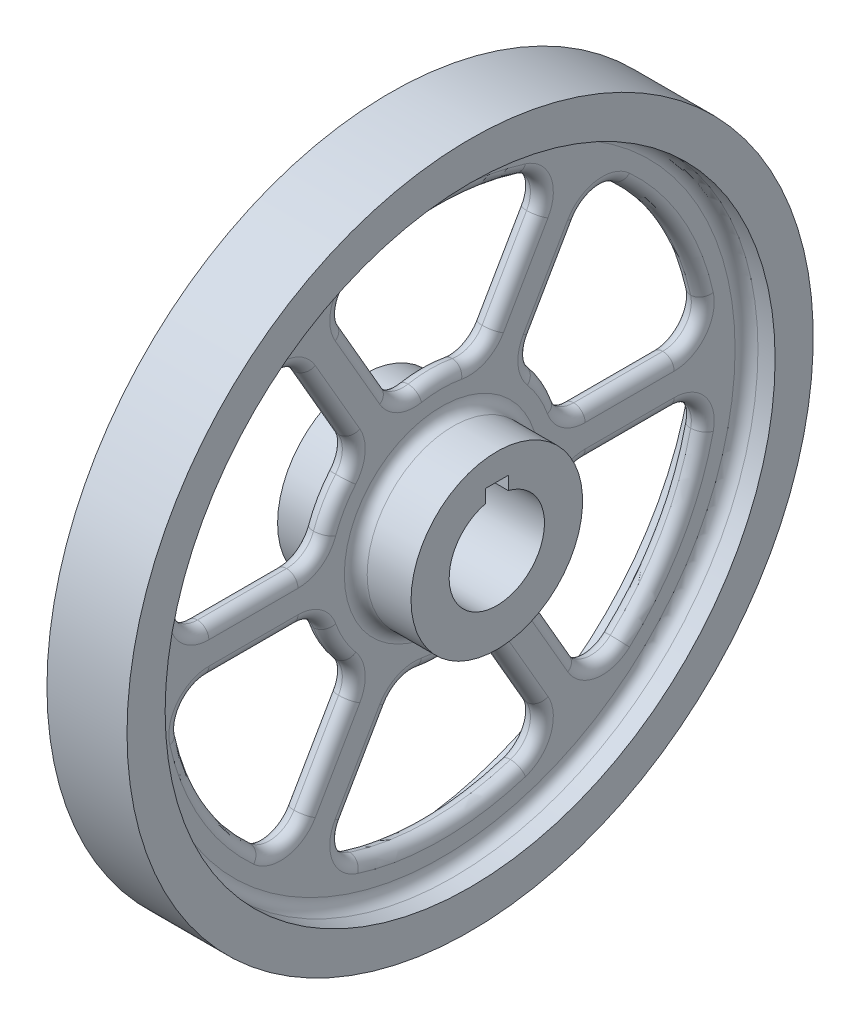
ISO-10303-21;
HEADER;
FILE_DESCRIPTION(('STEP AP214'),'2;1');
FILE_NAME('part.step','',(''),(''),'','','');
FILE_SCHEMA(('AUTOMOTIVE_DESIGN { 1 0 10303 214 1 1 1 1 }'));
ENDSEC;
DATA;
#1=APPLICATION_CONTEXT('core data for automotive mechanical design processes');
#2=APPLICATION_PROTOCOL_DEFINITION('international standard','automotive_design',2000,#1);
#3=PRODUCT_CONTEXT('',#1,'mechanical');
#4=PRODUCT('Part','Part','',(#3));
#5=PRODUCT_RELATED_PRODUCT_CATEGORY('part','',(#4));
#6=PRODUCT_DEFINITION_FORMATION('','',#4);
#7=PRODUCT_DEFINITION_CONTEXT('part definition',#1,'design');
#8=PRODUCT_DEFINITION('design','',#6,#7);
#9=PRODUCT_DEFINITION_SHAPE('','',#8);
#10=(LENGTH_UNIT() NAMED_UNIT(*) SI_UNIT(.MILLI.,.METRE.));
#11=(NAMED_UNIT(*) PLANE_ANGLE_UNIT() SI_UNIT($,.RADIAN.));
#12=(NAMED_UNIT(*) SI_UNIT($,.STERADIAN.) SOLID_ANGLE_UNIT());
#13=UNCERTAINTY_MEASURE_WITH_UNIT(LENGTH_MEASURE(1.E-05),#10,'distance_accuracy_value','');
#14=(GEOMETRIC_REPRESENTATION_CONTEXT(3) GLOBAL_UNCERTAINTY_ASSIGNED_CONTEXT((#13)) GLOBAL_UNIT_ASSIGNED_CONTEXT((#10,
#11,#12)) REPRESENTATION_CONTEXT('',''));
#15=CARTESIAN_POINT('',(0.,0.,0.));
#16=DIRECTION('',(0.,0.,1.));
#17=DIRECTION('',(1.,0.,0.));
#18=AXIS2_PLACEMENT_3D('',#15,#16,#17);
#19=CARTESIAN_POINT('',(-12.,0.,0.));
#20=DIRECTION('',(-1.,0.,0.));
#21=DIRECTION('',(0.,0.,1.));
#22=AXIS2_PLACEMENT_3D('',#19,#20,#21);
#23=TOROIDAL_SURFACE('',#22,154.,6.);
#24=CARTESIAN_POINT('',(-6.00000000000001,0.,0.));
#25=DIRECTION('',(-1.,0.,0.));
#26=DIRECTION('',(0.,0.,1.));
#27=AXIS2_PLACEMENT_3D('',#24,#25,#26);
#28=CIRCLE('',#27,154.);
#29=CARTESIAN_POINT('',(-6.00000000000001,0.,154.));
#30=VERTEX_POINT('',#29);
#31=EDGE_CURVE('E1005',#30,#30,#28,.T.);
#32=ORIENTED_EDGE('',*,*,#31,.F.);
#33=EDGE_LOOP('',(#32));
#34=FACE_BOUND('',#33,.T.);
#35=CARTESIAN_POINT('',(-12.,0.,0.));
#36=DIRECTION('',(-1.,0.,0.));
#37=DIRECTION('',(0.,0.,1.));
#38=AXIS2_PLACEMENT_3D('',#35,#36,#37);
#39=CIRCLE('',#38,160.);
#40=CARTESIAN_POINT('',(-12.,0.,160.));
#41=VERTEX_POINT('',#40);
#42=EDGE_CURVE('E960',#41,#41,#39,.T.);
#43=ORIENTED_EDGE('',*,*,#42,.T.);
#44=EDGE_LOOP('',(#43));
#45=FACE_BOUND('',#44,.T.);
#46=ADVANCED_FACE('F31',(#34,#45),#23,.F.);
#47=CARTESIAN_POINT('',(-6.00000000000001,51.,0.));
#48=DIRECTION('',(1.,0.,0.));
#49=DIRECTION('',(0.,0.,-1.));
#50=AXIS2_PLACEMENT_3D('',#47,#48,#49);
#51=PLANE('',#50);
#52=CARTESIAN_POINT('',(-6.00000000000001,92.1976820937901,-84.4072711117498));
#53=DIRECTION('',(1.,0.,0.));
#54=DIRECTION('',(0.,0.,-1.));
#55=AXIS2_PLACEMENT_3D('',#52,#53,#54);
#56=CIRCLE('',#55,21.);
#57=CARTESIAN_POINT('',(-6.00000000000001,107.686892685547,-98.5876926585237));
#58=VERTEX_POINT('',#57);
#59=CARTESIAN_POINT('',(-6.00000000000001,102.69768209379,-66.2207376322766));
#60=VERTEX_POINT('',#59);
#61=EDGE_CURVE('E51',#58,#60,#56,.T.);
#62=ORIENTED_EDGE('',*,*,#61,.T.);
#63=DIRECTION('',(0.,-0.866025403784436,0.500000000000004));
#64=VECTOR('',#63,1.);
#65=CARTESIAN_POINT('',(-6.00000000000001,35.2499999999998,-27.2798002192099));
#66=LINE('',#65,#64);
#67=CARTESIAN_POINT('',(-6.00000000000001,62.216945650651,-42.8491735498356));
#68=VERTEX_POINT('',#67);
#69=EDGE_CURVE('E11',#60,#68,#66,.T.);
#70=ORIENTED_EDGE('',*,*,#69,.T.);
#71=CARTESIAN_POINT('',(-6.00000000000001,51.7169456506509,-61.0357070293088));
#72=DIRECTION('',(1.,0.,0.));
#73=DIRECTION('',(0.,0.,-1.));
#74=AXIS2_PLACEMENT_3D('',#71,#72,#73);
#75=CIRCLE('',#74,21.);
#76=CARTESIAN_POINT('',(-6.00000000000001,38.1412474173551,-45.0138339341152));
#77=VERTEX_POINT('',#76);
#78=EDGE_CURVE('E38',#68,#77,#75,.T.);
#79=ORIENTED_EDGE('',*,*,#78,.T.);
#80=CARTESIAN_POINT('',(-6.00000000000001,0.,0.));
#81=DIRECTION('',(1.,0.,0.));
#82=DIRECTION('',(0.,0.,-1.));
#83=AXIS2_PLACEMENT_3D('',#80,#81,#82);
#84=CIRCLE('',#83,59.);
#85=CARTESIAN_POINT('',(-6.00000000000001,19.9125,-55.5382061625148));
#86=VERTEX_POINT('',#85);
#87=EDGE_CURVE('E1209',#77,#86,#84,.F.);
#88=ORIENTED_EDGE('',*,*,#87,.T.);
#89=CARTESIAN_POINT('',(-6.00000000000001,27.,-75.3060422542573));
#90=DIRECTION('',(1.,0.,0.));
#91=DIRECTION('',(0.,0.,-1.));
#92=AXIS2_PLACEMENT_3D('',#89,#90,#91);
#93=CIRCLE('',#92,21.);
#94=CARTESIAN_POINT('',(-6.00000000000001,6.00000000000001,-75.3060422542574));
#95=VERTEX_POINT('',#94);
#96=EDGE_CURVE('E1205',#86,#95,#93,.T.);
#97=ORIENTED_EDGE('',*,*,#96,.T.);
#98=DIRECTION('',(0.,0.,-1.));
#99=VECTOR('',#98,1.);
#100=CARTESIAN_POINT('',(-6.00000000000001,5.99999999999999,0.));
#101=LINE('',#100,#99);
#102=CARTESIAN_POINT('',(-6.00000000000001,6.00000000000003,-122.049170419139));
#103=VERTEX_POINT('',#102);
#104=EDGE_CURVE('E1201',#95,#103,#101,.T.);
#105=ORIENTED_EDGE('',*,*,#104,.T.);
#106=CARTESIAN_POINT('',(-6.00000000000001,27.,-122.049170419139));
#107=DIRECTION('',(1.,0.,0.));
#108=DIRECTION('',(0.,0.,-1.));
#109=AXIS2_PLACEMENT_3D('',#106,#107,#108);
#110=CIRCLE('',#109,21.);
#111=CARTESIAN_POINT('',(-6.00000000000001,31.536,-142.553431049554));
#112=VERTEX_POINT('',#111);
#113=EDGE_CURVE('E1203',#103,#112,#110,.T.);
#114=ORIENTED_EDGE('',*,*,#113,.T.);
#115=CARTESIAN_POINT('',(-6.00000000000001,0.,0.));
#116=DIRECTION('',(1.,0.,0.));
#117=DIRECTION('',(0.,0.,-1.));
#118=AXIS2_PLACEMENT_3D('',#115,#116,#117);
#119=CIRCLE('',#118,146.);
#120=EDGE_CURVE('E1207',#112,#58,#119,.T.);
#121=ORIENTED_EDGE('',*,*,#120,.T.);
#122=EDGE_LOOP('',(#62,#70,#79,#88,#97,#105,#114,#121));
#123=FACE_BOUND('',#122,.T.);
#124=CARTESIAN_POINT('',(-6.00000000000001,-27.0000000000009,-122.049170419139));
#125=DIRECTION('',(1.,0.,0.));
#126=DIRECTION('',(0.,0.,-1.));
#127=AXIS2_PLACEMENT_3D('',#124,#125,#126);
#128=CIRCLE('',#127,21.);
#129=CARTESIAN_POINT('',(-6.00000000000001,-31.5360000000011,-142.553431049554));
#130=VERTEX_POINT('',#129);
#131=CARTESIAN_POINT('',(-6.00000000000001,-6.00000000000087,-122.049170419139));
#132=VERTEX_POINT('',#131);
#133=EDGE_CURVE('E1194',#130,#132,#128,.T.);
#134=ORIENTED_EDGE('',*,*,#133,.T.);
#135=DIRECTION('',(0.,0.,1.));
#136=VECTOR('',#135,1.);
#137=CARTESIAN_POINT('',(-6.00000000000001,-6.00000000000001,4.0614213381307E-13));
#138=LINE('',#137,#136);
#139=CARTESIAN_POINT('',(-6.00000000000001,-6.00000000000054,-75.3060422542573));
#140=VERTEX_POINT('',#139);
#141=EDGE_CURVE('E1198',#132,#140,#138,.T.);
#142=ORIENTED_EDGE('',*,*,#141,.T.);
#143=CARTESIAN_POINT('',(-6.00000000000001,-27.0000000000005,-75.3060422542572));
#144=DIRECTION('',(1.,0.,0.));
#145=DIRECTION('',(0.,0.,-1.));
#146=AXIS2_PLACEMENT_3D('',#143,#144,#145);
#147=CIRCLE('',#146,21.);
#148=CARTESIAN_POINT('',(-6.00000000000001,-19.9125000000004,-55.5382061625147));
#149=VERTEX_POINT('',#148);
#150=EDGE_CURVE('E1196',#140,#149,#147,.T.);
#151=ORIENTED_EDGE('',*,*,#150,.T.);
#152=CARTESIAN_POINT('',(-6.00000000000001,0.,0.));
#153=DIRECTION('',(1.,0.,0.));
#154=DIRECTION('',(0.,0.,-1.));
#155=AXIS2_PLACEMENT_3D('',#152,#153,#154);
#156=CIRCLE('',#155,59.);
#157=CARTESIAN_POINT('',(-6.00000000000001,-38.1412474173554,-45.013833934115));
#158=VERTEX_POINT('',#157);
#159=EDGE_CURVE('E1192',#149,#158,#156,.F.);
#160=ORIENTED_EDGE('',*,*,#159,.T.);
#161=CARTESIAN_POINT('',(-6.00000000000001,-51.7169456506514,-61.0357070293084));
#162=DIRECTION('',(1.,0.,0.));
#163=DIRECTION('',(0.,0.,-1.));
#164=AXIS2_PLACEMENT_3D('',#161,#162,#163);
#165=CIRCLE('',#164,21.);
#166=CARTESIAN_POINT('',(-6.00000000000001,-62.2169456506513,-42.8491735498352));
#167=VERTEX_POINT('',#166);
#168=EDGE_CURVE('E1188',#158,#167,#165,.T.);
#169=ORIENTED_EDGE('',*,*,#168,.T.);
#170=DIRECTION('',(0.,-0.86602540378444,-0.499999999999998));
#171=VECTOR('',#170,1.);
#172=CARTESIAN_POINT('',(-6.00000000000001,41.2500000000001,16.8874953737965));
#173=LINE('',#172,#171);
#174=CARTESIAN_POINT('',(-6.00000000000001,-102.697682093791,-66.2207376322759));
#175=VERTEX_POINT('',#174);
#176=EDGE_CURVE('E1184',#167,#175,#173,.T.);
#177=ORIENTED_EDGE('',*,*,#176,.T.);
#178=CARTESIAN_POINT('',(-6.00000000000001,-92.1976820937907,-84.4072711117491));
#179=DIRECTION('',(1.,0.,0.));
#180=DIRECTION('',(0.,0.,-1.));
#181=AXIS2_PLACEMENT_3D('',#178,#179,#180);
#182=CIRCLE('',#181,21.);
#183=CARTESIAN_POINT('',(-6.00000000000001,-107.686892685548,-98.587692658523));
#184=VERTEX_POINT('',#183);
#185=EDGE_CURVE('E1186',#175,#184,#182,.T.);
#186=ORIENTED_EDGE('',*,*,#185,.T.);
#187=CARTESIAN_POINT('',(-6.00000000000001,0.,0.));
#188=DIRECTION('',(1.,0.,0.));
#189=DIRECTION('',(0.,0.,-1.));
#190=AXIS2_PLACEMENT_3D('',#187,#188,#189);
#191=CIRCLE('',#190,146.);
#192=EDGE_CURVE('E1190',#184,#130,#191,.T.);
#193=ORIENTED_EDGE('',*,*,#192,.T.);
#194=EDGE_LOOP('',(#134,#142,#151,#160,#169,#177,#186,#193));
#195=FACE_BOUND('',#194,.T.);
#196=CARTESIAN_POINT('',(-6.00000000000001,-78.7169456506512,14.2703352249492));
#197=DIRECTION('',(1.,0.,0.));
#198=DIRECTION('',(0.,0.,-1.));
#199=AXIS2_PLACEMENT_3D('',#196,#197,#198);
#200=CIRCLE('',#199,21.);
#201=CARTESIAN_POINT('',(-6.00000000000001,-58.0537474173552,10.5243722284));
#202=VERTEX_POINT('',#201);
#203=CARTESIAN_POINT('',(-6.00000000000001,-68.2169456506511,32.4568687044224));
#204=VERTEX_POINT('',#203);
#205=EDGE_CURVE('E1177',#202,#204,#200,.T.);
#206=ORIENTED_EDGE('',*,*,#205,.T.);
#207=DIRECTION('',(0.,-0.866025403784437,0.500000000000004));
#208=VECTOR('',#207,1.);
#209=CARTESIAN_POINT('',(-6.00000000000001,35.2499999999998,-27.2798002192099));
#210=LINE('',#209,#208);
#211=CARTESIAN_POINT('',(-6.00000000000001,-108.69768209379,55.8284327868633));
#212=VERTEX_POINT('',#211);
#213=EDGE_CURVE('E1181',#204,#212,#210,.T.);
#214=ORIENTED_EDGE('',*,*,#213,.T.);
#215=CARTESIAN_POINT('',(-6.00000000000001,-119.19768209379,37.6418993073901));
#216=DIRECTION('',(1.,0.,0.));
#217=DIRECTION('',(0.,0.,-1.));
#218=AXIS2_PLACEMENT_3D('',#215,#216,#217);
#219=CIRCLE('',#218,21.);
#220=CARTESIAN_POINT('',(-6.00000000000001,-139.222892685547,43.9657383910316));
#221=VERTEX_POINT('',#220);
#222=EDGE_CURVE('E1179',#212,#221,#219,.T.);
#223=ORIENTED_EDGE('',*,*,#222,.T.);
#224=CARTESIAN_POINT('',(-6.00000000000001,0.,0.));
#225=DIRECTION('',(1.,0.,0.));
#226=DIRECTION('',(0.,0.,-1.));
#227=AXIS2_PLACEMENT_3D('',#224,#225,#226);
#228=CIRCLE('',#227,146.);
#229=CARTESIAN_POINT('',(-6.00000000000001,-139.222892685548,-43.9657383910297));
#230=VERTEX_POINT('',#229);
#231=EDGE_CURVE('E1175',#221,#230,#228,.T.);
#232=ORIENTED_EDGE('',*,*,#231,.T.);
#233=CARTESIAN_POINT('',(-6.00000000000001,-119.197682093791,-37.6418993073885));
#234=DIRECTION('',(1.,0.,0.));
#235=DIRECTION('',(0.,0.,-1.));
#236=AXIS2_PLACEMENT_3D('',#233,#234,#235);
#237=CIRCLE('',#236,21.);
#238=CARTESIAN_POINT('',(-6.00000000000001,-108.697682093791,-55.8284327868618));
#239=VERTEX_POINT('',#238);
#240=EDGE_CURVE('E1171',#230,#239,#237,.T.);
#241=ORIENTED_EDGE('',*,*,#240,.T.);
#242=DIRECTION('',(0.,0.866025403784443,0.499999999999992));
#243=VECTOR('',#242,1.);
#244=CARTESIAN_POINT('',(-6.00000000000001,35.2500000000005,27.2798002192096));
#245=LINE('',#244,#243);
#246=CARTESIAN_POINT('',(-6.00000000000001,-68.2169456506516,-32.4568687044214));
#247=VERTEX_POINT('',#246);
#248=EDGE_CURVE('E1167',#239,#247,#245,.T.);
#249=ORIENTED_EDGE('',*,*,#248,.T.);
#250=CARTESIAN_POINT('',(-6.00000000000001,-78.7169456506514,-14.2703352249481));
#251=DIRECTION('',(1.,0.,0.));
#252=DIRECTION('',(0.,0.,-1.));
#253=AXIS2_PLACEMENT_3D('',#250,#251,#252);
#254=CIRCLE('',#253,21.);
#255=CARTESIAN_POINT('',(-6.00000000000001,-58.0537474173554,-10.5243722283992));
#256=VERTEX_POINT('',#255);
#257=EDGE_CURVE('E1169',#247,#256,#254,.T.);
#258=ORIENTED_EDGE('',*,*,#257,.T.);
#259=CARTESIAN_POINT('',(-6.00000000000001,0.,0.));
#260=DIRECTION('',(1.,0.,0.));
#261=DIRECTION('',(0.,0.,-1.));
#262=AXIS2_PLACEMENT_3D('',#259,#260,#261);
#263=CIRCLE('',#262,59.);
#264=EDGE_CURVE('E1173',#256,#202,#263,.F.);
#265=ORIENTED_EDGE('',*,*,#264,.T.);
#266=EDGE_LOOP('',(#206,#214,#223,#232,#241,#249,#258,#265));
#267=FACE_BOUND('',#266,.T.);
#268=CARTESIAN_POINT('',(-6.00000000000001,-51.7169456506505,61.0357070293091));
#269=DIRECTION('',(1.,0.,0.));
#270=DIRECTION('',(0.,0.,-1.));
#271=AXIS2_PLACEMENT_3D('',#268,#269,#270);
#272=CIRCLE('',#271,21.);
#273=CARTESIAN_POINT('',(-6.00000000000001,-62.2169456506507,42.849173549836));
#274=VERTEX_POINT('',#273);
#275=CARTESIAN_POINT('',(-6.00000000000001,-38.1412474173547,45.0138339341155));
#276=VERTEX_POINT('',#275);
#277=EDGE_CURVE('E1160',#274,#276,#272,.T.);
#278=ORIENTED_EDGE('',*,*,#277,.T.);
#279=CARTESIAN_POINT('',(-6.00000000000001,0.,0.));
#280=DIRECTION('',(1.,0.,0.));
#281=DIRECTION('',(0.,0.,-1.));
#282=AXIS2_PLACEMENT_3D('',#279,#280,#281);
#283=CIRCLE('',#282,59.);
#284=CARTESIAN_POINT('',(-6.00000000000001,-19.9124999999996,55.5382061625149));
#285=VERTEX_POINT('',#284);
#286=EDGE_CURVE('E1164',#276,#285,#283,.F.);
#287=ORIENTED_EDGE('',*,*,#286,.T.);
#288=CARTESIAN_POINT('',(-6.00000000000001,-26.9999999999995,75.3060422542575));
#289=DIRECTION('',(1.,0.,0.));
#290=DIRECTION('',(0.,0.,-1.));
#291=AXIS2_PLACEMENT_3D('',#288,#289,#290);
#292=CIRCLE('',#291,21.);
#293=CARTESIAN_POINT('',(-6.00000000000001,-5.99999999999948,75.3060422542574));
#294=VERTEX_POINT('',#293);
#295=EDGE_CURVE('E1162',#285,#294,#292,.T.);
#296=ORIENTED_EDGE('',*,*,#295,.T.);
#297=DIRECTION('',(0.,0.,1.));
#298=VECTOR('',#297,1.);
#299=CARTESIAN_POINT('',(-6.00000000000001,-5.99999999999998,3.80771802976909E-13));
#300=LINE('',#299,#298);
#301=CARTESIAN_POINT('',(-6.00000000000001,-5.99999999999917,122.049170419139));
#302=VERTEX_POINT('',#301);
#303=EDGE_CURVE('E1158',#294,#302,#300,.T.);
#304=ORIENTED_EDGE('',*,*,#303,.T.);
#305=CARTESIAN_POINT('',(-6.00000000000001,-26.9999999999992,122.049170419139));
#306=DIRECTION('',(1.,0.,0.));
#307=DIRECTION('',(0.,0.,-1.));
#308=AXIS2_PLACEMENT_3D('',#305,#306,#307);
#309=CIRCLE('',#308,21.);
#310=CARTESIAN_POINT('',(-6.00000000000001,-31.5359999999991,142.553431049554));
#311=VERTEX_POINT('',#310);
#312=EDGE_CURVE('E1154',#302,#311,#309,.T.);
#313=ORIENTED_EDGE('',*,*,#312,.T.);
#314=CARTESIAN_POINT('',(-6.00000000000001,0.,0.));
#315=DIRECTION('',(1.,0.,0.));
#316=DIRECTION('',(0.,0.,-1.));
#317=AXIS2_PLACEMENT_3D('',#314,#315,#316);
#318=CIRCLE('',#317,146.);
#319=CARTESIAN_POINT('',(-6.00000000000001,-107.686892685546,98.5876926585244));
#320=VERTEX_POINT('',#319);
#321=EDGE_CURVE('E1150',#311,#320,#318,.T.);
#322=ORIENTED_EDGE('',*,*,#321,.T.);
#323=CARTESIAN_POINT('',(-6.00000000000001,-92.1976820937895,84.4072711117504));
#324=DIRECTION('',(1.,0.,0.));
#325=DIRECTION('',(0.,0.,-1.));
#326=AXIS2_PLACEMENT_3D('',#323,#324,#325);
#327=CIRCLE('',#326,21.);
#328=CARTESIAN_POINT('',(-6.00000000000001,-102.69768209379,66.2207376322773));
#329=VERTEX_POINT('',#328);
#330=EDGE_CURVE('E1152',#320,#329,#327,.T.);
#331=ORIENTED_EDGE('',*,*,#330,.T.);
#332=DIRECTION('',(0.,0.866025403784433,-0.50000000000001));
#333=VECTOR('',#332,1.);
#334=CARTESIAN_POINT('',(-6.00000000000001,41.2499999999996,-16.8874953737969));
#335=LINE('',#334,#333);
#336=EDGE_CURVE('E1156',#329,#274,#335,.T.);
#337=ORIENTED_EDGE('',*,*,#336,.T.);
#338=EDGE_LOOP('',(#278,#287,#296,#304,#313,#322,#331,#337));
#339=FACE_BOUND('',#338,.T.);
#340=CARTESIAN_POINT('',(-6.00000000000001,27.0000000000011,75.306042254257));
#341=DIRECTION('',(1.,0.,0.));
#342=DIRECTION('',(0.,0.,-1.));
#343=AXIS2_PLACEMENT_3D('',#340,#341,#342);
#344=CIRCLE('',#343,21.);
#345=CARTESIAN_POINT('',(-6.00000000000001,6.00000000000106,75.3060422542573));
#346=VERTEX_POINT('',#345);
#347=CARTESIAN_POINT('',(-6.00000000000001,19.9125000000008,55.5382061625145));
#348=VERTEX_POINT('',#347);
#349=EDGE_CURVE('E1143',#346,#348,#344,.T.);
#350=ORIENTED_EDGE('',*,*,#349,.T.);
#351=CARTESIAN_POINT('',(-6.00000000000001,0.,0.));
#352=DIRECTION('',(1.,0.,0.));
#353=DIRECTION('',(0.,0.,-1.));
#354=AXIS2_PLACEMENT_3D('',#351,#352,#353);
#355=CIRCLE('',#354,59.);
#356=CARTESIAN_POINT('',(-6.00000000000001,38.1412474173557,45.0138339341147));
#357=VERTEX_POINT('',#356);
#358=EDGE_CURVE('E1147',#348,#357,#355,.F.);
#359=ORIENTED_EDGE('',*,*,#358,.T.);
#360=CARTESIAN_POINT('',(-6.00000000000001,51.7169456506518,61.035707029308));
#361=DIRECTION('',(1.,0.,0.));
#362=DIRECTION('',(0.,0.,-1.));
#363=AXIS2_PLACEMENT_3D('',#360,#361,#362);
#364=CIRCLE('',#363,21.);
#365=CARTESIAN_POINT('',(-6.00000000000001,62.2169456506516,42.8491735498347));
#366=VERTEX_POINT('',#365);
#367=EDGE_CURVE('E1145',#357,#366,#364,.T.);
#368=ORIENTED_EDGE('',*,*,#367,.T.);
#369=DIRECTION('',(0.,0.866025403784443,0.499999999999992));
#370=VECTOR('',#369,1.);
#371=CARTESIAN_POINT('',(-6.00000000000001,35.2500000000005,27.2798002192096));
#372=LINE('',#371,#370);
#373=CARTESIAN_POINT('',(-6.00000000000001,102.697682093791,66.2207376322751));
#374=VERTEX_POINT('',#373);
#375=EDGE_CURVE('E1141',#366,#374,#372,.T.);
#376=ORIENTED_EDGE('',*,*,#375,.T.);
#377=CARTESIAN_POINT('',(-6.00000000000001,92.1976820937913,84.4072711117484));
#378=DIRECTION('',(1.,0.,0.));
#379=DIRECTION('',(0.,0.,-1.));
#380=AXIS2_PLACEMENT_3D('',#377,#378,#379);
#381=CIRCLE('',#380,21.);
#382=CARTESIAN_POINT('',(-6.00000000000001,107.686892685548,98.5876926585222));
#383=VERTEX_POINT('',#382);
#384=EDGE_CURVE('E1137',#374,#383,#381,.T.);
#385=ORIENTED_EDGE('',*,*,#384,.T.);
#386=CARTESIAN_POINT('',(-6.00000000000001,0.,0.));
#387=DIRECTION('',(1.,0.,0.));
#388=DIRECTION('',(0.,0.,-1.));
#389=AXIS2_PLACEMENT_3D('',#386,#387,#388);
#390=CIRCLE('',#389,146.);
#391=CARTESIAN_POINT('',(-6.00000000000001,31.536000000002,142.553431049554));
#392=VERTEX_POINT('',#391);
#393=EDGE_CURVE('E1133',#383,#392,#390,.T.);
#394=ORIENTED_EDGE('',*,*,#393,.T.);
#395=CARTESIAN_POINT('',(-6.00000000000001,27.0000000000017,122.049170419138));
#396=DIRECTION('',(1.,0.,0.));
#397=DIRECTION('',(0.,0.,-1.));
#398=AXIS2_PLACEMENT_3D('',#395,#396,#397);
#399=CIRCLE('',#398,21.);
#400=CARTESIAN_POINT('',(-6.00000000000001,6.00000000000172,122.049170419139));
#401=VERTEX_POINT('',#400);
#402=EDGE_CURVE('E1135',#392,#401,#399,.T.);
#403=ORIENTED_EDGE('',*,*,#402,.T.);
#404=DIRECTION('',(0.,0.,-1.));
#405=VECTOR('',#404,1.);
#406=CARTESIAN_POINT('',(-6.00000000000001,5.99999999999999,6.41305585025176E-13));
#407=LINE('',#406,#405);
#408=EDGE_CURVE('E1139',#401,#346,#407,.T.);
#409=ORIENTED_EDGE('',*,*,#408,.T.);
#410=EDGE_LOOP('',(#350,#359,#368,#376,#385,#394,#403,#409));
#411=FACE_BOUND('',#410,.T.);
#412=CARTESIAN_POINT('',(-6.00000000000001,119.197682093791,37.6418993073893));
#413=DIRECTION('',(1.,0.,0.));
#414=DIRECTION('',(0.,0.,-1.));
#415=AXIS2_PLACEMENT_3D('',#412,#413,#414);
#416=CIRCLE('',#415,21.);
#417=CARTESIAN_POINT('',(-6.00000000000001,139.222892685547,43.9657383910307));
#418=VERTEX_POINT('',#417);
#419=CARTESIAN_POINT('',(-6.00000000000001,108.697682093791,55.8284327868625));
#420=VERTEX_POINT('',#419);
#421=EDGE_CURVE('E1128',#418,#420,#416,.T.);
#422=ORIENTED_EDGE('',*,*,#421,.T.);
#423=DIRECTION('',(0.,-0.86602540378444,-0.499999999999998));
#424=VECTOR('',#423,1.);
#425=CARTESIAN_POINT('',(-6.00000000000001,41.2500000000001,16.8874953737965));
#426=LINE('',#425,#424);
#427=CARTESIAN_POINT('',(-6.00000000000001,68.2169456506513,32.4568687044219));
#428=VERTEX_POINT('',#427);
#429=EDGE_CURVE('E537',#420,#428,#426,.T.);
#430=ORIENTED_EDGE('',*,*,#429,.T.);
#431=CARTESIAN_POINT('',(-6.00000000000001,78.7169456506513,14.2703352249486));
#432=DIRECTION('',(1.,0.,0.));
#433=DIRECTION('',(0.,0.,-1.));
#434=AXIS2_PLACEMENT_3D('',#431,#432,#433);
#435=CIRCLE('',#434,21.);
#436=CARTESIAN_POINT('',(-6.00000000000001,58.0537474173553,10.5243722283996));
#437=VERTEX_POINT('',#436);
#438=EDGE_CURVE('E1130',#428,#437,#435,.T.);
#439=ORIENTED_EDGE('',*,*,#438,.T.);
#440=CARTESIAN_POINT('',(-6.00000000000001,0.,0.));
#441=DIRECTION('',(1.,0.,0.));
#442=DIRECTION('',(0.,0.,-1.));
#443=AXIS2_PLACEMENT_3D('',#440,#441,#442);
#444=CIRCLE('',#443,59.);
#445=CARTESIAN_POINT('',(-6.00000000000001,58.0537474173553,-10.5243722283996));
#446=VERTEX_POINT('',#445);
#447=EDGE_CURVE('E1126',#437,#446,#444,.F.);
#448=ORIENTED_EDGE('',*,*,#447,.T.);
#449=CARTESIAN_POINT('',(-6.00000000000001,78.7169456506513,-14.2703352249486));
#450=DIRECTION('',(1.,0.,0.));
#451=DIRECTION('',(0.,0.,-1.));
#452=AXIS2_PLACEMENT_3D('',#449,#450,#451);
#453=CIRCLE('',#452,21.);
#454=CARTESIAN_POINT('',(-6.00000000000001,68.2169456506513,-32.4568687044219));
#455=VERTEX_POINT('',#454);
#456=EDGE_CURVE('E1122',#446,#455,#453,.T.);
#457=ORIENTED_EDGE('',*,*,#456,.T.);
#458=DIRECTION('',(0.,0.86602540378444,-0.499999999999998));
#459=VECTOR('',#458,1.);
#460=CARTESIAN_POINT('',(-6.00000000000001,41.2500000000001,-16.8874953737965));
#461=LINE('',#460,#459);
#462=CARTESIAN_POINT('',(-6.00000000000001,108.697682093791,-55.8284327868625));
#463=VERTEX_POINT('',#462);
#464=EDGE_CURVE('E1118',#455,#463,#461,.T.);
#465=ORIENTED_EDGE('',*,*,#464,.T.);
#466=CARTESIAN_POINT('',(-6.00000000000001,119.197682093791,-37.6418993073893));
#467=DIRECTION('',(1.,0.,0.));
#468=DIRECTION('',(0.,0.,-1.));
#469=AXIS2_PLACEMENT_3D('',#466,#467,#468);
#470=CIRCLE('',#469,21.);
#471=CARTESIAN_POINT('',(-6.00000000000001,139.222892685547,-43.9657383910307));
#472=VERTEX_POINT('',#471);
#473=EDGE_CURVE('E1120',#463,#472,#470,.T.);
#474=ORIENTED_EDGE('',*,*,#473,.T.);
#475=CARTESIAN_POINT('',(-6.00000000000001,0.,0.));
#476=DIRECTION('',(1.,0.,0.));
#477=DIRECTION('',(0.,0.,-1.));
#478=AXIS2_PLACEMENT_3D('',#475,#476,#477);
#479=CIRCLE('',#478,146.);
#480=EDGE_CURVE('E1124',#472,#418,#479,.T.);
#481=ORIENTED_EDGE('',*,*,#480,.T.);
#482=EDGE_LOOP('',(#422,#430,#439,#448,#457,#465,#474,#481));
#483=FACE_BOUND('',#482,.T.);
#484=CARTESIAN_POINT('',(-6.00000000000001,0.,0.));
#485=DIRECTION('',(-1.,0.,0.));
#486=DIRECTION('',(0.,0.,1.));
#487=AXIS2_PLACEMENT_3D('',#484,#485,#486);
#488=CIRCLE('',#487,51.);
#489=CARTESIAN_POINT('',(-6.00000000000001,0.,51.));
#490=VERTEX_POINT('',#489);
#491=EDGE_CURVE('E1002',#490,#490,#488,.T.);
#492=ORIENTED_EDGE('',*,*,#491,.F.);
#493=EDGE_LOOP('',(#492));
#494=FACE_BOUND('',#493,.T.);
#495=ORIENTED_EDGE('',*,*,#31,.T.);
#496=EDGE_LOOP('',(#495));
#497=FACE_BOUND('',#496,.T.);
#498=ADVANCED_FACE('F1211',(#123,#195,#267,#339,#411,#483,#494,#497),#51,.F.);
#499=CARTESIAN_POINT('',(-12.,0.,0.));
#500=DIRECTION('',(-1.,0.,0.));
#501=DIRECTION('',(0.,0.,1.));
#502=AXIS2_PLACEMENT_3D('',#499,#500,#501);
#503=TOROIDAL_SURFACE('',#502,51.,6.);
#504=CARTESIAN_POINT('',(-12.,0.,0.));
#505=DIRECTION('',(-1.,0.,0.));
#506=DIRECTION('',(0.,0.,1.));
#507=AXIS2_PLACEMENT_3D('',#504,#505,#506);
#508=CIRCLE('',#507,45.);
#509=CARTESIAN_POINT('',(-12.,0.,45.));
#510=VERTEX_POINT('',#509);
#511=EDGE_CURVE('E999',#510,#510,#508,.T.);
#512=ORIENTED_EDGE('',*,*,#511,.F.);
#513=EDGE_LOOP('',(#512));
#514=FACE_BOUND('',#513,.T.);
#515=ORIENTED_EDGE('',*,*,#491,.T.);
#516=EDGE_LOOP('',(#515));
#517=FACE_BOUND('',#516,.T.);
#518=ADVANCED_FACE('F1288',(#514,#517),#503,.F.);
#519=CARTESIAN_POINT('',(-43.7948412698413,0.,0.));
#520=DIRECTION('',(-1.,0.,0.));
#521=DIRECTION('',(0.,0.,1.));
#522=AXIS2_PLACEMENT_3D('',#519,#520,#521);
#523=CYLINDRICAL_SURFACE('',#522,45.);
#524=CARTESIAN_POINT('',(-35.,0.,0.));
#525=DIRECTION('',(-1.,0.,0.));
#526=DIRECTION('',(0.,0.,1.));
#527=AXIS2_PLACEMENT_3D('',#524,#525,#526);
#528=CIRCLE('',#527,45.);
#529=CARTESIAN_POINT('',(-35.,0.,45.));
#530=VERTEX_POINT('',#529);
#531=EDGE_CURVE('E996',#530,#530,#528,.T.);
#532=ORIENTED_EDGE('',*,*,#531,.F.);
#533=EDGE_LOOP('',(#532));
#534=FACE_BOUND('',#533,.T.);
#535=ORIENTED_EDGE('',*,*,#511,.T.);
#536=EDGE_LOOP('',(#535));
#537=FACE_BOUND('',#536,.T.);
#538=ADVANCED_FACE('F1385',(#534,#537),#523,.T.);
#539=CARTESIAN_POINT('',(-35.,25.,0.));
#540=DIRECTION('',(1.,0.,0.));
#541=DIRECTION('',(0.,0.,-1.));
#542=AXIS2_PLACEMENT_3D('',#539,#540,#541);
#543=PLANE('',#542);
#544=CARTESIAN_POINT('',(-35.,0.,0.));
#545=DIRECTION('',(-1.,0.,0.));
#546=DIRECTION('',(0.,0.,1.));
#547=AXIS2_PLACEMENT_3D('',#544,#545,#546);
#548=CIRCLE('',#547,25.);
#549=CARTESIAN_POINT('',(-35.,24.2693221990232,-6.));
#550=VERTEX_POINT('',#549);
#551=CARTESIAN_POINT('',(-35.,24.2693221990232,6.));
#552=VERTEX_POINT('',#551);
#553=EDGE_CURVE('E993',#550,#552,#548,.T.);
#554=ORIENTED_EDGE('',*,*,#553,.F.);
#555=DIRECTION('',(0.,1.,0.));
#556=VECTOR('',#555,1.);
#557=CARTESIAN_POINT('',(-35.,25.,-6.));
#558=LINE('',#557,#556);
#559=CARTESIAN_POINT('',(-35.,31.2,-6.));
#560=VERTEX_POINT('',#559);
#561=EDGE_CURVE('E954',#550,#560,#558,.T.);
#562=ORIENTED_EDGE('',*,*,#561,.T.);
#563=DIRECTION('',(0.,0.,1.));
#564=VECTOR('',#563,1.);
#565=CARTESIAN_POINT('',(-35.,31.2,0.));
#566=LINE('',#565,#564);
#567=CARTESIAN_POINT('',(-35.,31.2,6.));
#568=VERTEX_POINT('',#567);
#569=EDGE_CURVE('E957',#560,#568,#566,.T.);
#570=ORIENTED_EDGE('',*,*,#569,.T.);
#571=DIRECTION('',(0.,-1.,0.));
#572=VECTOR('',#571,1.);
#573=CARTESIAN_POINT('',(-35.,25.,6.));
#574=LINE('',#573,#572);
#575=EDGE_CURVE('E948',#568,#552,#574,.T.);
#576=ORIENTED_EDGE('',*,*,#575,.T.);
#577=EDGE_LOOP('',(#554,#562,#570,#576));
#578=FACE_BOUND('',#577,.T.);
#579=ORIENTED_EDGE('',*,*,#531,.T.);
#580=EDGE_LOOP('',(#579));
#581=FACE_BOUND('',#580,.T.);
#582=ADVANCED_FACE('F1362',(#578,#581),#543,.F.);
#583=CARTESIAN_POINT('',(-43.7948412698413,0.,0.));
#584=DIRECTION('',(-1.,0.,0.));
#585=DIRECTION('',(0.,0.,1.));
#586=AXIS2_PLACEMENT_3D('',#583,#584,#585);
#587=CYLINDRICAL_SURFACE('',#586,25.);
#588=CARTESIAN_POINT('',(35.,0.,0.));
#589=DIRECTION('',(-1.,0.,0.));
#590=DIRECTION('',(0.,0.,1.));
#591=AXIS2_PLACEMENT_3D('',#588,#589,#590);
#592=CIRCLE('',#591,25.);
#593=CARTESIAN_POINT('',(35.,24.2693221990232,-6.));
#594=VERTEX_POINT('',#593);
#595=CARTESIAN_POINT('',(35.,24.2693221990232,6.));
#596=VERTEX_POINT('',#595);
#597=EDGE_CURVE('E990',#594,#596,#592,.T.);
#598=ORIENTED_EDGE('',*,*,#597,.F.);
#599=DIRECTION('',(-1.,0.,0.));
#600=VECTOR('',#599,1.);
#601=CARTESIAN_POINT('',(-43.7948412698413,24.2693221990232,-6.));
#602=LINE('',#601,#600);
#603=EDGE_CURVE('E951',#594,#550,#602,.T.);
#604=ORIENTED_EDGE('',*,*,#603,.T.);
#605=ORIENTED_EDGE('',*,*,#553,.T.);
#606=DIRECTION('',(-1.,0.,0.));
#607=VECTOR('',#606,1.);
#608=CARTESIAN_POINT('',(-43.7948412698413,24.2693221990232,6.));
#609=LINE('',#608,#607);
#610=EDGE_CURVE('E944',#552,#596,#609,.F.);
#611=ORIENTED_EDGE('',*,*,#610,.T.);
#612=EDGE_LOOP('',(#598,#604,#605,#611));
#613=FACE_BOUND('',#612,.T.);
#614=ADVANCED_FACE('F1351',(#613),#587,.F.);
#615=CARTESIAN_POINT('',(35.,25.,0.));
#616=DIRECTION('',(-1.,0.,0.));
#617=DIRECTION('',(0.,0.,1.));
#618=AXIS2_PLACEMENT_3D('',#615,#616,#617);
#619=PLANE('',#618);
#620=CARTESIAN_POINT('',(35.,0.,0.));
#621=DIRECTION('',(-1.,0.,0.));
#622=DIRECTION('',(0.,0.,1.));
#623=AXIS2_PLACEMENT_3D('',#620,#621,#622);
#624=CIRCLE('',#623,45.);
#625=CARTESIAN_POINT('',(35.,0.,45.));
#626=VERTEX_POINT('',#625);
#627=EDGE_CURVE('E987',#626,#626,#624,.T.);
#628=ORIENTED_EDGE('',*,*,#627,.F.);
#629=EDGE_LOOP('',(#628));
#630=FACE_BOUND('',#629,.T.);
#631=DIRECTION('',(0.,0.,-1.));
#632=VECTOR('',#631,1.);
#633=CARTESIAN_POINT('',(35.,31.2,0.));
#634=LINE('',#633,#632);
#635=CARTESIAN_POINT('',(35.,31.2,6.));
#636=VERTEX_POINT('',#635);
#637=CARTESIAN_POINT('',(35.,31.2,-6.));
#638=VERTEX_POINT('',#637);
#639=EDGE_CURVE('E1011',#636,#638,#634,.T.);
#640=ORIENTED_EDGE('',*,*,#639,.T.);
#641=DIRECTION('',(0.,-1.,0.));
#642=VECTOR('',#641,1.);
#643=CARTESIAN_POINT('',(35.,25.,-6.));
#644=LINE('',#643,#642);
#645=EDGE_CURVE('E1014',#638,#594,#644,.T.);
#646=ORIENTED_EDGE('',*,*,#645,.T.);
#647=ORIENTED_EDGE('',*,*,#597,.T.);
#648=DIRECTION('',(0.,1.,0.));
#649=VECTOR('',#648,1.);
#650=CARTESIAN_POINT('',(35.,25.,6.));
#651=LINE('',#650,#649);
#652=EDGE_CURVE('E1008',#596,#636,#651,.T.);
#653=ORIENTED_EDGE('',*,*,#652,.T.);
#654=EDGE_LOOP('',(#640,#646,#647,#653));
#655=FACE_BOUND('',#654,.T.);
#656=ADVANCED_FACE('F1345',(#630,#655),#619,.F.);
#657=CARTESIAN_POINT('',(-43.7948412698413,0.,0.));
#658=DIRECTION('',(-1.,0.,0.));
#659=DIRECTION('',(0.,0.,1.));
#660=AXIS2_PLACEMENT_3D('',#657,#658,#659);
#661=CYLINDRICAL_SURFACE('',#660,45.);
#662=CARTESIAN_POINT('',(12.,0.,0.));
#663=DIRECTION('',(-1.,0.,0.));
#664=DIRECTION('',(0.,0.,1.));
#665=AXIS2_PLACEMENT_3D('',#662,#663,#664);
#666=CIRCLE('',#665,45.);
#667=CARTESIAN_POINT('',(12.,0.,45.));
#668=VERTEX_POINT('',#667);
#669=EDGE_CURVE('E984',#668,#668,#666,.T.);
#670=ORIENTED_EDGE('',*,*,#669,.F.);
#671=EDGE_LOOP('',(#670));
#672=FACE_BOUND('',#671,.T.);
#673=ORIENTED_EDGE('',*,*,#627,.T.);
#674=EDGE_LOOP('',(#673));
#675=FACE_BOUND('',#674,.T.);
#676=ADVANCED_FACE('F1339',(#672,#675),#661,.T.);
#677=CARTESIAN_POINT('',(12.,0.,0.));
#678=DIRECTION('',(-1.,0.,0.));
#679=DIRECTION('',(0.,0.,1.));
#680=AXIS2_PLACEMENT_3D('',#677,#678,#679);
#681=TOROIDAL_SURFACE('',#680,51.,6.);
#682=CARTESIAN_POINT('',(6.00000000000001,0.,0.));
#683=DIRECTION('',(-1.,0.,0.));
#684=DIRECTION('',(0.,0.,1.));
#685=AXIS2_PLACEMENT_3D('',#682,#683,#684);
#686=CIRCLE('',#685,51.);
#687=CARTESIAN_POINT('',(6.00000000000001,0.,51.));
#688=VERTEX_POINT('',#687);
#689=EDGE_CURVE('E981',#688,#688,#686,.T.);
#690=ORIENTED_EDGE('',*,*,#689,.F.);
#691=EDGE_LOOP('',(#690));
#692=FACE_BOUND('',#691,.T.);
#693=ORIENTED_EDGE('',*,*,#669,.T.);
#694=EDGE_LOOP('',(#693));
#695=FACE_BOUND('',#694,.T.);
#696=ADVANCED_FACE('F1332',(#692,#695),#681,.F.);
#697=CARTESIAN_POINT('',(6.00000000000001,51.,0.));
#698=DIRECTION('',(-1.,0.,0.));
#699=DIRECTION('',(0.,0.,1.));
#700=AXIS2_PLACEMENT_3D('',#697,#698,#699);
#701=PLANE('',#700);
#702=CARTESIAN_POINT('',(6.00000000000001,92.1976820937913,84.4072711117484));
#703=DIRECTION('',(-1.,0.,0.));
#704=DIRECTION('',(0.,0.,1.));
#705=AXIS2_PLACEMENT_3D('',#702,#703,#704);
#706=CIRCLE('',#705,21.);
#707=CARTESIAN_POINT('',(6.00000000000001,107.686892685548,98.5876926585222));
#708=VERTEX_POINT('',#707);
#709=CARTESIAN_POINT('',(6.00000000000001,102.697682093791,66.2207376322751));
#710=VERTEX_POINT('',#709);
#711=EDGE_CURVE('E1111',#708,#710,#706,.T.);
#712=ORIENTED_EDGE('',*,*,#711,.T.);
#713=DIRECTION('',(0.,-0.866025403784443,-0.499999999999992));
#714=VECTOR('',#713,1.);
#715=CARTESIAN_POINT('',(6.00000000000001,35.2500000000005,27.2798002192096));
#716=LINE('',#715,#714);
#717=CARTESIAN_POINT('',(6.00000000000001,62.2169456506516,42.8491735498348));
#718=VERTEX_POINT('',#717);
#719=EDGE_CURVE('E1115',#710,#718,#716,.T.);
#720=ORIENTED_EDGE('',*,*,#719,.T.);
#721=CARTESIAN_POINT('',(6.00000000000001,51.7169456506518,61.035707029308));
#722=DIRECTION('',(-1.,0.,0.));
#723=DIRECTION('',(0.,0.,1.));
#724=AXIS2_PLACEMENT_3D('',#721,#722,#723);
#725=CIRCLE('',#724,21.);
#726=CARTESIAN_POINT('',(6.00000000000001,38.1412474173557,45.0138339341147));
#727=VERTEX_POINT('',#726);
#728=EDGE_CURVE('E1113',#718,#727,#725,.T.);
#729=ORIENTED_EDGE('',*,*,#728,.T.);
#730=CARTESIAN_POINT('',(6.00000000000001,0.,0.));
#731=DIRECTION('',(-1.,0.,0.));
#732=DIRECTION('',(0.,0.,1.));
#733=AXIS2_PLACEMENT_3D('',#730,#731,#732);
#734=CIRCLE('',#733,59.);
#735=CARTESIAN_POINT('',(6.00000000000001,19.9125000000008,55.5382061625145));
#736=VERTEX_POINT('',#735);
#737=EDGE_CURVE('E1109',#727,#736,#734,.F.);
#738=ORIENTED_EDGE('',*,*,#737,.T.);
#739=CARTESIAN_POINT('',(6.00000000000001,27.0000000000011,75.306042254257));
#740=DIRECTION('',(-1.,0.,0.));
#741=DIRECTION('',(0.,0.,1.));
#742=AXIS2_PLACEMENT_3D('',#739,#740,#741);
#743=CIRCLE('',#742,21.);
#744=CARTESIAN_POINT('',(6.00000000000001,6.00000000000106,75.3060422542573));
#745=VERTEX_POINT('',#744);
#746=EDGE_CURVE('E1105',#736,#745,#743,.T.);
#747=ORIENTED_EDGE('',*,*,#746,.T.);
#748=DIRECTION('',(0.,0.,1.));
#749=VECTOR('',#748,1.);
#750=CARTESIAN_POINT('',(6.00000000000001,5.99999999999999,6.41305585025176E-13));
#751=LINE('',#750,#749);
#752=CARTESIAN_POINT('',(6.00000000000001,6.00000000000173,122.049170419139));
#753=VERTEX_POINT('',#752);
#754=EDGE_CURVE('E1101',#745,#753,#751,.T.);
#755=ORIENTED_EDGE('',*,*,#754,.T.);
#756=CARTESIAN_POINT('',(6.00000000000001,27.0000000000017,122.049170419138));
#757=DIRECTION('',(-1.,0.,0.));
#758=DIRECTION('',(0.,0.,1.));
#759=AXIS2_PLACEMENT_3D('',#756,#757,#758);
#760=CIRCLE('',#759,21.);
#761=CARTESIAN_POINT('',(6.00000000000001,31.536000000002,142.553431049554));
#762=VERTEX_POINT('',#761);
#763=EDGE_CURVE('E1103',#753,#762,#760,.T.);
#764=ORIENTED_EDGE('',*,*,#763,.T.);
#765=CARTESIAN_POINT('',(6.00000000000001,0.,0.));
#766=DIRECTION('',(-1.,0.,0.));
#767=DIRECTION('',(0.,0.,1.));
#768=AXIS2_PLACEMENT_3D('',#765,#766,#767);
#769=CIRCLE('',#768,146.);
#770=EDGE_CURVE('E1107',#762,#708,#769,.T.);
#771=ORIENTED_EDGE('',*,*,#770,.T.);
#772=EDGE_LOOP('',(#712,#720,#729,#738,#747,#755,#764,#771));
#773=FACE_BOUND('',#772,.T.);
#774=CARTESIAN_POINT('',(6.00000000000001,-26.9999999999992,122.049170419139));
#775=DIRECTION('',(-1.,0.,0.));
#776=DIRECTION('',(0.,0.,1.));
#777=AXIS2_PLACEMENT_3D('',#774,#775,#776);
#778=CIRCLE('',#777,21.);
#779=CARTESIAN_POINT('',(6.00000000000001,-31.5359999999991,142.553431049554));
#780=VERTEX_POINT('',#779);
#781=CARTESIAN_POINT('',(6.00000000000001,-5.99999999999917,122.049170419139));
#782=VERTEX_POINT('',#781);
#783=EDGE_CURVE('E1094',#780,#782,#778,.T.);
#784=ORIENTED_EDGE('',*,*,#783,.T.);
#785=DIRECTION('',(0.,0.,-1.));
#786=VECTOR('',#785,1.);
#787=CARTESIAN_POINT('',(6.00000000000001,-5.99999999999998,3.80771802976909E-13));
#788=LINE('',#787,#786);
#789=CARTESIAN_POINT('',(6.00000000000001,-5.99999999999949,75.3060422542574));
#790=VERTEX_POINT('',#789);
#791=EDGE_CURVE('E1098',#782,#790,#788,.T.);
#792=ORIENTED_EDGE('',*,*,#791,.T.);
#793=CARTESIAN_POINT('',(6.00000000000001,-26.9999999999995,75.3060422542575));
#794=DIRECTION('',(-1.,0.,0.));
#795=DIRECTION('',(0.,0.,1.));
#796=AXIS2_PLACEMENT_3D('',#793,#794,#795);
#797=CIRCLE('',#796,21.);
#798=CARTESIAN_POINT('',(6.00000000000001,-19.9124999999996,55.5382061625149));
#799=VERTEX_POINT('',#798);
#800=EDGE_CURVE('E1096',#790,#799,#797,.T.);
#801=ORIENTED_EDGE('',*,*,#800,.T.);
#802=CARTESIAN_POINT('',(6.00000000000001,0.,0.));
#803=DIRECTION('',(-1.,0.,0.));
#804=DIRECTION('',(0.,0.,1.));
#805=AXIS2_PLACEMENT_3D('',#802,#803,#804);
#806=CIRCLE('',#805,59.);
#807=CARTESIAN_POINT('',(6.00000000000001,-38.1412474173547,45.0138339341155));
#808=VERTEX_POINT('',#807);
#809=EDGE_CURVE('E1092',#799,#808,#806,.F.);
#810=ORIENTED_EDGE('',*,*,#809,.T.);
#811=CARTESIAN_POINT('',(6.00000000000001,-51.7169456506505,61.0357070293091));
#812=DIRECTION('',(-1.,0.,0.));
#813=DIRECTION('',(0.,0.,1.));
#814=AXIS2_PLACEMENT_3D('',#811,#812,#813);
#815=CIRCLE('',#814,21.);
#816=CARTESIAN_POINT('',(6.00000000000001,-62.2169456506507,42.849173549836));
#817=VERTEX_POINT('',#816);
#818=EDGE_CURVE('E1088',#808,#817,#815,.T.);
#819=ORIENTED_EDGE('',*,*,#818,.T.);
#820=DIRECTION('',(0.,-0.866025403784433,0.50000000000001));
#821=VECTOR('',#820,1.);
#822=CARTESIAN_POINT('',(6.00000000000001,41.2499999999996,-16.8874953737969));
#823=LINE('',#822,#821);
#824=CARTESIAN_POINT('',(6.00000000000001,-102.69768209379,66.2207376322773));
#825=VERTEX_POINT('',#824);
#826=EDGE_CURVE('E1084',#817,#825,#823,.T.);
#827=ORIENTED_EDGE('',*,*,#826,.T.);
#828=CARTESIAN_POINT('',(6.00000000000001,-92.1976820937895,84.4072711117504));
#829=DIRECTION('',(-1.,0.,0.));
#830=DIRECTION('',(0.,0.,1.));
#831=AXIS2_PLACEMENT_3D('',#828,#829,#830);
#832=CIRCLE('',#831,21.);
#833=CARTESIAN_POINT('',(6.00000000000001,-107.686892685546,98.5876926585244));
#834=VERTEX_POINT('',#833);
#835=EDGE_CURVE('E1086',#825,#834,#832,.T.);
#836=ORIENTED_EDGE('',*,*,#835,.T.);
#837=CARTESIAN_POINT('',(6.00000000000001,0.,0.));
#838=DIRECTION('',(-1.,0.,0.));
#839=DIRECTION('',(0.,0.,1.));
#840=AXIS2_PLACEMENT_3D('',#837,#838,#839);
#841=CIRCLE('',#840,146.);
#842=EDGE_CURVE('E1090',#834,#780,#841,.T.);
#843=ORIENTED_EDGE('',*,*,#842,.T.);
#844=EDGE_LOOP('',(#784,#792,#801,#810,#819,#827,#836,#843));
#845=FACE_BOUND('',#844,.T.);
#846=CARTESIAN_POINT('',(6.00000000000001,-78.7169456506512,14.2703352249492));
#847=DIRECTION('',(-1.,0.,0.));
#848=DIRECTION('',(0.,0.,1.));
#849=AXIS2_PLACEMENT_3D('',#846,#847,#848);
#850=CIRCLE('',#849,21.);
#851=CARTESIAN_POINT('',(6.00000000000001,-68.2169456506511,32.4568687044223));
#852=VERTEX_POINT('',#851);
#853=CARTESIAN_POINT('',(6.00000000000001,-58.0537474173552,10.5243722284));
#854=VERTEX_POINT('',#853);
#855=EDGE_CURVE('E1077',#852,#854,#850,.T.);
#856=ORIENTED_EDGE('',*,*,#855,.T.);
#857=CARTESIAN_POINT('',(6.00000000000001,0.,0.));
#858=DIRECTION('',(-1.,0.,0.));
#859=DIRECTION('',(0.,0.,1.));
#860=AXIS2_PLACEMENT_3D('',#857,#858,#859);
#861=CIRCLE('',#860,59.);
#862=CARTESIAN_POINT('',(6.00000000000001,-58.0537474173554,-10.5243722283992));
#863=VERTEX_POINT('',#862);
#864=EDGE_CURVE('E1081',#854,#863,#861,.F.);
#865=ORIENTED_EDGE('',*,*,#864,.T.);
#866=CARTESIAN_POINT('',(6.00000000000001,-78.7169456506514,-14.2703352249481));
#867=DIRECTION('',(-1.,0.,0.));
#868=DIRECTION('',(0.,0.,1.));
#869=AXIS2_PLACEMENT_3D('',#866,#867,#868);
#870=CIRCLE('',#869,21.);
#871=CARTESIAN_POINT('',(6.00000000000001,-68.2169456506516,-32.4568687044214));
#872=VERTEX_POINT('',#871);
#873=EDGE_CURVE('E1079',#863,#872,#870,.T.);
#874=ORIENTED_EDGE('',*,*,#873,.T.);
#875=DIRECTION('',(0.,-0.866025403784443,-0.499999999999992));
#876=VECTOR('',#875,1.);
#877=CARTESIAN_POINT('',(6.00000000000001,35.2500000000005,27.2798002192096));
#878=LINE('',#877,#876);
#879=CARTESIAN_POINT('',(6.00000000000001,-108.697682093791,-55.8284327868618));
#880=VERTEX_POINT('',#879);
#881=EDGE_CURVE('E1075',#872,#880,#878,.T.);
#882=ORIENTED_EDGE('',*,*,#881,.T.);
#883=CARTESIAN_POINT('',(6.00000000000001,-119.197682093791,-37.6418993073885));
#884=DIRECTION('',(-1.,0.,0.));
#885=DIRECTION('',(0.,0.,1.));
#886=AXIS2_PLACEMENT_3D('',#883,#884,#885);
#887=CIRCLE('',#886,21.);
#888=CARTESIAN_POINT('',(6.00000000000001,-139.222892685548,-43.9657383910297));
#889=VERTEX_POINT('',#888);
#890=EDGE_CURVE('E1071',#880,#889,#887,.T.);
#891=ORIENTED_EDGE('',*,*,#890,.T.);
#892=CARTESIAN_POINT('',(6.00000000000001,0.,0.));
#893=DIRECTION('',(-1.,0.,0.));
#894=DIRECTION('',(0.,0.,1.));
#895=AXIS2_PLACEMENT_3D('',#892,#893,#894);
#896=CIRCLE('',#895,146.);
#897=CARTESIAN_POINT('',(6.00000000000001,-139.222892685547,43.9657383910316));
#898=VERTEX_POINT('',#897);
#899=EDGE_CURVE('E1067',#889,#898,#896,.T.);
#900=ORIENTED_EDGE('',*,*,#899,.T.);
#901=CARTESIAN_POINT('',(6.00000000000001,-119.19768209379,37.6418993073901));
#902=DIRECTION('',(-1.,0.,0.));
#903=DIRECTION('',(0.,0.,1.));
#904=AXIS2_PLACEMENT_3D('',#901,#902,#903);
#905=CIRCLE('',#904,21.);
#906=CARTESIAN_POINT('',(6.00000000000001,-108.69768209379,55.8284327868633));
#907=VERTEX_POINT('',#906);
#908=EDGE_CURVE('E1069',#898,#907,#905,.T.);
#909=ORIENTED_EDGE('',*,*,#908,.T.);
#910=DIRECTION('',(0.,0.866025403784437,-0.500000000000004));
#911=VECTOR('',#910,1.);
#912=CARTESIAN_POINT('',(6.00000000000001,35.2499999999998,-27.2798002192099));
#913=LINE('',#912,#911);
#914=EDGE_CURVE('E1073',#907,#852,#913,.T.);
#915=ORIENTED_EDGE('',*,*,#914,.T.);
#916=EDGE_LOOP('',(#856,#865,#874,#882,#891,#900,#909,#915));
#917=FACE_BOUND('',#916,.T.);
#918=CARTESIAN_POINT('',(6.00000000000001,-51.7169456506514,-61.0357070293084));
#919=DIRECTION('',(-1.,0.,0.));
#920=DIRECTION('',(0.,0.,1.));
#921=AXIS2_PLACEMENT_3D('',#918,#919,#920);
#922=CIRCLE('',#921,21.);
#923=CARTESIAN_POINT('',(6.00000000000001,-62.2169456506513,-42.8491735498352));
#924=VERTEX_POINT('',#923);
#925=CARTESIAN_POINT('',(6.00000000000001,-38.1412474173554,-45.013833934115));
#926=VERTEX_POINT('',#925);
#927=EDGE_CURVE('E1060',#924,#926,#922,.T.);
#928=ORIENTED_EDGE('',*,*,#927,.T.);
#929=CARTESIAN_POINT('',(6.00000000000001,0.,0.));
#930=DIRECTION('',(-1.,0.,0.));
#931=DIRECTION('',(0.,0.,1.));
#932=AXIS2_PLACEMENT_3D('',#929,#930,#931);
#933=CIRCLE('',#932,59.);
#934=CARTESIAN_POINT('',(6.00000000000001,-19.9125000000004,-55.5382061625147));
#935=VERTEX_POINT('',#934);
#936=EDGE_CURVE('E1064',#926,#935,#933,.F.);
#937=ORIENTED_EDGE('',*,*,#936,.T.);
#938=CARTESIAN_POINT('',(6.00000000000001,-27.0000000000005,-75.3060422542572));
#939=DIRECTION('',(-1.,0.,0.));
#940=DIRECTION('',(0.,0.,1.));
#941=AXIS2_PLACEMENT_3D('',#938,#939,#940);
#942=CIRCLE('',#941,21.);
#943=CARTESIAN_POINT('',(6.00000000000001,-6.00000000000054,-75.3060422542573));
#944=VERTEX_POINT('',#943);
#945=EDGE_CURVE('E1062',#935,#944,#942,.T.);
#946=ORIENTED_EDGE('',*,*,#945,.T.);
#947=DIRECTION('',(0.,0.,-1.));
#948=VECTOR('',#947,1.);
#949=CARTESIAN_POINT('',(6.00000000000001,-6.00000000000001,4.0614213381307E-13));
#950=LINE('',#949,#948);
#951=CARTESIAN_POINT('',(6.00000000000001,-6.00000000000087,-122.049170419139));
#952=VERTEX_POINT('',#951);
#953=EDGE_CURVE('E1058',#944,#952,#950,.T.);
#954=ORIENTED_EDGE('',*,*,#953,.T.);
#955=CARTESIAN_POINT('',(6.00000000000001,-27.0000000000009,-122.049170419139));
#956=DIRECTION('',(-1.,0.,0.));
#957=DIRECTION('',(0.,0.,1.));
#958=AXIS2_PLACEMENT_3D('',#955,#956,#957);
#959=CIRCLE('',#958,21.);
#960=CARTESIAN_POINT('',(6.00000000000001,-31.5360000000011,-142.553431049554));
#961=VERTEX_POINT('',#960);
#962=EDGE_CURVE('E1054',#952,#961,#959,.T.);
#963=ORIENTED_EDGE('',*,*,#962,.T.);
#964=CARTESIAN_POINT('',(6.00000000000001,0.,0.));
#965=DIRECTION('',(-1.,0.,0.));
#966=DIRECTION('',(0.,0.,1.));
#967=AXIS2_PLACEMENT_3D('',#964,#965,#966);
#968=CIRCLE('',#967,146.);
#969=CARTESIAN_POINT('',(6.00000000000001,-107.686892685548,-98.587692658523));
#970=VERTEX_POINT('',#969);
#971=EDGE_CURVE('E1050',#961,#970,#968,.T.);
#972=ORIENTED_EDGE('',*,*,#971,.T.);
#973=CARTESIAN_POINT('',(6.00000000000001,-92.1976820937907,-84.4072711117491));
#974=DIRECTION('',(-1.,0.,0.));
#975=DIRECTION('',(0.,0.,1.));
#976=AXIS2_PLACEMENT_3D('',#973,#974,#975);
#977=CIRCLE('',#976,21.);
#978=CARTESIAN_POINT('',(6.00000000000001,-102.697682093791,-66.2207376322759));
#979=VERTEX_POINT('',#978);
#980=EDGE_CURVE('E1052',#970,#979,#977,.T.);
#981=ORIENTED_EDGE('',*,*,#980,.T.);
#982=DIRECTION('',(0.,0.86602540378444,0.499999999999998));
#983=VECTOR('',#982,1.);
#984=CARTESIAN_POINT('',(6.00000000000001,41.2500000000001,16.8874953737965));
#985=LINE('',#984,#983);
#986=EDGE_CURVE('E1056',#979,#924,#985,.T.);
#987=ORIENTED_EDGE('',*,*,#986,.T.);
#988=EDGE_LOOP('',(#928,#937,#946,#954,#963,#972,#981,#987));
#989=FACE_BOUND('',#988,.T.);
#990=CARTESIAN_POINT('',(6.00000000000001,27.,-122.049170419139));
#991=DIRECTION('',(-1.,0.,0.));
#992=DIRECTION('',(0.,0.,1.));
#993=AXIS2_PLACEMENT_3D('',#990,#991,#992);
#994=CIRCLE('',#993,21.);
#995=CARTESIAN_POINT('',(6.00000000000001,31.536,-142.553431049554));
#996=VERTEX_POINT('',#995);
#997=CARTESIAN_POINT('',(6.00000000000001,6.00000000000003,-122.049170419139));
#998=VERTEX_POINT('',#997);
#999=EDGE_CURVE('E1043',#996,#998,#994,.T.);
#1000=ORIENTED_EDGE('',*,*,#999,.T.);
#1001=DIRECTION('',(0.,0.,1.));
#1002=VECTOR('',#1001,1.);
#1003=CARTESIAN_POINT('',(6.00000000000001,5.99999999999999,0.));
#1004=LINE('',#1003,#1002);
#1005=CARTESIAN_POINT('',(6.00000000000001,6.00000000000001,-75.3060422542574));
#1006=VERTEX_POINT('',#1005);
#1007=EDGE_CURVE('E1047',#998,#1006,#1004,.T.);
#1008=ORIENTED_EDGE('',*,*,#1007,.T.);
#1009=CARTESIAN_POINT('',(6.00000000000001,27.,-75.3060422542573));
#1010=DIRECTION('',(-1.,0.,0.));
#1011=DIRECTION('',(0.,0.,1.));
#1012=AXIS2_PLACEMENT_3D('',#1009,#1010,#1011);
#1013=CIRCLE('',#1012,21.);
#1014=CARTESIAN_POINT('',(6.00000000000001,19.9125,-55.5382061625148));
#1015=VERTEX_POINT('',#1014);
#1016=EDGE_CURVE('E1045',#1006,#1015,#1013,.T.);
#1017=ORIENTED_EDGE('',*,*,#1016,.T.);
#1018=CARTESIAN_POINT('',(6.00000000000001,0.,0.));
#1019=DIRECTION('',(-1.,0.,0.));
#1020=DIRECTION('',(0.,0.,1.));
#1021=AXIS2_PLACEMENT_3D('',#1018,#1019,#1020);
#1022=CIRCLE('',#1021,59.);
#1023=CARTESIAN_POINT('',(6.00000000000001,38.1412474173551,-45.0138339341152));
#1024=VERTEX_POINT('',#1023);
#1025=EDGE_CURVE('E1041',#1015,#1024,#1022,.F.);
#1026=ORIENTED_EDGE('',*,*,#1025,.T.);
#1027=CARTESIAN_POINT('',(6.00000000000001,51.7169456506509,-61.0357070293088));
#1028=DIRECTION('',(-1.,0.,0.));
#1029=DIRECTION('',(0.,0.,1.));
#1030=AXIS2_PLACEMENT_3D('',#1027,#1028,#1029);
#1031=CIRCLE('',#1030,21.);
#1032=CARTESIAN_POINT('',(6.00000000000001,62.216945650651,-42.8491735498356));
#1033=VERTEX_POINT('',#1032);
#1034=EDGE_CURVE('E1037',#1024,#1033,#1031,.T.);
#1035=ORIENTED_EDGE('',*,*,#1034,.T.);
#1036=DIRECTION('',(0.,0.866025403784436,-0.500000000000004));
#1037=VECTOR('',#1036,1.);
#1038=CARTESIAN_POINT('',(6.00000000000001,35.2499999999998,-27.2798002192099));
#1039=LINE('',#1038,#1037);
#1040=CARTESIAN_POINT('',(6.00000000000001,102.69768209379,-66.2207376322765));
#1041=VERTEX_POINT('',#1040);
#1042=EDGE_CURVE('E1033',#1033,#1041,#1039,.T.);
#1043=ORIENTED_EDGE('',*,*,#1042,.T.);
#1044=CARTESIAN_POINT('',(6.00000000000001,92.1976820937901,-84.4072711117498));
#1045=DIRECTION('',(-1.,0.,0.));
#1046=DIRECTION('',(0.,0.,1.));
#1047=AXIS2_PLACEMENT_3D('',#1044,#1045,#1046);
#1048=CIRCLE('',#1047,21.);
#1049=CARTESIAN_POINT('',(6.00000000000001,107.686892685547,-98.5876926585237));
#1050=VERTEX_POINT('',#1049);
#1051=EDGE_CURVE('E1035',#1041,#1050,#1048,.T.);
#1052=ORIENTED_EDGE('',*,*,#1051,.T.);
#1053=CARTESIAN_POINT('',(6.00000000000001,0.,0.));
#1054=DIRECTION('',(-1.,0.,0.));
#1055=DIRECTION('',(0.,0.,1.));
#1056=AXIS2_PLACEMENT_3D('',#1053,#1054,#1055);
#1057=CIRCLE('',#1056,146.);
#1058=EDGE_CURVE('E1039',#1050,#996,#1057,.T.);
#1059=ORIENTED_EDGE('',*,*,#1058,.T.);
#1060=EDGE_LOOP('',(#1000,#1008,#1017,#1026,#1035,#1043,#1052,#1059));
#1061=FACE_BOUND('',#1060,.T.);
#1062=CARTESIAN_POINT('',(6.00000000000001,119.197682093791,-37.6418993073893));
#1063=DIRECTION('',(-1.,0.,0.));
#1064=DIRECTION('',(0.,0.,1.));
#1065=AXIS2_PLACEMENT_3D('',#1062,#1063,#1064);
#1066=CIRCLE('',#1065,21.);
#1067=CARTESIAN_POINT('',(6.00000000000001,139.222892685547,-43.9657383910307));
#1068=VERTEX_POINT('',#1067);
#1069=CARTESIAN_POINT('',(6.00000000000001,108.697682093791,-55.8284327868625));
#1070=VERTEX_POINT('',#1069);
#1071=EDGE_CURVE('E1024',#1068,#1070,#1066,.T.);
#1072=ORIENTED_EDGE('',*,*,#1071,.T.);
#1073=DIRECTION('',(0.,-0.86602540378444,0.499999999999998));
#1074=VECTOR('',#1073,1.);
#1075=CARTESIAN_POINT('',(6.00000000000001,41.2500000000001,-16.8874953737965));
#1076=LINE('',#1075,#1074);
#1077=CARTESIAN_POINT('',(6.00000000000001,68.2169456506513,-32.4568687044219));
#1078=VERTEX_POINT('',#1077);
#1079=EDGE_CURVE('E1031',#1070,#1078,#1076,.T.);
#1080=ORIENTED_EDGE('',*,*,#1079,.T.);
#1081=CARTESIAN_POINT('',(6.00000000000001,78.7169456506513,-14.2703352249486));
#1082=DIRECTION('',(-1.,0.,0.));
#1083=DIRECTION('',(0.,0.,1.));
#1084=AXIS2_PLACEMENT_3D('',#1081,#1082,#1083);
#1085=CIRCLE('',#1084,21.);
#1086=CARTESIAN_POINT('',(6.00000000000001,58.0537474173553,-10.5243722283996));
#1087=VERTEX_POINT('',#1086);
#1088=EDGE_CURVE('E1029',#1078,#1087,#1085,.T.);
#1089=ORIENTED_EDGE('',*,*,#1088,.T.);
#1090=CARTESIAN_POINT('',(6.00000000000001,0.,0.));
#1091=DIRECTION('',(-1.,0.,0.));
#1092=DIRECTION('',(0.,0.,1.));
#1093=AXIS2_PLACEMENT_3D('',#1090,#1091,#1092);
#1094=CIRCLE('',#1093,59.);
#1095=CARTESIAN_POINT('',(6.00000000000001,58.0537474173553,10.5243722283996));
#1096=VERTEX_POINT('',#1095);
#1097=EDGE_CURVE('E1027',#1087,#1096,#1094,.F.);
#1098=ORIENTED_EDGE('',*,*,#1097,.T.);
#1099=CARTESIAN_POINT('',(6.00000000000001,78.7169456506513,14.2703352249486));
#1100=DIRECTION('',(-1.,0.,0.));
#1101=DIRECTION('',(0.,0.,1.));
#1102=AXIS2_PLACEMENT_3D('',#1099,#1100,#1101);
#1103=CIRCLE('',#1102,21.);
#1104=CARTESIAN_POINT('',(6.00000000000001,68.2169456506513,32.4568687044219));
#1105=VERTEX_POINT('',#1104);
#1106=EDGE_CURVE('E1020',#1096,#1105,#1103,.T.);
#1107=ORIENTED_EDGE('',*,*,#1106,.T.);
#1108=DIRECTION('',(0.,0.86602540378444,0.499999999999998));
#1109=VECTOR('',#1108,1.);
#1110=CARTESIAN_POINT('',(6.00000000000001,41.2500000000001,16.8874953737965));
#1111=LINE('',#1110,#1109);
#1112=CARTESIAN_POINT('',(6.00000000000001,108.697682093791,55.8284327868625));
#1113=VERTEX_POINT('',#1112);
#1114=EDGE_CURVE('E1017',#1105,#1113,#1111,.T.);
#1115=ORIENTED_EDGE('',*,*,#1114,.T.);
#1116=CARTESIAN_POINT('',(6.00000000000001,119.197682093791,37.6418993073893));
#1117=DIRECTION('',(-1.,0.,0.));
#1118=DIRECTION('',(0.,0.,1.));
#1119=AXIS2_PLACEMENT_3D('',#1116,#1117,#1118);
#1120=CIRCLE('',#1119,21.);
#1121=CARTESIAN_POINT('',(6.00000000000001,139.222892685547,43.9657383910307));
#1122=VERTEX_POINT('',#1121);
#1123=EDGE_CURVE('E510',#1113,#1122,#1120,.T.);
#1124=ORIENTED_EDGE('',*,*,#1123,.T.);
#1125=CARTESIAN_POINT('',(6.00000000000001,0.,0.));
#1126=DIRECTION('',(-1.,0.,0.));
#1127=DIRECTION('',(0.,0.,1.));
#1128=AXIS2_PLACEMENT_3D('',#1125,#1126,#1127);
#1129=CIRCLE('',#1128,146.);
#1130=EDGE_CURVE('E1022',#1122,#1068,#1129,.T.);
#1131=ORIENTED_EDGE('',*,*,#1130,.T.);
#1132=EDGE_LOOP('',(#1072,#1080,#1089,#1098,#1107,#1115,#1124,#1131));
#1133=FACE_BOUND('',#1132,.T.);
#1134=CARTESIAN_POINT('',(6.00000000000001,0.,0.));
#1135=DIRECTION('',(-1.,0.,0.));
#1136=DIRECTION('',(0.,0.,1.));
#1137=AXIS2_PLACEMENT_3D('',#1134,#1135,#1136);
#1138=CIRCLE('',#1137,154.);
#1139=CARTESIAN_POINT('',(6.00000000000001,0.,154.));
#1140=VERTEX_POINT('',#1139);
#1141=EDGE_CURVE('E978',#1140,#1140,#1138,.T.);
#1142=ORIENTED_EDGE('',*,*,#1141,.F.);
#1143=EDGE_LOOP('',(#1142));
#1144=FACE_BOUND('',#1143,.T.);
#1145=ORIENTED_EDGE('',*,*,#689,.T.);
#1146=EDGE_LOOP('',(#1145));
#1147=FACE_BOUND('',#1146,.T.);
#1148=ADVANCED_FACE('F1271',(#773,#845,#917,#989,#1061,#1133,#1144,#1147),#701,.F.);
#1149=CARTESIAN_POINT('',(12.,0.,0.));
#1150=DIRECTION('',(-1.,0.,0.));
#1151=DIRECTION('',(0.,0.,1.));
#1152=AXIS2_PLACEMENT_3D('',#1149,#1150,#1151);
#1153=TOROIDAL_SURFACE('',#1152,154.,6.);
#1154=CARTESIAN_POINT('',(12.,0.,0.));
#1155=DIRECTION('',(-1.,0.,0.));
#1156=DIRECTION('',(0.,0.,1.));
#1157=AXIS2_PLACEMENT_3D('',#1154,#1155,#1156);
#1158=CIRCLE('',#1157,160.);
#1159=CARTESIAN_POINT('',(12.,0.,160.));
#1160=VERTEX_POINT('',#1159);
#1161=EDGE_CURVE('E975',#1160,#1160,#1158,.T.);
#1162=ORIENTED_EDGE('',*,*,#1161,.F.);
#1163=EDGE_LOOP('',(#1162));
#1164=FACE_BOUND('',#1163,.T.);
#1165=ORIENTED_EDGE('',*,*,#1141,.T.);
#1166=EDGE_LOOP('',(#1165));
#1167=FACE_BOUND('',#1166,.T.);
#1168=ADVANCED_FACE('F1321',(#1164,#1167),#1153,.F.);
#1169=CARTESIAN_POINT('',(-43.7948412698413,0.,0.));
#1170=DIRECTION('',(-1.,0.,0.));
#1171=DIRECTION('',(0.,0.,1.));
#1172=AXIS2_PLACEMENT_3D('',#1169,#1170,#1171);
#1173=CYLINDRICAL_SURFACE('',#1172,160.);
#1174=CARTESIAN_POINT('',(21.,0.,0.));
#1175=DIRECTION('',(-1.,0.,0.));
#1176=DIRECTION('',(0.,0.,1.));
#1177=AXIS2_PLACEMENT_3D('',#1174,#1175,#1176);
#1178=CIRCLE('',#1177,160.);
#1179=CARTESIAN_POINT('',(21.,0.,160.));
#1180=VERTEX_POINT('',#1179);
#1181=EDGE_CURVE('E972',#1180,#1180,#1178,.T.);
#1182=ORIENTED_EDGE('',*,*,#1181,.F.);
#1183=EDGE_LOOP('',(#1182));
#1184=FACE_BOUND('',#1183,.T.);
#1185=ORIENTED_EDGE('',*,*,#1161,.T.);
#1186=EDGE_LOOP('',(#1185));
#1187=FACE_BOUND('',#1186,.T.);
#1188=ADVANCED_FACE('F1315',(#1184,#1187),#1173,.F.);
#1189=CARTESIAN_POINT('',(21.,160.,0.));
#1190=DIRECTION('',(-1.,0.,0.));
#1191=DIRECTION('',(0.,0.,1.));
#1192=AXIS2_PLACEMENT_3D('',#1189,#1190,#1191);
#1193=PLANE('',#1192);
#1194=CARTESIAN_POINT('',(21.,0.,0.));
#1195=DIRECTION('',(-1.,0.,0.));
#1196=DIRECTION('',(0.,0.,1.));
#1197=AXIS2_PLACEMENT_3D('',#1194,#1195,#1196);
#1198=CIRCLE('',#1197,180.);
#1199=CARTESIAN_POINT('',(21.,0.,180.));
#1200=VERTEX_POINT('',#1199);
#1201=EDGE_CURVE('E969',#1200,#1200,#1198,.T.);
#1202=ORIENTED_EDGE('',*,*,#1201,.F.);
#1203=EDGE_LOOP('',(#1202));
#1204=FACE_BOUND('',#1203,.T.);
#1205=ORIENTED_EDGE('',*,*,#1181,.T.);
#1206=EDGE_LOOP('',(#1205));
#1207=FACE_BOUND('',#1206,.T.);
#1208=ADVANCED_FACE('F1309',(#1204,#1207),#1193,.F.);
#1209=CARTESIAN_POINT('',(-43.7948412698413,0.,0.));
#1210=DIRECTION('',(-1.,0.,0.));
#1211=DIRECTION('',(0.,0.,1.));
#1212=AXIS2_PLACEMENT_3D('',#1209,#1210,#1211);
#1213=CYLINDRICAL_SURFACE('',#1212,180.);
#1214=CARTESIAN_POINT('',(-21.,0.,0.));
#1215=DIRECTION('',(-1.,0.,0.));
#1216=DIRECTION('',(0.,0.,1.));
#1217=AXIS2_PLACEMENT_3D('',#1214,#1215,#1216);
#1218=CIRCLE('',#1217,180.);
#1219=CARTESIAN_POINT('',(-21.,0.,180.));
#1220=VERTEX_POINT('',#1219);
#1221=EDGE_CURVE('E966',#1220,#1220,#1218,.T.);
#1222=ORIENTED_EDGE('',*,*,#1221,.F.);
#1223=EDGE_LOOP('',(#1222));
#1224=FACE_BOUND('',#1223,.T.);
#1225=ORIENTED_EDGE('',*,*,#1201,.T.);
#1226=EDGE_LOOP('',(#1225));
#1227=FACE_BOUND('',#1226,.T.);
#1228=ADVANCED_FACE('F1303',(#1224,#1227),#1213,.T.);
#1229=CARTESIAN_POINT('',(-21.,160.,0.));
#1230=DIRECTION('',(1.,0.,0.));
#1231=DIRECTION('',(0.,0.,-1.));
#1232=AXIS2_PLACEMENT_3D('',#1229,#1230,#1231);
#1233=PLANE('',#1232);
#1234=CARTESIAN_POINT('',(-21.,0.,0.));
#1235=DIRECTION('',(-1.,0.,0.));
#1236=DIRECTION('',(0.,0.,1.));
#1237=AXIS2_PLACEMENT_3D('',#1234,#1235,#1236);
#1238=CIRCLE('',#1237,160.);
#1239=CARTESIAN_POINT('',(-21.,0.,160.));
#1240=VERTEX_POINT('',#1239);
#1241=EDGE_CURVE('E963',#1240,#1240,#1238,.T.);
#1242=ORIENTED_EDGE('',*,*,#1241,.F.);
#1243=EDGE_LOOP('',(#1242));
#1244=FACE_BOUND('',#1243,.T.);
#1245=ORIENTED_EDGE('',*,*,#1221,.T.);
#1246=EDGE_LOOP('',(#1245));
#1247=FACE_BOUND('',#1246,.T.);
#1248=ADVANCED_FACE('F1297',(#1244,#1247),#1233,.F.);
#1249=CARTESIAN_POINT('',(-43.7948412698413,0.,0.));
#1250=DIRECTION('',(-1.,0.,0.));
#1251=DIRECTION('',(0.,0.,1.));
#1252=AXIS2_PLACEMENT_3D('',#1249,#1250,#1251);
#1253=CYLINDRICAL_SURFACE('',#1252,160.);
#1254=ORIENTED_EDGE('',*,*,#42,.F.);
#1255=EDGE_LOOP('',(#1254));
#1256=FACE_BOUND('',#1255,.T.);
#1257=ORIENTED_EDGE('',*,*,#1241,.T.);
#1258=EDGE_LOOP('',(#1257));
#1259=FACE_BOUND('',#1258,.T.);
#1260=ADVANCED_FACE('F1293',(#1256,#1259),#1253,.F.);
#1261=CARTESIAN_POINT('',(-36.,31.2,-6.));
#1262=DIRECTION('',(0.,1.,0.));
#1263=DIRECTION('',(0.,0.,1.));
#1264=AXIS2_PLACEMENT_3D('',#1261,#1262,#1263);
#1265=PLANE('',#1264);
#1266=DIRECTION('',(1.,0.,0.));
#1267=VECTOR('',#1266,1.);
#1268=CARTESIAN_POINT('',(-36.,31.2,-6.));
#1269=LINE('',#1268,#1267);
#1270=EDGE_CURVE('E941',#560,#638,#1269,.T.);
#1271=ORIENTED_EDGE('',*,*,#1270,.T.);
#1272=ORIENTED_EDGE('',*,*,#639,.F.);
#1273=DIRECTION('',(1.,0.,0.));
#1274=VECTOR('',#1273,1.);
#1275=CARTESIAN_POINT('',(-36.,31.2,6.));
#1276=LINE('',#1275,#1274);
#1277=EDGE_CURVE('E940',#568,#636,#1276,.T.);
#1278=ORIENTED_EDGE('',*,*,#1277,.F.);
#1279=ORIENTED_EDGE('',*,*,#569,.F.);
#1280=EDGE_LOOP('',(#1271,#1272,#1278,#1279));
#1281=FACE_BOUND('',#1280,.T.);
#1282=ADVANCED_FACE('F1296',(#1281),#1265,.F.);
#1283=CARTESIAN_POINT('',(-36.,23.3621933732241,-6.));
#1284=DIRECTION('',(0.,0.,-1.));
#1285=DIRECTION('',(-1.,0.,0.));
#1286=AXIS2_PLACEMENT_3D('',#1283,#1284,#1285);
#1287=PLANE('',#1286);
#1288=ORIENTED_EDGE('',*,*,#603,.F.);
#1289=ORIENTED_EDGE('',*,*,#645,.F.);
#1290=ORIENTED_EDGE('',*,*,#1270,.F.);
#1291=ORIENTED_EDGE('',*,*,#561,.F.);
#1292=EDGE_LOOP('',(#1288,#1289,#1290,#1291));
#1293=FACE_BOUND('',#1292,.T.);
#1294=ADVANCED_FACE('F1359',(#1293),#1287,.F.);
#1295=CARTESIAN_POINT('',(-36.,31.2,6.));
#1296=DIRECTION('',(0.,0.,1.));
#1297=DIRECTION('',(0.,-1.,0.));
#1298=AXIS2_PLACEMENT_3D('',#1295,#1296,#1297);
#1299=PLANE('',#1298);
#1300=ORIENTED_EDGE('',*,*,#1277,.T.);
#1301=ORIENTED_EDGE('',*,*,#652,.F.);
#1302=ORIENTED_EDGE('',*,*,#610,.F.);
#1303=ORIENTED_EDGE('',*,*,#575,.F.);
#1304=EDGE_LOOP('',(#1300,#1301,#1302,#1303));
#1305=FACE_BOUND('',#1304,.T.);
#1306=ADVANCED_FACE('F1366',(#1305),#1299,.F.);
#1307=CARTESIAN_POINT('',(0.,5.99999999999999,6.41305585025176E-13));
#1308=DIRECTION('',(0.,0.,-1.));
#1309=DIRECTION('',(0.,1.,0.));
#1310=AXIS2_PLACEMENT_3D('',#1307,#1308,#1309);
#1311=CYLINDRICAL_SURFACE('',#1310,6.);
#1312=CARTESIAN_POINT('',(0.,6.00000000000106,75.3060422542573));
#1313=DIRECTION('',(0.,0.,-1.));
#1314=DIRECTION('',(0.,1.,0.));
#1315=AXIS2_PLACEMENT_3D('',#1312,#1313,#1314);
#1316=CIRCLE('',#1315,6.);
#1317=CARTESIAN_POINT('',(0.,12.0000000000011,75.3060422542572));
#1318=VERTEX_POINT('',#1317);
#1319=EDGE_CURVE('E931',#346,#1318,#1316,.T.);
#1320=ORIENTED_EDGE('',*,*,#1319,.F.);
#1321=ORIENTED_EDGE('',*,*,#408,.F.);
#1322=CARTESIAN_POINT('',(0.,6.00000000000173,122.049170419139));
#1323=DIRECTION('',(0.,0.,1.));
#1324=DIRECTION('',(0.,-1.,0.));
#1325=AXIS2_PLACEMENT_3D('',#1322,#1323,#1324);
#1326=CIRCLE('',#1325,6.);
#1327=CARTESIAN_POINT('',(0.,12.0000000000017,122.049170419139));
#1328=VERTEX_POINT('',#1327);
#1329=EDGE_CURVE('E937',#1328,#401,#1326,.T.);
#1330=ORIENTED_EDGE('',*,*,#1329,.F.);
#1331=DIRECTION('',(0.,0.,-1.));
#1332=VECTOR('',#1331,1.);
#1333=CARTESIAN_POINT('',(0.,12.0000000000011,75.3060422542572));
#1334=LINE('',#1333,#1332);
#1335=EDGE_CURVE('E934',#1318,#1328,#1334,.F.);
#1336=ORIENTED_EDGE('',*,*,#1335,.F.);
#1337=EDGE_LOOP('',(#1320,#1321,#1330,#1336));
#1338=FACE_BOUND('',#1337,.T.);
#1339=ADVANCED_FACE('F1368',(#1338),#1311,.T.);
#1340=CARTESIAN_POINT('',(0.,27.0000000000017,122.049170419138));
#1341=DIRECTION('',(1.,0.,0.));
#1342=DIRECTION('',(0.,0.,-1.));
#1343=AXIS2_PLACEMENT_3D('',#1340,#1341,#1342);
#1344=TOROIDAL_SURFACE('',#1343,21.,6.);
#1345=ORIENTED_EDGE('',*,*,#1329,.T.);
#1346=ORIENTED_EDGE('',*,*,#402,.F.);
#1347=CARTESIAN_POINT('',(0.,31.536000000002,142.553431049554));
#1348=DIRECTION('',(0.,0.976393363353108,-0.216000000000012));
#1349=DIRECTION('',(0.,0.216000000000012,0.976393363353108));
#1350=AXIS2_PLACEMENT_3D('',#1347,#1348,#1349);
#1351=CIRCLE('',#1350,6.);
#1352=CARTESIAN_POINT('',(0.,30.240000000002,136.695070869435));
#1353=VERTEX_POINT('',#1352);
#1354=EDGE_CURVE('E928',#1353,#392,#1351,.T.);
#1355=ORIENTED_EDGE('',*,*,#1354,.F.);
#1356=CARTESIAN_POINT('',(0.,27.0000000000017,122.049170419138));
#1357=DIRECTION('',(1.,0.,0.));
#1358=DIRECTION('',(0.,0.,-1.));
#1359=AXIS2_PLACEMENT_3D('',#1356,#1357,#1358);
#1360=CIRCLE('',#1359,15.);
#1361=EDGE_CURVE('E925',#1328,#1353,#1360,.F.);
#1362=ORIENTED_EDGE('',*,*,#1361,.F.);
#1363=EDGE_LOOP('',(#1345,#1346,#1355,#1362));
#1364=FACE_BOUND('',#1363,.T.);
#1365=ADVANCED_FACE('F1374',(#1364),#1344,.T.);
#1366=CARTESIAN_POINT('',(0.,5.99999999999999,6.41305585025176E-13));
#1367=DIRECTION('',(0.,0.,1.));
#1368=DIRECTION('',(0.,-1.,0.));
#1369=AXIS2_PLACEMENT_3D('',#1366,#1367,#1368);
#1370=CYLINDRICAL_SURFACE('',#1369,6.);
#1371=CARTESIAN_POINT('',(0.,6.00000000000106,75.3060422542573));
#1372=DIRECTION('',(0.,0.,-1.));
#1373=DIRECTION('',(0.,1.,0.));
#1374=AXIS2_PLACEMENT_3D('',#1371,#1372,#1373);
#1375=CIRCLE('',#1374,6.);
#1376=EDGE_CURVE('E919',#1318,#745,#1375,.T.);
#1377=ORIENTED_EDGE('',*,*,#1376,.F.);
#1378=ORIENTED_EDGE('',*,*,#1335,.T.);
#1379=CARTESIAN_POINT('',(0.,6.00000000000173,122.049170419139));
#1380=DIRECTION('',(0.,0.,1.));
#1381=DIRECTION('',(0.,-1.,0.));
#1382=AXIS2_PLACEMENT_3D('',#1379,#1380,#1381);
#1383=CIRCLE('',#1382,6.);
#1384=EDGE_CURVE('E922',#753,#1328,#1383,.T.);
#1385=ORIENTED_EDGE('',*,*,#1384,.F.);
#1386=ORIENTED_EDGE('',*,*,#754,.F.);
#1387=EDGE_LOOP('',(#1377,#1378,#1385,#1386));
#1388=FACE_BOUND('',#1387,.T.);
#1389=ADVANCED_FACE('F1480',(#1388),#1370,.T.);
#1390=CARTESIAN_POINT('',(0.,27.0000000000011,75.306042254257));
#1391=DIRECTION('',(1.,0.,0.));
#1392=DIRECTION('',(0.,0.,-1.));
#1393=AXIS2_PLACEMENT_3D('',#1390,#1391,#1392);
#1394=TOROIDAL_SURFACE('',#1393,21.,6.);
#1395=ORIENTED_EDGE('',*,*,#349,.F.);
#1396=ORIENTED_EDGE('',*,*,#1319,.T.);
#1397=CARTESIAN_POINT('',(0.,27.0000000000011,75.306042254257));
#1398=DIRECTION('',(1.,0.,0.));
#1399=DIRECTION('',(0.,0.,-1.));
#1400=AXIS2_PLACEMENT_3D('',#1397,#1398,#1399);
#1401=CIRCLE('',#1400,15.);
#1402=CARTESIAN_POINT('',(0.,21.9375000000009,61.1861593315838));
#1403=VERTEX_POINT('',#1402);
#1404=EDGE_CURVE('E916',#1403,#1318,#1401,.F.);
#1405=ORIENTED_EDGE('',*,*,#1404,.F.);
#1406=CARTESIAN_POINT('',(0.,19.9125000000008,55.5382061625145));
#1407=DIRECTION('',(0.,0.941325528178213,-0.337500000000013));
#1408=DIRECTION('',(0.,0.337500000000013,0.941325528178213));
#1409=AXIS2_PLACEMENT_3D('',#1406,#1407,#1408);
#1410=CIRCLE('',#1409,6.);
#1411=EDGE_CURVE('E913',#348,#1403,#1410,.T.);
#1412=ORIENTED_EDGE('',*,*,#1411,.F.);
#1413=EDGE_LOOP('',(#1395,#1396,#1405,#1412));
#1414=FACE_BOUND('',#1413,.T.);
#1415=ADVANCED_FACE('F1490',(#1414),#1394,.T.);
#1416=CARTESIAN_POINT('',(0.,0.,0.));
#1417=DIRECTION('',(1.,0.,0.));
#1418=DIRECTION('',(0.,0.,-1.));
#1419=AXIS2_PLACEMENT_3D('',#1416,#1417,#1418);
#1420=TOROIDAL_SURFACE('',#1419,146.,6.);
#1421=ORIENTED_EDGE('',*,*,#1354,.T.);
#1422=ORIENTED_EDGE('',*,*,#393,.F.);
#1423=CARTESIAN_POINT('',(0.,107.686892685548,98.5876926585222));
#1424=DIRECTION('',(0.,0.675258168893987,-0.737581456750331));
#1425=DIRECTION('',(0.,0.737581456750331,0.675258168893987));
#1426=AXIS2_PLACEMENT_3D('',#1423,#1424,#1425);
#1427=CIRCLE('',#1426,6.);
#1428=CARTESIAN_POINT('',(0.,103.261403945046,94.5361436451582));
#1429=VERTEX_POINT('',#1428);
#1430=EDGE_CURVE('E910',#1429,#383,#1427,.T.);
#1431=ORIENTED_EDGE('',*,*,#1430,.F.);
#1432=CARTESIAN_POINT('',(0.,0.,0.));
#1433=DIRECTION('',(1.,0.,0.));
#1434=DIRECTION('',(0.,0.,-1.));
#1435=AXIS2_PLACEMENT_3D('',#1432,#1433,#1434);
#1436=CIRCLE('',#1435,140.);
#1437=EDGE_CURVE('E907',#1353,#1429,#1436,.F.);
#1438=ORIENTED_EDGE('',*,*,#1437,.F.);
#1439=EDGE_LOOP('',(#1421,#1422,#1431,#1438));
#1440=FACE_BOUND('',#1439,.T.);
#1441=ADVANCED_FACE('F1500',(#1440),#1420,.T.);
#1442=CARTESIAN_POINT('',(0.,27.0000000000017,122.049170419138));
#1443=DIRECTION('',(-1.,0.,0.));
#1444=DIRECTION('',(0.,0.,1.));
#1445=AXIS2_PLACEMENT_3D('',#1442,#1443,#1444);
#1446=TOROIDAL_SURFACE('',#1445,21.,6.);
#1447=ORIENTED_EDGE('',*,*,#1384,.T.);
#1448=ORIENTED_EDGE('',*,*,#1361,.T.);
#1449=CARTESIAN_POINT('',(0.,31.536000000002,142.553431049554));
#1450=DIRECTION('',(0.,0.976393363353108,-0.216000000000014));
#1451=DIRECTION('',(0.,0.216000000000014,0.976393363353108));
#1452=AXIS2_PLACEMENT_3D('',#1449,#1450,#1451);
#1453=CIRCLE('',#1452,6.);
#1454=EDGE_CURVE('E904',#762,#1353,#1453,.T.);
#1455=ORIENTED_EDGE('',*,*,#1454,.F.);
#1456=ORIENTED_EDGE('',*,*,#763,.F.);
#1457=EDGE_LOOP('',(#1447,#1448,#1455,#1456));
#1458=FACE_BOUND('',#1457,.T.);
#1459=ADVANCED_FACE('F1510',(#1458),#1446,.T.);
#1460=CARTESIAN_POINT('',(0.,27.0000000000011,75.306042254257));
#1461=DIRECTION('',(-1.,0.,0.));
#1462=DIRECTION('',(0.,0.,1.));
#1463=AXIS2_PLACEMENT_3D('',#1460,#1461,#1462);
#1464=TOROIDAL_SURFACE('',#1463,21.,6.);
#1465=ORIENTED_EDGE('',*,*,#1376,.T.);
#1466=ORIENTED_EDGE('',*,*,#746,.F.);
#1467=CARTESIAN_POINT('',(0.,19.9125000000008,55.5382061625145));
#1468=DIRECTION('',(0.,0.941325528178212,-0.337500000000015));
#1469=DIRECTION('',(0.,0.337500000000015,0.941325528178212));
#1470=AXIS2_PLACEMENT_3D('',#1467,#1468,#1469);
#1471=CIRCLE('',#1470,6.);
#1472=EDGE_CURVE('E901',#1403,#736,#1471,.T.);
#1473=ORIENTED_EDGE('',*,*,#1472,.F.);
#1474=ORIENTED_EDGE('',*,*,#1404,.T.);
#1475=EDGE_LOOP('',(#1465,#1466,#1473,#1474));
#1476=FACE_BOUND('',#1475,.T.);
#1477=ADVANCED_FACE('F1520',(#1476),#1464,.T.);
#1478=CARTESIAN_POINT('',(0.,0.,0.));
#1479=DIRECTION('',(1.,0.,0.));
#1480=DIRECTION('',(0.,0.,-1.));
#1481=AXIS2_PLACEMENT_3D('',#1478,#1479,#1480);
#1482=TOROIDAL_SURFACE('',#1481,59.,6.);
#1483=ORIENTED_EDGE('',*,*,#358,.F.);
#1484=ORIENTED_EDGE('',*,*,#1411,.T.);
#1485=CARTESIAN_POINT('',(0.,0.,0.));
#1486=DIRECTION('',(1.,0.,0.));
#1487=DIRECTION('',(0.,0.,-1.));
#1488=AXIS2_PLACEMENT_3D('',#1485,#1486,#1487);
#1489=CIRCLE('',#1488,65.);
#1490=CARTESIAN_POINT('',(0.,42.0200183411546,49.5915119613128));
#1491=VERTEX_POINT('',#1490);
#1492=EDGE_CURVE('E898',#1491,#1403,#1489,.T.);
#1493=ORIENTED_EDGE('',*,*,#1492,.F.);
#1494=CARTESIAN_POINT('',(0.,38.1412474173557,45.0138339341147));
#1495=DIRECTION('',(0.,0.762946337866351,-0.646461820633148));
#1496=DIRECTION('',(0.,0.646461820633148,0.762946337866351));
#1497=AXIS2_PLACEMENT_3D('',#1494,#1495,#1496);
#1498=CIRCLE('',#1497,6.);
#1499=EDGE_CURVE('E895',#357,#1491,#1498,.T.);
#1500=ORIENTED_EDGE('',*,*,#1499,.F.);
#1501=EDGE_LOOP('',(#1483,#1484,#1493,#1500));
#1502=FACE_BOUND('',#1501,.T.);
#1503=ADVANCED_FACE('F1530',(#1502),#1482,.T.);
#1504=CARTESIAN_POINT('',(0.,92.1976820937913,84.4072711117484));
#1505=DIRECTION('',(1.,0.,0.));
#1506=DIRECTION('',(0.,0.,-1.));
#1507=AXIS2_PLACEMENT_3D('',#1504,#1505,#1506);
#1508=TOROIDAL_SURFACE('',#1507,21.,6.);
#1509=ORIENTED_EDGE('',*,*,#1430,.T.);
#1510=ORIENTED_EDGE('',*,*,#384,.F.);
#1511=CARTESIAN_POINT('',(0.,102.697682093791,66.2207376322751));
#1512=DIRECTION('',(0.,-0.866025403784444,-0.499999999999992));
#1513=DIRECTION('',(0.,0.499999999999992,-0.866025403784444));
#1514=AXIS2_PLACEMENT_3D('',#1511,#1512,#1513);
#1515=CIRCLE('',#1514,6.);
#1516=CARTESIAN_POINT('',(0.,99.6976820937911,71.4168900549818));
#1517=VERTEX_POINT('',#1516);
#1518=EDGE_CURVE('E890',#1517,#374,#1515,.T.);
#1519=ORIENTED_EDGE('',*,*,#1518,.F.);
#1520=CARTESIAN_POINT('',(0.,92.1976820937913,84.4072711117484));
#1521=DIRECTION('',(1.,0.,0.));
#1522=DIRECTION('',(0.,0.,-1.));
#1523=AXIS2_PLACEMENT_3D('',#1520,#1521,#1522);
#1524=CIRCLE('',#1523,15.);
#1525=EDGE_CURVE('E887',#1429,#1517,#1524,.F.);
#1526=ORIENTED_EDGE('',*,*,#1525,.F.);
#1527=EDGE_LOOP('',(#1509,#1510,#1519,#1526));
#1528=FACE_BOUND('',#1527,.T.);
#1529=ADVANCED_FACE('F1540',(#1528),#1508,.T.);
#1530=CARTESIAN_POINT('',(0.,0.,0.));
#1531=DIRECTION('',(-1.,0.,0.));
#1532=DIRECTION('',(0.,0.,1.));
#1533=AXIS2_PLACEMENT_3D('',#1530,#1531,#1532);
#1534=TOROIDAL_SURFACE('',#1533,146.,6.);
#1535=ORIENTED_EDGE('',*,*,#1454,.T.);
#1536=ORIENTED_EDGE('',*,*,#1437,.T.);
#1537=CARTESIAN_POINT('',(0.,107.686892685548,98.5876926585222));
#1538=DIRECTION('',(0.,0.675258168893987,-0.737581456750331));
#1539=DIRECTION('',(0.,0.737581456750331,0.675258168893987));
#1540=AXIS2_PLACEMENT_3D('',#1537,#1538,#1539);
#1541=CIRCLE('',#1540,6.);
#1542=EDGE_CURVE('E884',#708,#1429,#1541,.T.);
#1543=ORIENTED_EDGE('',*,*,#1542,.F.);
#1544=ORIENTED_EDGE('',*,*,#770,.F.);
#1545=EDGE_LOOP('',(#1535,#1536,#1543,#1544));
#1546=FACE_BOUND('',#1545,.T.);
#1547=ADVANCED_FACE('F1550',(#1546),#1534,.T.);
#1548=CARTESIAN_POINT('',(0.,0.,0.));
#1549=DIRECTION('',(-1.,0.,0.));
#1550=DIRECTION('',(0.,0.,1.));
#1551=AXIS2_PLACEMENT_3D('',#1548,#1549,#1550);
#1552=TOROIDAL_SURFACE('',#1551,59.,6.);
#1553=ORIENTED_EDGE('',*,*,#1472,.T.);
#1554=ORIENTED_EDGE('',*,*,#737,.F.);
#1555=CARTESIAN_POINT('',(0.,38.1412474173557,45.0138339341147));
#1556=DIRECTION('',(0.,0.762946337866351,-0.646461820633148));
#1557=DIRECTION('',(0.,0.646461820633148,0.762946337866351));
#1558=AXIS2_PLACEMENT_3D('',#1555,#1556,#1557);
#1559=CIRCLE('',#1558,6.);
#1560=EDGE_CURVE('E881',#1491,#727,#1559,.T.);
#1561=ORIENTED_EDGE('',*,*,#1560,.F.);
#1562=ORIENTED_EDGE('',*,*,#1492,.T.);
#1563=EDGE_LOOP('',(#1553,#1554,#1561,#1562));
#1564=FACE_BOUND('',#1563,.T.);
#1565=ADVANCED_FACE('F1560',(#1564),#1552,.T.);
#1566=CARTESIAN_POINT('',(0.,51.7169456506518,61.035707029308));
#1567=DIRECTION('',(1.,0.,0.));
#1568=DIRECTION('',(0.,0.,-1.));
#1569=AXIS2_PLACEMENT_3D('',#1566,#1567,#1568);
#1570=TOROIDAL_SURFACE('',#1569,21.,6.);
#1571=CARTESIAN_POINT('',(0.,62.2169456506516,42.8491735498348));
#1572=DIRECTION('',(0.,0.866025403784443,0.499999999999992));
#1573=DIRECTION('',(0.,-0.499999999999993,0.866025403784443));
#1574=AXIS2_PLACEMENT_3D('',#1571,#1572,#1573);
#1575=CIRCLE('',#1574,6.);
#1576=CARTESIAN_POINT('',(0.,59.2169456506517,48.0453259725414));
#1577=VERTEX_POINT('',#1576);
#1578=EDGE_CURVE('E893',#366,#1577,#1575,.T.);
#1579=ORIENTED_EDGE('',*,*,#1578,.F.);
#1580=ORIENTED_EDGE('',*,*,#367,.F.);
#1581=ORIENTED_EDGE('',*,*,#1499,.T.);
#1582=CARTESIAN_POINT('',(0.,51.7169456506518,61.035707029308));
#1583=DIRECTION('',(1.,0.,0.));
#1584=DIRECTION('',(0.,0.,-1.));
#1585=AXIS2_PLACEMENT_3D('',#1582,#1583,#1584);
#1586=CIRCLE('',#1585,15.);
#1587=EDGE_CURVE('E878',#1577,#1491,#1586,.F.);
#1588=ORIENTED_EDGE('',*,*,#1587,.F.);
#1589=EDGE_LOOP('',(#1579,#1580,#1581,#1588));
#1590=FACE_BOUND('',#1589,.T.);
#1591=ADVANCED_FACE('F1570',(#1590),#1570,.T.);
#1592=CARTESIAN_POINT('',(0.,35.2500000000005,27.2798002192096));
#1593=DIRECTION('',(0.,0.866025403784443,0.499999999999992));
#1594=DIRECTION('',(0.,-0.499999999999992,0.866025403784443));
#1595=AXIS2_PLACEMENT_3D('',#1592,#1593,#1594);
#1596=CYLINDRICAL_SURFACE('',#1595,6.);
#1597=ORIENTED_EDGE('',*,*,#375,.F.);
#1598=ORIENTED_EDGE('',*,*,#1578,.T.);
#1599=DIRECTION('',(0.,0.866025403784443,0.499999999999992));
#1600=VECTOR('',#1599,1.);
#1601=CARTESIAN_POINT('',(0.,59.2169456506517,48.0453259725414));
#1602=LINE('',#1601,#1600);
#1603=EDGE_CURVE('E875',#1517,#1577,#1602,.F.);
#1604=ORIENTED_EDGE('',*,*,#1603,.F.);
#1605=ORIENTED_EDGE('',*,*,#1518,.T.);
#1606=EDGE_LOOP('',(#1597,#1598,#1604,#1605));
#1607=FACE_BOUND('',#1606,.T.);
#1608=ADVANCED_FACE('F1580',(#1607),#1596,.T.);
#1609=CARTESIAN_POINT('',(0.,92.1976820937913,84.4072711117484));
#1610=DIRECTION('',(-1.,0.,0.));
#1611=DIRECTION('',(0.,0.,1.));
#1612=AXIS2_PLACEMENT_3D('',#1609,#1610,#1611);
#1613=TOROIDAL_SURFACE('',#1612,21.,6.);
#1614=ORIENTED_EDGE('',*,*,#1542,.T.);
#1615=ORIENTED_EDGE('',*,*,#1525,.T.);
#1616=CARTESIAN_POINT('',(0.,102.697682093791,66.2207376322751));
#1617=DIRECTION('',(0.,-0.866025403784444,-0.499999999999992));
#1618=DIRECTION('',(0.,0.499999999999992,-0.866025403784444));
#1619=AXIS2_PLACEMENT_3D('',#1616,#1617,#1618);
#1620=CIRCLE('',#1619,6.);
#1621=EDGE_CURVE('E872',#710,#1517,#1620,.T.);
#1622=ORIENTED_EDGE('',*,*,#1621,.F.);
#1623=ORIENTED_EDGE('',*,*,#711,.F.);
#1624=EDGE_LOOP('',(#1614,#1615,#1622,#1623));
#1625=FACE_BOUND('',#1624,.T.);
#1626=ADVANCED_FACE('F1590',(#1625),#1613,.T.);
#1627=CARTESIAN_POINT('',(0.,51.7169456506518,61.035707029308));
#1628=DIRECTION('',(-1.,0.,0.));
#1629=DIRECTION('',(0.,0.,1.));
#1630=AXIS2_PLACEMENT_3D('',#1627,#1628,#1629);
#1631=TOROIDAL_SURFACE('',#1630,21.,6.);
#1632=ORIENTED_EDGE('',*,*,#1560,.T.);
#1633=ORIENTED_EDGE('',*,*,#728,.F.);
#1634=CARTESIAN_POINT('',(0.,62.2169456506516,42.8491735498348));
#1635=DIRECTION('',(0.,0.866025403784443,0.499999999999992));
#1636=DIRECTION('',(0.,-0.499999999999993,0.866025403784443));
#1637=AXIS2_PLACEMENT_3D('',#1634,#1635,#1636);
#1638=CIRCLE('',#1637,6.);
#1639=EDGE_CURVE('E870',#1577,#718,#1638,.T.);
#1640=ORIENTED_EDGE('',*,*,#1639,.F.);
#1641=ORIENTED_EDGE('',*,*,#1587,.T.);
#1642=EDGE_LOOP('',(#1632,#1633,#1640,#1641));
#1643=FACE_BOUND('',#1642,.T.);
#1644=ADVANCED_FACE('F1600',(#1643),#1631,.T.);
#1645=CARTESIAN_POINT('',(0.,35.2500000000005,27.2798002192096));
#1646=DIRECTION('',(0.,-0.866025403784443,-0.499999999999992));
#1647=DIRECTION('',(0.,0.499999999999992,-0.866025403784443));
#1648=AXIS2_PLACEMENT_3D('',#1645,#1646,#1647);
#1649=CYLINDRICAL_SURFACE('',#1648,6.);
#1650=ORIENTED_EDGE('',*,*,#1621,.T.);
#1651=ORIENTED_EDGE('',*,*,#1603,.T.);
#1652=ORIENTED_EDGE('',*,*,#1639,.T.);
#1653=ORIENTED_EDGE('',*,*,#719,.F.);
#1654=EDGE_LOOP('',(#1650,#1651,#1652,#1653));
#1655=FACE_BOUND('',#1654,.T.);
#1656=ADVANCED_FACE('F1610',(#1655),#1649,.T.);
#1657=CARTESIAN_POINT('',(0.,41.2499999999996,-16.8874953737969));
#1658=DIRECTION('',(0.,0.866025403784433,-0.50000000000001));
#1659=DIRECTION('',(0.,0.50000000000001,0.866025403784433));
#1660=AXIS2_PLACEMENT_3D('',#1657,#1658,#1659);
#1661=CYLINDRICAL_SURFACE('',#1660,6.);
#1662=CARTESIAN_POINT('',(0.,-62.2169456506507,42.849173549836));
#1663=DIRECTION('',(0.,0.866025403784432,-0.500000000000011));
#1664=DIRECTION('',(0.,0.500000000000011,0.866025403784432));
#1665=AXIS2_PLACEMENT_3D('',#1662,#1663,#1664);
#1666=CIRCLE('',#1665,6.);
#1667=CARTESIAN_POINT('',(0.,-59.2169456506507,48.0453259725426));
#1668=VERTEX_POINT('',#1667);
#1669=EDGE_CURVE('E861',#274,#1668,#1666,.T.);
#1670=ORIENTED_EDGE('',*,*,#1669,.F.);
#1671=ORIENTED_EDGE('',*,*,#336,.F.);
#1672=CARTESIAN_POINT('',(0.,-102.69768209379,66.2207376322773));
#1673=DIRECTION('',(0.,-0.866025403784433,0.50000000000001));
#1674=DIRECTION('',(0.,-0.50000000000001,-0.866025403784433));
#1675=AXIS2_PLACEMENT_3D('',#1672,#1673,#1674);
#1676=CIRCLE('',#1675,6.);
#1677=CARTESIAN_POINT('',(0.,-99.6976820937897,71.4168900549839));
#1678=VERTEX_POINT('',#1677);
#1679=EDGE_CURVE('E867',#1678,#329,#1676,.T.);
#1680=ORIENTED_EDGE('',*,*,#1679,.F.);
#1681=DIRECTION('',(0.,0.866025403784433,-0.50000000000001));
#1682=VECTOR('',#1681,1.);
#1683=CARTESIAN_POINT('',(0.,-59.2169456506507,48.0453259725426));
#1684=LINE('',#1683,#1682);
#1685=EDGE_CURVE('E864',#1668,#1678,#1684,.F.);
#1686=ORIENTED_EDGE('',*,*,#1685,.F.);
#1687=EDGE_LOOP('',(#1670,#1671,#1680,#1686));
#1688=FACE_BOUND('',#1687,.T.);
#1689=ADVANCED_FACE('F1620',(#1688),#1661,.T.);
#1690=CARTESIAN_POINT('',(0.,-92.1976820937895,84.4072711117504));
#1691=DIRECTION('',(1.,0.,0.));
#1692=DIRECTION('',(0.,0.,-1.));
#1693=AXIS2_PLACEMENT_3D('',#1690,#1691,#1692);
#1694=TOROIDAL_SURFACE('',#1693,21.,6.);
#1695=ORIENTED_EDGE('',*,*,#1679,.T.);
#1696=ORIENTED_EDGE('',*,*,#330,.F.);
#1697=CARTESIAN_POINT('',(0.,-107.686892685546,98.5876926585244));
#1698=DIRECTION('',(0.,0.675258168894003,0.737581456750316));
#1699=DIRECTION('',(0.,-0.737581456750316,0.675258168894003));
#1700=AXIS2_PLACEMENT_3D('',#1697,#1698,#1699);
#1701=CIRCLE('',#1700,6.);
#1702=CARTESIAN_POINT('',(0.,-103.261403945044,94.5361436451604));
#1703=VERTEX_POINT('',#1702);
#1704=EDGE_CURVE('E858',#1703,#320,#1701,.T.);
#1705=ORIENTED_EDGE('',*,*,#1704,.F.);
#1706=CARTESIAN_POINT('',(0.,-92.1976820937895,84.4072711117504));
#1707=DIRECTION('',(1.,0.,0.));
#1708=DIRECTION('',(0.,0.,-1.));
#1709=AXIS2_PLACEMENT_3D('',#1706,#1707,#1708);
#1710=CIRCLE('',#1709,15.);
#1711=EDGE_CURVE('E855',#1678,#1703,#1710,.F.);
#1712=ORIENTED_EDGE('',*,*,#1711,.F.);
#1713=EDGE_LOOP('',(#1695,#1696,#1705,#1712));
#1714=FACE_BOUND('',#1713,.T.);
#1715=ADVANCED_FACE('F1630',(#1714),#1694,.T.);
#1716=CARTESIAN_POINT('',(0.,41.2499999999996,-16.8874953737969));
#1717=DIRECTION('',(0.,-0.866025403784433,0.50000000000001));
#1718=DIRECTION('',(0.,-0.50000000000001,-0.866025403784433));
#1719=AXIS2_PLACEMENT_3D('',#1716,#1717,#1718);
#1720=CYLINDRICAL_SURFACE('',#1719,6.);
#1721=CARTESIAN_POINT('',(0.,-62.2169456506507,42.849173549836));
#1722=DIRECTION('',(0.,0.866025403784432,-0.500000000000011));
#1723=DIRECTION('',(0.,0.500000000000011,0.866025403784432));
#1724=AXIS2_PLACEMENT_3D('',#1721,#1722,#1723);
#1725=CIRCLE('',#1724,6.);
#1726=EDGE_CURVE('E849',#1668,#817,#1725,.T.);
#1727=ORIENTED_EDGE('',*,*,#1726,.F.);
#1728=ORIENTED_EDGE('',*,*,#1685,.T.);
#1729=CARTESIAN_POINT('',(0.,-102.69768209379,66.2207376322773));
#1730=DIRECTION('',(0.,-0.866025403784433,0.50000000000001));
#1731=DIRECTION('',(0.,-0.50000000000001,-0.866025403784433));
#1732=AXIS2_PLACEMENT_3D('',#1729,#1730,#1731);
#1733=CIRCLE('',#1732,6.);
#1734=EDGE_CURVE('E852',#825,#1678,#1733,.T.);
#1735=ORIENTED_EDGE('',*,*,#1734,.F.);
#1736=ORIENTED_EDGE('',*,*,#826,.F.);
#1737=EDGE_LOOP('',(#1727,#1728,#1735,#1736));
#1738=FACE_BOUND('',#1737,.T.);
#1739=ADVANCED_FACE('F1640',(#1738),#1720,.T.);
#1740=CARTESIAN_POINT('',(0.,-51.7169456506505,61.0357070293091));
#1741=DIRECTION('',(1.,0.,0.));
#1742=DIRECTION('',(0.,0.,-1.));
#1743=AXIS2_PLACEMENT_3D('',#1740,#1741,#1742);
#1744=TOROIDAL_SURFACE('',#1743,21.,6.);
#1745=ORIENTED_EDGE('',*,*,#277,.F.);
#1746=ORIENTED_EDGE('',*,*,#1669,.T.);
#1747=CARTESIAN_POINT('',(0.,-51.7169456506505,61.0357070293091));
#1748=DIRECTION('',(1.,0.,0.));
#1749=DIRECTION('',(0.,0.,-1.));
#1750=AXIS2_PLACEMENT_3D('',#1747,#1748,#1749);
#1751=CIRCLE('',#1750,15.);
#1752=CARTESIAN_POINT('',(0.,-42.0200183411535,49.5915119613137));
#1753=VERTEX_POINT('',#1752);
#1754=EDGE_CURVE('E846',#1753,#1668,#1751,.F.);
#1755=ORIENTED_EDGE('',*,*,#1754,.F.);
#1756=CARTESIAN_POINT('',(0.,-38.1412474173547,45.0138339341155));
#1757=DIRECTION('',(0.,0.762946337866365,0.646461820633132));
#1758=DIRECTION('',(0.,-0.646461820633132,0.762946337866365));
#1759=AXIS2_PLACEMENT_3D('',#1756,#1757,#1758);
#1760=CIRCLE('',#1759,6.);
#1761=EDGE_CURVE('E843',#276,#1753,#1760,.T.);
#1762=ORIENTED_EDGE('',*,*,#1761,.F.);
#1763=EDGE_LOOP('',(#1745,#1746,#1755,#1762));
#1764=FACE_BOUND('',#1763,.T.);
#1765=ADVANCED_FACE('F1650',(#1764),#1744,.T.);
#1766=CARTESIAN_POINT('',(0.,0.,0.));
#1767=DIRECTION('',(1.,0.,0.));
#1768=DIRECTION('',(0.,0.,-1.));
#1769=AXIS2_PLACEMENT_3D('',#1766,#1767,#1768);
#1770=TOROIDAL_SURFACE('',#1769,146.,6.);
#1771=ORIENTED_EDGE('',*,*,#1704,.T.);
#1772=ORIENTED_EDGE('',*,*,#321,.F.);
#1773=CARTESIAN_POINT('',(0.,-31.5359999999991,142.553431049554));
#1774=DIRECTION('',(0.,0.976393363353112,0.215999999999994));
#1775=DIRECTION('',(0.,-0.215999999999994,0.976393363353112));
#1776=AXIS2_PLACEMENT_3D('',#1773,#1774,#1775);
#1777=CIRCLE('',#1776,6.);
#1778=CARTESIAN_POINT('',(0.,-30.2399999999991,136.695070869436));
#1779=VERTEX_POINT('',#1778);
#1780=EDGE_CURVE('E840',#1779,#311,#1777,.T.);
#1781=ORIENTED_EDGE('',*,*,#1780,.F.);
#1782=CARTESIAN_POINT('',(0.,0.,0.));
#1783=DIRECTION('',(1.,0.,0.));
#1784=DIRECTION('',(0.,0.,-1.));
#1785=AXIS2_PLACEMENT_3D('',#1782,#1783,#1784);
#1786=CIRCLE('',#1785,140.);
#1787=EDGE_CURVE('E837',#1703,#1779,#1786,.F.);
#1788=ORIENTED_EDGE('',*,*,#1787,.F.);
#1789=EDGE_LOOP('',(#1771,#1772,#1781,#1788));
#1790=FACE_BOUND('',#1789,.T.);
#1791=ADVANCED_FACE('F1660',(#1790),#1770,.T.);
#1792=CARTESIAN_POINT('',(0.,-92.1976820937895,84.4072711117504));
#1793=DIRECTION('',(-1.,0.,0.));
#1794=DIRECTION('',(0.,0.,1.));
#1795=AXIS2_PLACEMENT_3D('',#1792,#1793,#1794);
#1796=TOROIDAL_SURFACE('',#1795,21.,6.);
#1797=ORIENTED_EDGE('',*,*,#1734,.T.);
#1798=ORIENTED_EDGE('',*,*,#1711,.T.);
#1799=CARTESIAN_POINT('',(0.,-107.686892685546,98.5876926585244));
#1800=DIRECTION('',(0.,0.675258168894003,0.737581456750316));
#1801=DIRECTION('',(0.,-0.737581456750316,0.675258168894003));
#1802=AXIS2_PLACEMENT_3D('',#1799,#1800,#1801);
#1803=CIRCLE('',#1802,6.);
#1804=EDGE_CURVE('E834',#834,#1703,#1803,.T.);
#1805=ORIENTED_EDGE('',*,*,#1804,.F.);
#1806=ORIENTED_EDGE('',*,*,#835,.F.);
#1807=EDGE_LOOP('',(#1797,#1798,#1805,#1806));
#1808=FACE_BOUND('',#1807,.T.);
#1809=ADVANCED_FACE('F1670',(#1808),#1796,.T.);
#1810=CARTESIAN_POINT('',(0.,-51.7169456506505,61.0357070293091));
#1811=DIRECTION('',(-1.,0.,0.));
#1812=DIRECTION('',(0.,0.,1.));
#1813=AXIS2_PLACEMENT_3D('',#1810,#1811,#1812);
#1814=TOROIDAL_SURFACE('',#1813,21.,6.);
#1815=ORIENTED_EDGE('',*,*,#1726,.T.);
#1816=ORIENTED_EDGE('',*,*,#818,.F.);
#1817=CARTESIAN_POINT('',(0.,-38.1412474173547,45.0138339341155));
#1818=DIRECTION('',(0.,0.762946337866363,0.646461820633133));
#1819=DIRECTION('',(0.,-0.646461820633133,0.762946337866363));
#1820=AXIS2_PLACEMENT_3D('',#1817,#1818,#1819);
#1821=CIRCLE('',#1820,6.);
#1822=EDGE_CURVE('E831',#1753,#808,#1821,.T.);
#1823=ORIENTED_EDGE('',*,*,#1822,.F.);
#1824=ORIENTED_EDGE('',*,*,#1754,.T.);
#1825=EDGE_LOOP('',(#1815,#1816,#1823,#1824));
#1826=FACE_BOUND('',#1825,.T.);
#1827=ADVANCED_FACE('F1680',(#1826),#1814,.T.);
#1828=CARTESIAN_POINT('',(0.,0.,0.));
#1829=DIRECTION('',(1.,0.,0.));
#1830=DIRECTION('',(0.,0.,-1.));
#1831=AXIS2_PLACEMENT_3D('',#1828,#1829,#1830);
#1832=TOROIDAL_SURFACE('',#1831,59.,6.);
#1833=ORIENTED_EDGE('',*,*,#286,.F.);
#1834=ORIENTED_EDGE('',*,*,#1761,.T.);
#1835=CARTESIAN_POINT('',(0.,0.,0.));
#1836=DIRECTION('',(1.,0.,0.));
#1837=DIRECTION('',(0.,0.,-1.));
#1838=AXIS2_PLACEMENT_3D('',#1835,#1836,#1837);
#1839=CIRCLE('',#1838,65.);
#1840=CARTESIAN_POINT('',(0.,-21.9374999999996,61.1861593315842));
#1841=VERTEX_POINT('',#1840);
#1842=EDGE_CURVE('E828',#1841,#1753,#1839,.T.);
#1843=ORIENTED_EDGE('',*,*,#1842,.F.);
#1844=CARTESIAN_POINT('',(0.,-19.9124999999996,55.5382061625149));
#1845=DIRECTION('',(0.,0.94132552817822,0.337499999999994));
#1846=DIRECTION('',(0.,-0.337499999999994,0.94132552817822));
#1847=AXIS2_PLACEMENT_3D('',#1844,#1845,#1846);
#1848=CIRCLE('',#1847,6.);
#1849=EDGE_CURVE('E825',#285,#1841,#1848,.T.);
#1850=ORIENTED_EDGE('',*,*,#1849,.F.);
#1851=EDGE_LOOP('',(#1833,#1834,#1843,#1850));
#1852=FACE_BOUND('',#1851,.T.);
#1853=ADVANCED_FACE('F1690',(#1852),#1832,.T.);
#1854=CARTESIAN_POINT('',(0.,-26.9999999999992,122.049170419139));
#1855=DIRECTION('',(1.,0.,0.));
#1856=DIRECTION('',(0.,0.,-1.));
#1857=AXIS2_PLACEMENT_3D('',#1854,#1855,#1856);
#1858=TOROIDAL_SURFACE('',#1857,21.,6.);
#1859=ORIENTED_EDGE('',*,*,#1780,.T.);
#1860=ORIENTED_EDGE('',*,*,#312,.F.);
#1861=CARTESIAN_POINT('',(0.,-5.99999999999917,122.049170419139));
#1862=DIRECTION('',(0.,0.,-1.));
#1863=DIRECTION('',(0.,1.,0.));
#1864=AXIS2_PLACEMENT_3D('',#1861,#1862,#1863);
#1865=CIRCLE('',#1864,6.);
#1866=CARTESIAN_POINT('',(0.,-11.9999999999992,122.049170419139));
#1867=VERTEX_POINT('',#1866);
#1868=EDGE_CURVE('E820',#1867,#302,#1865,.T.);
#1869=ORIENTED_EDGE('',*,*,#1868,.F.);
#1870=CARTESIAN_POINT('',(0.,-26.9999999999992,122.049170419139));
#1871=DIRECTION('',(1.,0.,0.));
#1872=DIRECTION('',(0.,0.,-1.));
#1873=AXIS2_PLACEMENT_3D('',#1870,#1871,#1872);
#1874=CIRCLE('',#1873,15.);
#1875=EDGE_CURVE('E817',#1779,#1867,#1874,.F.);
#1876=ORIENTED_EDGE('',*,*,#1875,.F.);
#1877=EDGE_LOOP('',(#1859,#1860,#1869,#1876));
#1878=FACE_BOUND('',#1877,.T.);
#1879=ADVANCED_FACE('F1700',(#1878),#1858,.T.);
#1880=CARTESIAN_POINT('',(0.,0.,0.));
#1881=DIRECTION('',(-1.,0.,0.));
#1882=DIRECTION('',(0.,0.,1.));
#1883=AXIS2_PLACEMENT_3D('',#1880,#1881,#1882);
#1884=TOROIDAL_SURFACE('',#1883,146.,6.);
#1885=ORIENTED_EDGE('',*,*,#1804,.T.);
#1886=ORIENTED_EDGE('',*,*,#1787,.T.);
#1887=CARTESIAN_POINT('',(0.,-31.5359999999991,142.553431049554));
#1888=DIRECTION('',(0.,0.976393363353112,0.215999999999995));
#1889=DIRECTION('',(0.,-0.215999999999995,0.976393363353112));
#1890=AXIS2_PLACEMENT_3D('',#1887,#1888,#1889);
#1891=CIRCLE('',#1890,6.);
#1892=EDGE_CURVE('E814',#780,#1779,#1891,.T.);
#1893=ORIENTED_EDGE('',*,*,#1892,.F.);
#1894=ORIENTED_EDGE('',*,*,#842,.F.);
#1895=EDGE_LOOP('',(#1885,#1886,#1893,#1894));
#1896=FACE_BOUND('',#1895,.T.);
#1897=ADVANCED_FACE('F1710',(#1896),#1884,.T.);
#1898=CARTESIAN_POINT('',(0.,0.,0.));
#1899=DIRECTION('',(-1.,0.,0.));
#1900=DIRECTION('',(0.,0.,1.));
#1901=AXIS2_PLACEMENT_3D('',#1898,#1899,#1900);
#1902=TOROIDAL_SURFACE('',#1901,59.,6.);
#1903=ORIENTED_EDGE('',*,*,#1822,.T.);
#1904=ORIENTED_EDGE('',*,*,#809,.F.);
#1905=CARTESIAN_POINT('',(0.,-19.9124999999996,55.5382061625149));
#1906=DIRECTION('',(0.,0.94132552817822,0.337499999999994));
#1907=DIRECTION('',(0.,-0.337499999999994,0.94132552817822));
#1908=AXIS2_PLACEMENT_3D('',#1905,#1906,#1907);
#1909=CIRCLE('',#1908,6.);
#1910=EDGE_CURVE('E811',#1841,#799,#1909,.T.);
#1911=ORIENTED_EDGE('',*,*,#1910,.F.);
#1912=ORIENTED_EDGE('',*,*,#1842,.T.);
#1913=EDGE_LOOP('',(#1903,#1904,#1911,#1912));
#1914=FACE_BOUND('',#1913,.T.);
#1915=ADVANCED_FACE('F1720',(#1914),#1902,.T.);
#1916=CARTESIAN_POINT('',(0.,-26.9999999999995,75.3060422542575));
#1917=DIRECTION('',(1.,0.,0.));
#1918=DIRECTION('',(0.,0.,-1.));
#1919=AXIS2_PLACEMENT_3D('',#1916,#1917,#1918);
#1920=TOROIDAL_SURFACE('',#1919,21.,6.);
#1921=CARTESIAN_POINT('',(0.,-5.99999999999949,75.3060422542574));
#1922=DIRECTION('',(0.,0.,1.));
#1923=DIRECTION('',(0.,-1.,0.));
#1924=AXIS2_PLACEMENT_3D('',#1921,#1922,#1923);
#1925=CIRCLE('',#1924,6.);
#1926=CARTESIAN_POINT('',(0.,-11.9999999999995,75.3060422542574));
#1927=VERTEX_POINT('',#1926);
#1928=EDGE_CURVE('E823',#294,#1927,#1925,.T.);
#1929=ORIENTED_EDGE('',*,*,#1928,.F.);
#1930=ORIENTED_EDGE('',*,*,#295,.F.);
#1931=ORIENTED_EDGE('',*,*,#1849,.T.);
#1932=CARTESIAN_POINT('',(0.,-26.9999999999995,75.3060422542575));
#1933=DIRECTION('',(1.,0.,0.));
#1934=DIRECTION('',(0.,0.,-1.));
#1935=AXIS2_PLACEMENT_3D('',#1932,#1933,#1934);
#1936=CIRCLE('',#1935,15.);
#1937=EDGE_CURVE('E808',#1927,#1841,#1936,.F.);
#1938=ORIENTED_EDGE('',*,*,#1937,.F.);
#1939=EDGE_LOOP('',(#1929,#1930,#1931,#1938));
#1940=FACE_BOUND('',#1939,.T.);
#1941=ADVANCED_FACE('F1730',(#1940),#1920,.T.);
#1942=CARTESIAN_POINT('',(0.,-5.99999999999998,3.80771802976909E-13));
#1943=DIRECTION('',(0.,0.,1.));
#1944=DIRECTION('',(0.,-1.,0.));
#1945=AXIS2_PLACEMENT_3D('',#1942,#1943,#1944);
#1946=CYLINDRICAL_SURFACE('',#1945,6.);
#1947=ORIENTED_EDGE('',*,*,#303,.F.);
#1948=ORIENTED_EDGE('',*,*,#1928,.T.);
#1949=DIRECTION('',(0.,0.,1.));
#1950=VECTOR('',#1949,1.);
#1951=CARTESIAN_POINT('',(0.,-11.9999999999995,75.3060422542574));
#1952=LINE('',#1951,#1950);
#1953=EDGE_CURVE('E805',#1867,#1927,#1952,.F.);
#1954=ORIENTED_EDGE('',*,*,#1953,.F.);
#1955=ORIENTED_EDGE('',*,*,#1868,.T.);
#1956=EDGE_LOOP('',(#1947,#1948,#1954,#1955));
#1957=FACE_BOUND('',#1956,.T.);
#1958=ADVANCED_FACE('F1740',(#1957),#1946,.T.);
#1959=CARTESIAN_POINT('',(0.,-26.9999999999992,122.049170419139));
#1960=DIRECTION('',(-1.,0.,0.));
#1961=DIRECTION('',(0.,0.,1.));
#1962=AXIS2_PLACEMENT_3D('',#1959,#1960,#1961);
#1963=TOROIDAL_SURFACE('',#1962,21.,6.);
#1964=ORIENTED_EDGE('',*,*,#1892,.T.);
#1965=ORIENTED_EDGE('',*,*,#1875,.T.);
#1966=CARTESIAN_POINT('',(0.,-5.99999999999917,122.049170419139));
#1967=DIRECTION('',(0.,0.,-1.));
#1968=DIRECTION('',(0.,1.,0.));
#1969=AXIS2_PLACEMENT_3D('',#1966,#1967,#1968);
#1970=CIRCLE('',#1969,6.);
#1971=EDGE_CURVE('E802',#782,#1867,#1970,.T.);
#1972=ORIENTED_EDGE('',*,*,#1971,.F.);
#1973=ORIENTED_EDGE('',*,*,#783,.F.);
#1974=EDGE_LOOP('',(#1964,#1965,#1972,#1973));
#1975=FACE_BOUND('',#1974,.T.);
#1976=ADVANCED_FACE('F1750',(#1975),#1963,.T.);
#1977=CARTESIAN_POINT('',(0.,-26.9999999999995,75.3060422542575));
#1978=DIRECTION('',(-1.,0.,0.));
#1979=DIRECTION('',(0.,0.,1.));
#1980=AXIS2_PLACEMENT_3D('',#1977,#1978,#1979);
#1981=TOROIDAL_SURFACE('',#1980,21.,6.);
#1982=ORIENTED_EDGE('',*,*,#1910,.T.);
#1983=ORIENTED_EDGE('',*,*,#800,.F.);
#1984=CARTESIAN_POINT('',(0.,-5.99999999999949,75.3060422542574));
#1985=DIRECTION('',(0.,0.,1.));
#1986=DIRECTION('',(0.,-1.,0.));
#1987=AXIS2_PLACEMENT_3D('',#1984,#1985,#1986);
#1988=CIRCLE('',#1987,6.);
#1989=EDGE_CURVE('E800',#1927,#790,#1988,.T.);
#1990=ORIENTED_EDGE('',*,*,#1989,.F.);
#1991=ORIENTED_EDGE('',*,*,#1937,.T.);
#1992=EDGE_LOOP('',(#1982,#1983,#1990,#1991));
#1993=FACE_BOUND('',#1992,.T.);
#1994=ADVANCED_FACE('F1760',(#1993),#1981,.T.);
#1995=CARTESIAN_POINT('',(0.,-5.99999999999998,3.80771802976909E-13));
#1996=DIRECTION('',(0.,0.,-1.));
#1997=DIRECTION('',(0.,1.,0.));
#1998=AXIS2_PLACEMENT_3D('',#1995,#1996,#1997);
#1999=CYLINDRICAL_SURFACE('',#1998,6.);
#2000=ORIENTED_EDGE('',*,*,#1971,.T.);
#2001=ORIENTED_EDGE('',*,*,#1953,.T.);
#2002=ORIENTED_EDGE('',*,*,#1989,.T.);
#2003=ORIENTED_EDGE('',*,*,#791,.F.);
#2004=EDGE_LOOP('',(#2000,#2001,#2002,#2003));
#2005=FACE_BOUND('',#2004,.T.);
#2006=ADVANCED_FACE('F1770',(#2005),#1999,.T.);
#2007=CARTESIAN_POINT('',(0.,0.,0.));
#2008=DIRECTION('',(1.,0.,0.));
#2009=DIRECTION('',(0.,0.,-1.));
#2010=AXIS2_PLACEMENT_3D('',#2007,#2008,#2009);
#2011=TOROIDAL_SURFACE('',#2010,146.,6.);
#2012=CARTESIAN_POINT('',(0.,-139.222892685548,-43.9657383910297));
#2013=DIRECTION('',(0.,0.301135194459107,-0.953581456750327));
#2014=DIRECTION('',(0.,0.953581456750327,0.301135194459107));
#2015=AXIS2_PLACEMENT_3D('',#2012,#2013,#2014);
#2016=CIRCLE('',#2015,6.);
#2017=CARTESIAN_POINT('',(0.,-133.501403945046,-42.1589272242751));
#2018=VERTEX_POINT('',#2017);
#2019=EDGE_CURVE('E791',#230,#2018,#2016,.T.);
#2020=ORIENTED_EDGE('',*,*,#2019,.F.);
#2021=ORIENTED_EDGE('',*,*,#231,.F.);
#2022=CARTESIAN_POINT('',(0.,-139.222892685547,43.9657383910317));
#2023=DIRECTION('',(0.,0.301135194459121,0.953581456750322));
#2024=DIRECTION('',(0.,-0.953581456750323,0.301135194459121));
#2025=AXIS2_PLACEMENT_3D('',#2022,#2023,#2024);
#2026=CIRCLE('',#2025,6.);
#2027=CARTESIAN_POINT('',(0.,-133.501403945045,42.1589272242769));
#2028=VERTEX_POINT('',#2027);
#2029=EDGE_CURVE('E797',#2028,#221,#2026,.T.);
#2030=ORIENTED_EDGE('',*,*,#2029,.F.);
#2031=CARTESIAN_POINT('',(0.,0.,0.));
#2032=DIRECTION('',(1.,0.,0.));
#2033=DIRECTION('',(0.,0.,-1.));
#2034=AXIS2_PLACEMENT_3D('',#2031,#2032,#2033);
#2035=CIRCLE('',#2034,140.);
#2036=EDGE_CURVE('E794',#2018,#2028,#2035,.F.);
#2037=ORIENTED_EDGE('',*,*,#2036,.F.);
#2038=EDGE_LOOP('',(#2020,#2021,#2030,#2037));
#2039=FACE_BOUND('',#2038,.T.);
#2040=ADVANCED_FACE('F1780',(#2039),#2011,.T.);
#2041=CARTESIAN_POINT('',(0.,-119.19768209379,37.6418993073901));
#2042=DIRECTION('',(1.,0.,0.));
#2043=DIRECTION('',(0.,0.,-1.));
#2044=AXIS2_PLACEMENT_3D('',#2041,#2042,#2043);
#2045=TOROIDAL_SURFACE('',#2044,21.,6.);
#2046=ORIENTED_EDGE('',*,*,#2029,.T.);
#2047=ORIENTED_EDGE('',*,*,#222,.F.);
#2048=CARTESIAN_POINT('',(0.,-108.69768209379,55.8284327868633));
#2049=DIRECTION('',(0.,0.866025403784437,-0.500000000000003));
#2050=DIRECTION('',(0.,0.500000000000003,0.866025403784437));
#2051=AXIS2_PLACEMENT_3D('',#2048,#2049,#2050);
#2052=CIRCLE('',#2051,6.);
#2053=CARTESIAN_POINT('',(0.,-111.69768209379,50.6322803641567));
#2054=VERTEX_POINT('',#2053);
#2055=EDGE_CURVE('E789',#2054,#212,#2052,.T.);
#2056=ORIENTED_EDGE('',*,*,#2055,.F.);
#2057=CARTESIAN_POINT('',(0.,-119.19768209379,37.6418993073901));
#2058=DIRECTION('',(1.,0.,0.));
#2059=DIRECTION('',(0.,0.,-1.));
#2060=AXIS2_PLACEMENT_3D('',#2057,#2058,#2059);
#2061=CIRCLE('',#2060,15.);
#2062=EDGE_CURVE('E786',#2028,#2054,#2061,.F.);
#2063=ORIENTED_EDGE('',*,*,#2062,.F.);
#2064=EDGE_LOOP('',(#2046,#2047,#2056,#2063));
#2065=FACE_BOUND('',#2064,.T.);
#2066=ADVANCED_FACE('F1790',(#2065),#2045,.T.);
#2067=CARTESIAN_POINT('',(0.,0.,0.));
#2068=DIRECTION('',(-1.,0.,0.));
#2069=DIRECTION('',(0.,0.,1.));
#2070=AXIS2_PLACEMENT_3D('',#2067,#2068,#2069);
#2071=TOROIDAL_SURFACE('',#2070,146.,6.);
#2072=CARTESIAN_POINT('',(0.,-139.222892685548,-43.9657383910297));
#2073=DIRECTION('',(0.,0.301135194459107,-0.953581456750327));
#2074=DIRECTION('',(0.,0.953581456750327,0.301135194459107));
#2075=AXIS2_PLACEMENT_3D('',#2072,#2073,#2074);
#2076=CIRCLE('',#2075,6.);
#2077=EDGE_CURVE('E780',#2018,#889,#2076,.T.);
#2078=ORIENTED_EDGE('',*,*,#2077,.F.);
#2079=ORIENTED_EDGE('',*,*,#2036,.T.);
#2080=CARTESIAN_POINT('',(0.,-139.222892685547,43.9657383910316));
#2081=DIRECTION('',(0.,0.30113519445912,0.953581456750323));
#2082=DIRECTION('',(0.,-0.953581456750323,0.30113519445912));
#2083=AXIS2_PLACEMENT_3D('',#2080,#2081,#2082);
#2084=CIRCLE('',#2083,6.);
#2085=EDGE_CURVE('E783',#898,#2028,#2084,.T.);
#2086=ORIENTED_EDGE('',*,*,#2085,.F.);
#2087=ORIENTED_EDGE('',*,*,#899,.F.);
#2088=EDGE_LOOP('',(#2078,#2079,#2086,#2087));
#2089=FACE_BOUND('',#2088,.T.);
#2090=ADVANCED_FACE('F1800',(#2089),#2071,.T.);
#2091=CARTESIAN_POINT('',(0.,-119.197682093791,-37.6418993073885));
#2092=DIRECTION('',(1.,0.,0.));
#2093=DIRECTION('',(0.,0.,-1.));
#2094=AXIS2_PLACEMENT_3D('',#2091,#2092,#2093);
#2095=TOROIDAL_SURFACE('',#2094,21.,6.);
#2096=ORIENTED_EDGE('',*,*,#240,.F.);
#2097=ORIENTED_EDGE('',*,*,#2019,.T.);
#2098=CARTESIAN_POINT('',(0.,-119.197682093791,-37.6418993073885));
#2099=DIRECTION('',(1.,0.,0.));
#2100=DIRECTION('',(0.,0.,-1.));
#2101=AXIS2_PLACEMENT_3D('',#2098,#2099,#2100);
#2102=CIRCLE('',#2101,15.);
#2103=CARTESIAN_POINT('',(0.,-111.697682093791,-50.6322803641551));
#2104=VERTEX_POINT('',#2103);
#2105=EDGE_CURVE('E777',#2104,#2018,#2102,.F.);
#2106=ORIENTED_EDGE('',*,*,#2105,.F.);
#2107=CARTESIAN_POINT('',(0.,-108.697682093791,-55.8284327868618));
#2108=DIRECTION('',(0.,0.866025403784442,0.499999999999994));
#2109=DIRECTION('',(0.,-0.499999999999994,0.866025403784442));
#2110=AXIS2_PLACEMENT_3D('',#2107,#2108,#2109);
#2111=CIRCLE('',#2110,6.);
#2112=EDGE_CURVE('E774',#239,#2104,#2111,.T.);
#2113=ORIENTED_EDGE('',*,*,#2112,.F.);
#2114=EDGE_LOOP('',(#2096,#2097,#2106,#2113));
#2115=FACE_BOUND('',#2114,.T.);
#2116=ADVANCED_FACE('F1810',(#2115),#2095,.T.);
#2117=CARTESIAN_POINT('',(0.,35.2499999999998,-27.2798002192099));
#2118=DIRECTION('',(0.,-0.866025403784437,0.500000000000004));
#2119=DIRECTION('',(0.,-0.500000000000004,-0.866025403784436));
#2120=AXIS2_PLACEMENT_3D('',#2117,#2118,#2119);
#2121=CYLINDRICAL_SURFACE('',#2120,6.);
#2122=ORIENTED_EDGE('',*,*,#2055,.T.);
#2123=ORIENTED_EDGE('',*,*,#213,.F.);
#2124=CARTESIAN_POINT('',(0.,-68.2169456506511,32.4568687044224));
#2125=DIRECTION('',(0.,0.866025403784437,-0.500000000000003));
#2126=DIRECTION('',(0.,0.500000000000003,0.866025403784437));
#2127=AXIS2_PLACEMENT_3D('',#2124,#2125,#2126);
#2128=CIRCLE('',#2127,6.);
#2129=CARTESIAN_POINT('',(0.,-71.2169456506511,27.2607162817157));
#2130=VERTEX_POINT('',#2129);
#2131=EDGE_CURVE('E771',#2130,#204,#2128,.T.);
#2132=ORIENTED_EDGE('',*,*,#2131,.F.);
#2133=DIRECTION('',(0.,-0.866025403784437,0.500000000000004));
#2134=VECTOR('',#2133,1.);
#2135=CARTESIAN_POINT('',(0.,-71.2169456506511,27.2607162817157));
#2136=LINE('',#2135,#2134);
#2137=EDGE_CURVE('E768',#2054,#2130,#2136,.F.);
#2138=ORIENTED_EDGE('',*,*,#2137,.F.);
#2139=EDGE_LOOP('',(#2122,#2123,#2132,#2138));
#2140=FACE_BOUND('',#2139,.T.);
#2141=ADVANCED_FACE('F1820',(#2140),#2121,.T.);
#2142=CARTESIAN_POINT('',(0.,-119.19768209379,37.6418993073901));
#2143=DIRECTION('',(-1.,0.,0.));
#2144=DIRECTION('',(0.,0.,1.));
#2145=AXIS2_PLACEMENT_3D('',#2142,#2143,#2144);
#2146=TOROIDAL_SURFACE('',#2145,21.,6.);
#2147=ORIENTED_EDGE('',*,*,#2085,.T.);
#2148=ORIENTED_EDGE('',*,*,#2062,.T.);
#2149=CARTESIAN_POINT('',(0.,-108.69768209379,55.8284327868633));
#2150=DIRECTION('',(0.,0.866025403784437,-0.500000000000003));
#2151=DIRECTION('',(0.,0.500000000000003,0.866025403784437));
#2152=AXIS2_PLACEMENT_3D('',#2149,#2150,#2151);
#2153=CIRCLE('',#2152,6.);
#2154=EDGE_CURVE('E765',#907,#2054,#2153,.T.);
#2155=ORIENTED_EDGE('',*,*,#2154,.F.);
#2156=ORIENTED_EDGE('',*,*,#908,.F.);
#2157=EDGE_LOOP('',(#2147,#2148,#2155,#2156));
#2158=FACE_BOUND('',#2157,.T.);
#2159=ADVANCED_FACE('F1830',(#2158),#2146,.T.);
#2160=CARTESIAN_POINT('',(0.,-119.197682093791,-37.6418993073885));
#2161=DIRECTION('',(-1.,0.,0.));
#2162=DIRECTION('',(0.,0.,1.));
#2163=AXIS2_PLACEMENT_3D('',#2160,#2161,#2162);
#2164=TOROIDAL_SURFACE('',#2163,21.,6.);
#2165=ORIENTED_EDGE('',*,*,#2077,.T.);
#2166=ORIENTED_EDGE('',*,*,#890,.F.);
#2167=CARTESIAN_POINT('',(0.,-108.697682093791,-55.8284327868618));
#2168=DIRECTION('',(0.,0.866025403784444,0.499999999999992));
#2169=DIRECTION('',(0.,-0.499999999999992,0.866025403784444));
#2170=AXIS2_PLACEMENT_3D('',#2167,#2168,#2169);
#2171=CIRCLE('',#2170,6.);
#2172=EDGE_CURVE('E762',#2104,#880,#2171,.T.);
#2173=ORIENTED_EDGE('',*,*,#2172,.F.);
#2174=ORIENTED_EDGE('',*,*,#2105,.T.);
#2175=EDGE_LOOP('',(#2165,#2166,#2173,#2174));
#2176=FACE_BOUND('',#2175,.T.);
#2177=ADVANCED_FACE('F1840',(#2176),#2164,.T.);
#2178=CARTESIAN_POINT('',(0.,35.2500000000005,27.2798002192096));
#2179=DIRECTION('',(0.,0.866025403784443,0.499999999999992));
#2180=DIRECTION('',(0.,-0.499999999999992,0.866025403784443));
#2181=AXIS2_PLACEMENT_3D('',#2178,#2179,#2180);
#2182=CYLINDRICAL_SURFACE('',#2181,6.);
#2183=ORIENTED_EDGE('',*,*,#248,.F.);
#2184=ORIENTED_EDGE('',*,*,#2112,.T.);
#2185=DIRECTION('',(0.,0.866025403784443,0.499999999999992));
#2186=VECTOR('',#2185,1.);
#2187=CARTESIAN_POINT('',(0.,-71.2169456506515,-27.2607162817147));
#2188=LINE('',#2187,#2186);
#2189=CARTESIAN_POINT('',(0.,-71.2169456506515,-27.2607162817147));
#2190=VERTEX_POINT('',#2189);
#2191=EDGE_CURVE('E759',#2190,#2104,#2188,.F.);
#2192=ORIENTED_EDGE('',*,*,#2191,.F.);
#2193=CARTESIAN_POINT('',(0.,-68.2169456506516,-32.4568687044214));
#2194=DIRECTION('',(0.,0.866025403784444,0.499999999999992));
#2195=DIRECTION('',(0.,-0.499999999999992,0.866025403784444));
#2196=AXIS2_PLACEMENT_3D('',#2193,#2194,#2195);
#2197=CIRCLE('',#2196,6.);
#2198=EDGE_CURVE('E756',#247,#2190,#2197,.T.);
#2199=ORIENTED_EDGE('',*,*,#2198,.F.);
#2200=EDGE_LOOP('',(#2183,#2184,#2192,#2199));
#2201=FACE_BOUND('',#2200,.T.);
#2202=ADVANCED_FACE('F1850',(#2201),#2182,.T.);
#2203=CARTESIAN_POINT('',(0.,-78.7169456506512,14.2703352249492));
#2204=DIRECTION('',(1.,0.,0.));
#2205=DIRECTION('',(0.,0.,-1.));
#2206=AXIS2_PLACEMENT_3D('',#2203,#2204,#2205);
#2207=TOROIDAL_SURFACE('',#2206,21.,6.);
#2208=ORIENTED_EDGE('',*,*,#2131,.T.);
#2209=ORIENTED_EDGE('',*,*,#205,.F.);
#2210=CARTESIAN_POINT('',(0.,-58.0537474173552,10.5243722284));
#2211=DIRECTION('',(0.,-0.178379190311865,-0.98396182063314));
#2212=DIRECTION('',(0.,0.98396182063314,-0.178379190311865));
#2213=AXIS2_PLACEMENT_3D('',#2210,#2211,#2212);
#2214=CIRCLE('',#2213,6.);
#2215=CARTESIAN_POINT('',(0.,-63.9575183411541,11.5946473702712));
#2216=VERTEX_POINT('',#2215);
#2217=EDGE_CURVE('E751',#2216,#202,#2214,.T.);
#2218=ORIENTED_EDGE('',*,*,#2217,.F.);
#2219=CARTESIAN_POINT('',(0.,-78.7169456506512,14.2703352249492));
#2220=DIRECTION('',(1.,0.,0.));
#2221=DIRECTION('',(0.,0.,-1.));
#2222=AXIS2_PLACEMENT_3D('',#2219,#2220,#2221);
#2223=CIRCLE('',#2222,15.);
#2224=EDGE_CURVE('E748',#2130,#2216,#2223,.F.);
#2225=ORIENTED_EDGE('',*,*,#2224,.F.);
#2226=EDGE_LOOP('',(#2208,#2209,#2218,#2225));
#2227=FACE_BOUND('',#2226,.T.);
#2228=ADVANCED_FACE('F1860',(#2227),#2207,.T.);
#2229=CARTESIAN_POINT('',(0.,35.2499999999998,-27.2798002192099));
#2230=DIRECTION('',(0.,0.866025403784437,-0.500000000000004));
#2231=DIRECTION('',(0.,0.500000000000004,0.866025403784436));
#2232=AXIS2_PLACEMENT_3D('',#2229,#2230,#2231);
#2233=CYLINDRICAL_SURFACE('',#2232,6.);
#2234=ORIENTED_EDGE('',*,*,#2154,.T.);
#2235=ORIENTED_EDGE('',*,*,#2137,.T.);
#2236=CARTESIAN_POINT('',(0.,-68.2169456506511,32.4568687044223));
#2237=DIRECTION('',(0.,0.866025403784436,-0.500000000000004));
#2238=DIRECTION('',(0.,0.500000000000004,0.866025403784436));
#2239=AXIS2_PLACEMENT_3D('',#2236,#2237,#2238);
#2240=CIRCLE('',#2239,6.);
#2241=EDGE_CURVE('E745',#852,#2130,#2240,.T.);
#2242=ORIENTED_EDGE('',*,*,#2241,.F.);
#2243=ORIENTED_EDGE('',*,*,#914,.F.);
#2244=EDGE_LOOP('',(#2234,#2235,#2242,#2243));
#2245=FACE_BOUND('',#2244,.T.);
#2246=ADVANCED_FACE('F1870',(#2245),#2233,.T.);
#2247=CARTESIAN_POINT('',(0.,35.2500000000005,27.2798002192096));
#2248=DIRECTION('',(0.,-0.866025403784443,-0.499999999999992));
#2249=DIRECTION('',(0.,0.499999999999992,-0.866025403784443));
#2250=AXIS2_PLACEMENT_3D('',#2247,#2248,#2249);
#2251=CYLINDRICAL_SURFACE('',#2250,6.);
#2252=ORIENTED_EDGE('',*,*,#2172,.T.);
#2253=ORIENTED_EDGE('',*,*,#881,.F.);
#2254=CARTESIAN_POINT('',(0.,-68.2169456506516,-32.4568687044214));
#2255=DIRECTION('',(0.,0.866025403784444,0.499999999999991));
#2256=DIRECTION('',(0.,-0.499999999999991,0.866025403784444));
#2257=AXIS2_PLACEMENT_3D('',#2254,#2255,#2256);
#2258=CIRCLE('',#2257,6.);
#2259=EDGE_CURVE('E742',#2190,#872,#2258,.T.);
#2260=ORIENTED_EDGE('',*,*,#2259,.F.);
#2261=ORIENTED_EDGE('',*,*,#2191,.T.);
#2262=EDGE_LOOP('',(#2252,#2253,#2260,#2261));
#2263=FACE_BOUND('',#2262,.T.);
#2264=ADVANCED_FACE('F1880',(#2263),#2251,.T.);
#2265=CARTESIAN_POINT('',(0.,-78.7169456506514,-14.2703352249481));
#2266=DIRECTION('',(1.,0.,0.));
#2267=DIRECTION('',(0.,0.,-1.));
#2268=AXIS2_PLACEMENT_3D('',#2265,#2266,#2267);
#2269=TOROIDAL_SURFACE('',#2268,21.,6.);
#2270=CARTESIAN_POINT('',(0.,-58.0537474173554,-10.5243722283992));
#2271=DIRECTION('',(0.,-0.178379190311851,0.983961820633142));
#2272=DIRECTION('',(0.,-0.983961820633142,-0.178379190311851));
#2273=AXIS2_PLACEMENT_3D('',#2270,#2271,#2272);
#2274=CIRCLE('',#2273,6.);
#2275=CARTESIAN_POINT('',(0.,-63.9575183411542,-11.5946473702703));
#2276=VERTEX_POINT('',#2275);
#2277=EDGE_CURVE('E754',#256,#2276,#2274,.T.);
#2278=ORIENTED_EDGE('',*,*,#2277,.F.);
#2279=ORIENTED_EDGE('',*,*,#257,.F.);
#2280=ORIENTED_EDGE('',*,*,#2198,.T.);
#2281=CARTESIAN_POINT('',(0.,-78.7169456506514,-14.2703352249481));
#2282=DIRECTION('',(1.,0.,0.));
#2283=DIRECTION('',(0.,0.,-1.));
#2284=AXIS2_PLACEMENT_3D('',#2281,#2282,#2283);
#2285=CIRCLE('',#2284,15.);
#2286=EDGE_CURVE('E739',#2276,#2190,#2285,.F.);
#2287=ORIENTED_EDGE('',*,*,#2286,.F.);
#2288=EDGE_LOOP('',(#2278,#2279,#2280,#2287));
#2289=FACE_BOUND('',#2288,.T.);
#2290=ADVANCED_FACE('F1890',(#2289),#2269,.T.);
#2291=CARTESIAN_POINT('',(0.,0.,0.));
#2292=DIRECTION('',(1.,0.,0.));
#2293=DIRECTION('',(0.,0.,-1.));
#2294=AXIS2_PLACEMENT_3D('',#2291,#2292,#2293);
#2295=TOROIDAL_SURFACE('',#2294,59.,6.);
#2296=ORIENTED_EDGE('',*,*,#264,.F.);
#2297=ORIENTED_EDGE('',*,*,#2277,.T.);
#2298=CARTESIAN_POINT('',(0.,0.,0.));
#2299=DIRECTION('',(1.,0.,0.));
#2300=DIRECTION('',(0.,0.,-1.));
#2301=AXIS2_PLACEMENT_3D('',#2298,#2299,#2300);
#2302=CIRCLE('',#2301,65.);
#2303=EDGE_CURVE('E736',#2216,#2276,#2302,.T.);
#2304=ORIENTED_EDGE('',*,*,#2303,.F.);
#2305=ORIENTED_EDGE('',*,*,#2217,.T.);
#2306=EDGE_LOOP('',(#2296,#2297,#2304,#2305));
#2307=FACE_BOUND('',#2306,.T.);
#2308=ADVANCED_FACE('F1900',(#2307),#2295,.T.);
#2309=CARTESIAN_POINT('',(0.,-78.7169456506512,14.2703352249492));
#2310=DIRECTION('',(-1.,0.,0.));
#2311=DIRECTION('',(0.,0.,1.));
#2312=AXIS2_PLACEMENT_3D('',#2309,#2310,#2311);
#2313=TOROIDAL_SURFACE('',#2312,21.,6.);
#2314=ORIENTED_EDGE('',*,*,#2241,.T.);
#2315=ORIENTED_EDGE('',*,*,#2224,.T.);
#2316=CARTESIAN_POINT('',(0.,-58.0537474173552,10.5243722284));
#2317=DIRECTION('',(0.,-0.178379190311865,-0.98396182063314));
#2318=DIRECTION('',(0.,0.98396182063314,-0.178379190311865));
#2319=AXIS2_PLACEMENT_3D('',#2316,#2317,#2318);
#2320=CIRCLE('',#2319,6.);
#2321=EDGE_CURVE('E733',#854,#2216,#2320,.T.);
#2322=ORIENTED_EDGE('',*,*,#2321,.F.);
#2323=ORIENTED_EDGE('',*,*,#855,.F.);
#2324=EDGE_LOOP('',(#2314,#2315,#2322,#2323));
#2325=FACE_BOUND('',#2324,.T.);
#2326=ADVANCED_FACE('F1910',(#2325),#2313,.T.);
#2327=CARTESIAN_POINT('',(0.,-78.7169456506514,-14.2703352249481));
#2328=DIRECTION('',(-1.,0.,0.));
#2329=DIRECTION('',(0.,0.,1.));
#2330=AXIS2_PLACEMENT_3D('',#2327,#2328,#2329);
#2331=TOROIDAL_SURFACE('',#2330,21.,6.);
#2332=ORIENTED_EDGE('',*,*,#2259,.T.);
#2333=ORIENTED_EDGE('',*,*,#873,.F.);
#2334=CARTESIAN_POINT('',(0.,-58.0537474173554,-10.5243722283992));
#2335=DIRECTION('',(0.,-0.178379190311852,0.983961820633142));
#2336=DIRECTION('',(0.,-0.983961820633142,-0.178379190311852));
#2337=AXIS2_PLACEMENT_3D('',#2334,#2335,#2336);
#2338=CIRCLE('',#2337,6.);
#2339=EDGE_CURVE('E731',#2276,#863,#2338,.T.);
#2340=ORIENTED_EDGE('',*,*,#2339,.F.);
#2341=ORIENTED_EDGE('',*,*,#2286,.T.);
#2342=EDGE_LOOP('',(#2332,#2333,#2340,#2341));
#2343=FACE_BOUND('',#2342,.T.);
#2344=ADVANCED_FACE('F1920',(#2343),#2331,.T.);
#2345=CARTESIAN_POINT('',(0.,0.,0.));
#2346=DIRECTION('',(-1.,0.,0.));
#2347=DIRECTION('',(0.,0.,1.));
#2348=AXIS2_PLACEMENT_3D('',#2345,#2346,#2347);
#2349=TOROIDAL_SURFACE('',#2348,59.,6.);
#2350=ORIENTED_EDGE('',*,*,#2321,.T.);
#2351=ORIENTED_EDGE('',*,*,#2303,.T.);
#2352=ORIENTED_EDGE('',*,*,#2339,.T.);
#2353=ORIENTED_EDGE('',*,*,#864,.F.);
#2354=EDGE_LOOP('',(#2350,#2351,#2352,#2353));
#2355=FACE_BOUND('',#2354,.T.);
#2356=ADVANCED_FACE('F1930',(#2355),#2349,.T.);
#2357=CARTESIAN_POINT('',(0.,0.,0.));
#2358=DIRECTION('',(1.,0.,0.));
#2359=DIRECTION('',(0.,0.,-1.));
#2360=AXIS2_PLACEMENT_3D('',#2357,#2358,#2359);
#2361=TOROIDAL_SURFACE('',#2360,146.,6.);
#2362=CARTESIAN_POINT('',(0.,-31.5360000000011,-142.553431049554));
#2363=DIRECTION('',(0.,0.976393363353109,-0.216000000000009));
#2364=DIRECTION('',(0.,0.216000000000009,0.976393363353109));
#2365=AXIS2_PLACEMENT_3D('',#2362,#2363,#2364);
#2366=CIRCLE('',#2365,6.);
#2367=CARTESIAN_POINT('',(0.,-30.240000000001,-136.695070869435));
#2368=VERTEX_POINT('',#2367);
#2369=EDGE_CURVE('E722',#130,#2368,#2366,.T.);
#2370=ORIENTED_EDGE('',*,*,#2369,.F.);
#2371=ORIENTED_EDGE('',*,*,#192,.F.);
#2372=CARTESIAN_POINT('',(0.,-107.686892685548,-98.587692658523));
#2373=DIRECTION('',(0.,-0.675258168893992,0.737581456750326));
#2374=DIRECTION('',(0.,-0.737581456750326,-0.675258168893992));
#2375=AXIS2_PLACEMENT_3D('',#2372,#2373,#2374);
#2376=CIRCLE('',#2375,6.);
#2377=CARTESIAN_POINT('',(0.,-103.261403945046,-94.536143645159));
#2378=VERTEX_POINT('',#2377);
#2379=EDGE_CURVE('E728',#2378,#184,#2376,.T.);
#2380=ORIENTED_EDGE('',*,*,#2379,.F.);
#2381=CARTESIAN_POINT('',(0.,0.,0.));
#2382=DIRECTION('',(1.,0.,0.));
#2383=DIRECTION('',(0.,0.,-1.));
#2384=AXIS2_PLACEMENT_3D('',#2381,#2382,#2383);
#2385=CIRCLE('',#2384,140.);
#2386=EDGE_CURVE('E725',#2368,#2378,#2385,.F.);
#2387=ORIENTED_EDGE('',*,*,#2386,.F.);
#2388=EDGE_LOOP('',(#2370,#2371,#2380,#2387));
#2389=FACE_BOUND('',#2388,.T.);
#2390=ADVANCED_FACE('F1940',(#2389),#2361,.T.);
#2391=CARTESIAN_POINT('',(0.,-92.1976820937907,-84.4072711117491));
#2392=DIRECTION('',(1.,0.,0.));
#2393=DIRECTION('',(0.,0.,-1.));
#2394=AXIS2_PLACEMENT_3D('',#2391,#2392,#2393);
#2395=TOROIDAL_SURFACE('',#2394,21.,6.);
#2396=ORIENTED_EDGE('',*,*,#2379,.T.);
#2397=ORIENTED_EDGE('',*,*,#185,.F.);
#2398=CARTESIAN_POINT('',(0.,-102.697682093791,-66.2207376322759));
#2399=DIRECTION('',(0.,0.86602540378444,0.499999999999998));
#2400=DIRECTION('',(0.,-0.499999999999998,0.86602540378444));
#2401=AXIS2_PLACEMENT_3D('',#2398,#2399,#2400);
#2402=CIRCLE('',#2401,6.);
#2403=CARTESIAN_POINT('',(0.,-99.6976820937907,-71.4168900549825));
#2404=VERTEX_POINT('',#2403);
#2405=EDGE_CURVE('E719',#2404,#175,#2402,.T.);
#2406=ORIENTED_EDGE('',*,*,#2405,.F.);
#2407=CARTESIAN_POINT('',(0.,-92.1976820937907,-84.4072711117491));
#2408=DIRECTION('',(1.,0.,0.));
#2409=DIRECTION('',(0.,0.,-1.));
#2410=AXIS2_PLACEMENT_3D('',#2407,#2408,#2409);
#2411=CIRCLE('',#2410,15.);
#2412=EDGE_CURVE('E716',#2378,#2404,#2411,.F.);
#2413=ORIENTED_EDGE('',*,*,#2412,.F.);
#2414=EDGE_LOOP('',(#2396,#2397,#2406,#2413));
#2415=FACE_BOUND('',#2414,.T.);
#2416=ADVANCED_FACE('F1950',(#2415),#2395,.T.);
#2417=CARTESIAN_POINT('',(0.,0.,0.));
#2418=DIRECTION('',(-1.,0.,0.));
#2419=DIRECTION('',(0.,0.,1.));
#2420=AXIS2_PLACEMENT_3D('',#2417,#2418,#2419);
#2421=TOROIDAL_SURFACE('',#2420,146.,6.);
#2422=CARTESIAN_POINT('',(0.,-31.5360000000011,-142.553431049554));
#2423=DIRECTION('',(0.,0.976393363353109,-0.216000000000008));
#2424=DIRECTION('',(0.,0.216000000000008,0.976393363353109));
#2425=AXIS2_PLACEMENT_3D('',#2422,#2423,#2424);
#2426=CIRCLE('',#2425,6.);
#2427=EDGE_CURVE('E710',#2368,#961,#2426,.T.);
#2428=ORIENTED_EDGE('',*,*,#2427,.F.);
#2429=ORIENTED_EDGE('',*,*,#2386,.T.);
#2430=CARTESIAN_POINT('',(0.,-107.686892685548,-98.587692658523));
#2431=DIRECTION('',(0.,-0.675258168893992,0.737581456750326));
#2432=DIRECTION('',(0.,-0.737581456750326,-0.675258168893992));
#2433=AXIS2_PLACEMENT_3D('',#2430,#2431,#2432);
#2434=CIRCLE('',#2433,6.);
#2435=EDGE_CURVE('E713',#970,#2378,#2434,.T.);
#2436=ORIENTED_EDGE('',*,*,#2435,.F.);
#2437=ORIENTED_EDGE('',*,*,#971,.F.);
#2438=EDGE_LOOP('',(#2428,#2429,#2436,#2437));
#2439=FACE_BOUND('',#2438,.T.);
#2440=ADVANCED_FACE('F1960',(#2439),#2421,.T.);
#2441=CARTESIAN_POINT('',(0.,-27.0000000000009,-122.049170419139));
#2442=DIRECTION('',(1.,0.,0.));
#2443=DIRECTION('',(0.,0.,-1.));
#2444=AXIS2_PLACEMENT_3D('',#2441,#2442,#2443);
#2445=TOROIDAL_SURFACE('',#2444,21.,6.);
#2446=ORIENTED_EDGE('',*,*,#133,.F.);
#2447=ORIENTED_EDGE('',*,*,#2369,.T.);
#2448=CARTESIAN_POINT('',(0.,-27.0000000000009,-122.049170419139));
#2449=DIRECTION('',(1.,0.,0.));
#2450=DIRECTION('',(0.,0.,-1.));
#2451=AXIS2_PLACEMENT_3D('',#2448,#2449,#2450);
#2452=CIRCLE('',#2451,15.);
#2453=CARTESIAN_POINT('',(0.,-12.0000000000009,-122.049170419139));
#2454=VERTEX_POINT('',#2453);
#2455=EDGE_CURVE('E707',#2454,#2368,#2452,.F.);
#2456=ORIENTED_EDGE('',*,*,#2455,.F.);
#2457=CARTESIAN_POINT('',(0.,-6.00000000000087,-122.049170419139));
#2458=DIRECTION('',(0.,0.,1.));
#2459=DIRECTION('',(0.,-1.,0.));
#2460=AXIS2_PLACEMENT_3D('',#2457,#2458,#2459);
#2461=CIRCLE('',#2460,6.);
#2462=EDGE_CURVE('E704',#132,#2454,#2461,.T.);
#2463=ORIENTED_EDGE('',*,*,#2462,.F.);
#2464=EDGE_LOOP('',(#2446,#2447,#2456,#2463));
#2465=FACE_BOUND('',#2464,.T.);
#2466=ADVANCED_FACE('F1970',(#2465),#2445,.T.);
#2467=CARTESIAN_POINT('',(0.,41.2500000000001,16.8874953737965));
#2468=DIRECTION('',(0.,-0.86602540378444,-0.499999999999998));
#2469=DIRECTION('',(0.,0.499999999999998,-0.86602540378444));
#2470=AXIS2_PLACEMENT_3D('',#2467,#2468,#2469);
#2471=CYLINDRICAL_SURFACE('',#2470,6.);
#2472=ORIENTED_EDGE('',*,*,#2405,.T.);
#2473=ORIENTED_EDGE('',*,*,#176,.F.);
#2474=CARTESIAN_POINT('',(0.,-62.2169456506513,-42.8491735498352));
#2475=DIRECTION('',(0.,0.86602540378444,0.499999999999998));
#2476=DIRECTION('',(0.,-0.499999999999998,0.86602540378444));
#2477=AXIS2_PLACEMENT_3D('',#2474,#2475,#2476);
#2478=CIRCLE('',#2477,6.);
#2479=CARTESIAN_POINT('',(0.,-59.2169456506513,-48.0453259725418));
#2480=VERTEX_POINT('',#2479);
#2481=EDGE_CURVE('E701',#2480,#167,#2478,.T.);
#2482=ORIENTED_EDGE('',*,*,#2481,.F.);
#2483=DIRECTION('',(0.,-0.86602540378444,-0.499999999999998));
#2484=VECTOR('',#2483,1.);
#2485=CARTESIAN_POINT('',(0.,-59.2169456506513,-48.0453259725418));
#2486=LINE('',#2485,#2484);
#2487=EDGE_CURVE('E698',#2404,#2480,#2486,.F.);
#2488=ORIENTED_EDGE('',*,*,#2487,.F.);
#2489=EDGE_LOOP('',(#2472,#2473,#2482,#2488));
#2490=FACE_BOUND('',#2489,.T.);
#2491=ADVANCED_FACE('F1980',(#2490),#2471,.T.);
#2492=CARTESIAN_POINT('',(0.,-92.1976820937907,-84.4072711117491));
#2493=DIRECTION('',(-1.,0.,0.));
#2494=DIRECTION('',(0.,0.,1.));
#2495=AXIS2_PLACEMENT_3D('',#2492,#2493,#2494);
#2496=TOROIDAL_SURFACE('',#2495,21.,6.);
#2497=ORIENTED_EDGE('',*,*,#2435,.T.);
#2498=ORIENTED_EDGE('',*,*,#2412,.T.);
#2499=CARTESIAN_POINT('',(0.,-102.697682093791,-66.2207376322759));
#2500=DIRECTION('',(0.,0.86602540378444,0.499999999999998));
#2501=DIRECTION('',(0.,-0.499999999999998,0.86602540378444));
#2502=AXIS2_PLACEMENT_3D('',#2499,#2500,#2501);
#2503=CIRCLE('',#2502,6.);
#2504=EDGE_CURVE('E695',#979,#2404,#2503,.T.);
#2505=ORIENTED_EDGE('',*,*,#2504,.F.);
#2506=ORIENTED_EDGE('',*,*,#980,.F.);
#2507=EDGE_LOOP('',(#2497,#2498,#2505,#2506));
#2508=FACE_BOUND('',#2507,.T.);
#2509=ADVANCED_FACE('F1990',(#2508),#2496,.T.);
#2510=CARTESIAN_POINT('',(0.,-27.0000000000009,-122.049170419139));
#2511=DIRECTION('',(-1.,0.,0.));
#2512=DIRECTION('',(0.,0.,1.));
#2513=AXIS2_PLACEMENT_3D('',#2510,#2511,#2512);
#2514=TOROIDAL_SURFACE('',#2513,21.,6.);
#2515=ORIENTED_EDGE('',*,*,#2427,.T.);
#2516=ORIENTED_EDGE('',*,*,#962,.F.);
#2517=CARTESIAN_POINT('',(0.,-6.00000000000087,-122.049170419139));
#2518=DIRECTION('',(0.,0.,1.));
#2519=DIRECTION('',(0.,-1.,0.));
#2520=AXIS2_PLACEMENT_3D('',#2517,#2518,#2519);
#2521=CIRCLE('',#2520,6.);
#2522=EDGE_CURVE('E692',#2454,#952,#2521,.T.);
#2523=ORIENTED_EDGE('',*,*,#2522,.F.);
#2524=ORIENTED_EDGE('',*,*,#2455,.T.);
#2525=EDGE_LOOP('',(#2515,#2516,#2523,#2524));
#2526=FACE_BOUND('',#2525,.T.);
#2527=ADVANCED_FACE('F2000',(#2526),#2514,.T.);
#2528=CARTESIAN_POINT('',(0.,-6.00000000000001,4.0614213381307E-13));
#2529=DIRECTION('',(0.,0.,1.));
#2530=DIRECTION('',(0.,-1.,0.));
#2531=AXIS2_PLACEMENT_3D('',#2528,#2529,#2530);
#2532=CYLINDRICAL_SURFACE('',#2531,6.);
#2533=ORIENTED_EDGE('',*,*,#141,.F.);
#2534=ORIENTED_EDGE('',*,*,#2462,.T.);
#2535=DIRECTION('',(0.,0.,1.));
#2536=VECTOR('',#2535,1.);
#2537=CARTESIAN_POINT('',(0.,-12.0000000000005,-75.3060422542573));
#2538=LINE('',#2537,#2536);
#2539=CARTESIAN_POINT('',(0.,-12.0000000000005,-75.3060422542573));
#2540=VERTEX_POINT('',#2539);
#2541=EDGE_CURVE('E689',#2540,#2454,#2538,.F.);
#2542=ORIENTED_EDGE('',*,*,#2541,.F.);
#2543=CARTESIAN_POINT('',(0.,-6.00000000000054,-75.3060422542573));
#2544=DIRECTION('',(0.,0.,1.));
#2545=DIRECTION('',(0.,-1.,0.));
#2546=AXIS2_PLACEMENT_3D('',#2543,#2544,#2545);
#2547=CIRCLE('',#2546,6.);
#2548=EDGE_CURVE('E686',#140,#2540,#2547,.T.);
#2549=ORIENTED_EDGE('',*,*,#2548,.F.);
#2550=EDGE_LOOP('',(#2533,#2534,#2542,#2549));
#2551=FACE_BOUND('',#2550,.T.);
#2552=ADVANCED_FACE('F2010',(#2551),#2532,.T.);
#2553=CARTESIAN_POINT('',(0.,-51.7169456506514,-61.0357070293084));
#2554=DIRECTION('',(1.,0.,0.));
#2555=DIRECTION('',(0.,0.,-1.));
#2556=AXIS2_PLACEMENT_3D('',#2553,#2554,#2555);
#2557=TOROIDAL_SURFACE('',#2556,21.,6.);
#2558=ORIENTED_EDGE('',*,*,#2481,.T.);
#2559=ORIENTED_EDGE('',*,*,#168,.F.);
#2560=CARTESIAN_POINT('',(0.,-38.1412474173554,-45.013833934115));
#2561=DIRECTION('',(0.,0.762946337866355,-0.646461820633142));
#2562=DIRECTION('',(0.,0.646461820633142,0.762946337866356));
#2563=AXIS2_PLACEMENT_3D('',#2560,#2561,#2562);
#2564=CIRCLE('',#2563,6.);
#2565=CARTESIAN_POINT('',(0.,-42.0200183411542,-49.5915119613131));
#2566=VERTEX_POINT('',#2565);
#2567=EDGE_CURVE('E681',#2566,#158,#2564,.T.);
#2568=ORIENTED_EDGE('',*,*,#2567,.F.);
#2569=CARTESIAN_POINT('',(0.,-51.7169456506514,-61.0357070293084));
#2570=DIRECTION('',(1.,0.,0.));
#2571=DIRECTION('',(0.,0.,-1.));
#2572=AXIS2_PLACEMENT_3D('',#2569,#2570,#2571);
#2573=CIRCLE('',#2572,15.);
#2574=EDGE_CURVE('E678',#2480,#2566,#2573,.F.);
#2575=ORIENTED_EDGE('',*,*,#2574,.F.);
#2576=EDGE_LOOP('',(#2558,#2559,#2568,#2575));
#2577=FACE_BOUND('',#2576,.T.);
#2578=ADVANCED_FACE('F2020',(#2577),#2557,.T.);
#2579=CARTESIAN_POINT('',(0.,41.2500000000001,16.8874953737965));
#2580=DIRECTION('',(0.,0.86602540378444,0.499999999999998));
#2581=DIRECTION('',(0.,-0.499999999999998,0.86602540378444));
#2582=AXIS2_PLACEMENT_3D('',#2579,#2580,#2581);
#2583=CYLINDRICAL_SURFACE('',#2582,6.);
#2584=ORIENTED_EDGE('',*,*,#2504,.T.);
#2585=ORIENTED_EDGE('',*,*,#2487,.T.);
#2586=CARTESIAN_POINT('',(0.,-62.2169456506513,-42.8491735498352));
#2587=DIRECTION('',(0.,0.866025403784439,0.499999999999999));
#2588=DIRECTION('',(0.,-0.499999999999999,0.866025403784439));
#2589=AXIS2_PLACEMENT_3D('',#2586,#2587,#2588);
#2590=CIRCLE('',#2589,6.);
#2591=EDGE_CURVE('E675',#924,#2480,#2590,.T.);
#2592=ORIENTED_EDGE('',*,*,#2591,.F.);
#2593=ORIENTED_EDGE('',*,*,#986,.F.);
#2594=EDGE_LOOP('',(#2584,#2585,#2592,#2593));
#2595=FACE_BOUND('',#2594,.T.);
#2596=ADVANCED_FACE('F2030',(#2595),#2583,.T.);
#2597=CARTESIAN_POINT('',(0.,-6.00000000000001,4.0614213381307E-13));
#2598=DIRECTION('',(0.,0.,-1.));
#2599=DIRECTION('',(0.,1.,0.));
#2600=AXIS2_PLACEMENT_3D('',#2597,#2598,#2599);
#2601=CYLINDRICAL_SURFACE('',#2600,6.);
#2602=ORIENTED_EDGE('',*,*,#2522,.T.);
#2603=ORIENTED_EDGE('',*,*,#953,.F.);
#2604=CARTESIAN_POINT('',(0.,-6.00000000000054,-75.3060422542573));
#2605=DIRECTION('',(0.,0.,1.));
#2606=DIRECTION('',(0.,-1.,0.));
#2607=AXIS2_PLACEMENT_3D('',#2604,#2605,#2606);
#2608=CIRCLE('',#2607,6.);
#2609=EDGE_CURVE('E672',#2540,#944,#2608,.T.);
#2610=ORIENTED_EDGE('',*,*,#2609,.F.);
#2611=ORIENTED_EDGE('',*,*,#2541,.T.);
#2612=EDGE_LOOP('',(#2602,#2603,#2610,#2611));
#2613=FACE_BOUND('',#2612,.T.);
#2614=ADVANCED_FACE('F2040',(#2613),#2601,.T.);
#2615=CARTESIAN_POINT('',(0.,-27.0000000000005,-75.3060422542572));
#2616=DIRECTION('',(1.,0.,0.));
#2617=DIRECTION('',(0.,0.,-1.));
#2618=AXIS2_PLACEMENT_3D('',#2615,#2616,#2617);
#2619=TOROIDAL_SURFACE('',#2618,21.,6.);
#2620=CARTESIAN_POINT('',(0.,-19.9125000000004,-55.5382061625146));
#2621=DIRECTION('',(0.,-0.941325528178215,0.337500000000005));
#2622=DIRECTION('',(0.,-0.337500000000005,-0.941325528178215));
#2623=AXIS2_PLACEMENT_3D('',#2620,#2621,#2622);
#2624=CIRCLE('',#2623,6.);
#2625=CARTESIAN_POINT('',(0.,-21.9375000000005,-61.186159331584));
#2626=VERTEX_POINT('',#2625);
#2627=EDGE_CURVE('E684',#149,#2626,#2624,.T.);
#2628=ORIENTED_EDGE('',*,*,#2627,.F.);
#2629=ORIENTED_EDGE('',*,*,#150,.F.);
#2630=ORIENTED_EDGE('',*,*,#2548,.T.);
#2631=CARTESIAN_POINT('',(0.,-27.0000000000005,-75.3060422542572));
#2632=DIRECTION('',(1.,0.,0.));
#2633=DIRECTION('',(0.,0.,-1.));
#2634=AXIS2_PLACEMENT_3D('',#2631,#2632,#2633);
#2635=CIRCLE('',#2634,15.);
#2636=EDGE_CURVE('E669',#2626,#2540,#2635,.F.);
#2637=ORIENTED_EDGE('',*,*,#2636,.F.);
#2638=EDGE_LOOP('',(#2628,#2629,#2630,#2637));
#2639=FACE_BOUND('',#2638,.T.);
#2640=ADVANCED_FACE('F2050',(#2639),#2619,.T.);
#2641=CARTESIAN_POINT('',(0.,0.,0.));
#2642=DIRECTION('',(1.,0.,0.));
#2643=DIRECTION('',(0.,0.,-1.));
#2644=AXIS2_PLACEMENT_3D('',#2641,#2642,#2643);
#2645=TOROIDAL_SURFACE('',#2644,59.,6.);
#2646=ORIENTED_EDGE('',*,*,#159,.F.);
#2647=ORIENTED_EDGE('',*,*,#2627,.T.);
#2648=CARTESIAN_POINT('',(0.,0.,0.));
#2649=DIRECTION('',(1.,0.,0.));
#2650=DIRECTION('',(0.,0.,-1.));
#2651=AXIS2_PLACEMENT_3D('',#2648,#2649,#2650);
#2652=CIRCLE('',#2651,65.);
#2653=EDGE_CURVE('E666',#2566,#2626,#2652,.T.);
#2654=ORIENTED_EDGE('',*,*,#2653,.F.);
#2655=ORIENTED_EDGE('',*,*,#2567,.T.);
#2656=EDGE_LOOP('',(#2646,#2647,#2654,#2655));
#2657=FACE_BOUND('',#2656,.T.);
#2658=ADVANCED_FACE('F2060',(#2657),#2645,.T.);
#2659=CARTESIAN_POINT('',(0.,-51.7169456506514,-61.0357070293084));
#2660=DIRECTION('',(-1.,0.,0.));
#2661=DIRECTION('',(0.,0.,1.));
#2662=AXIS2_PLACEMENT_3D('',#2659,#2660,#2661);
#2663=TOROIDAL_SURFACE('',#2662,21.,6.);
#2664=ORIENTED_EDGE('',*,*,#2591,.T.);
#2665=ORIENTED_EDGE('',*,*,#2574,.T.);
#2666=CARTESIAN_POINT('',(0.,-38.1412474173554,-45.013833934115));
#2667=DIRECTION('',(0.,0.762946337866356,-0.646461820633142));
#2668=DIRECTION('',(0.,0.646461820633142,0.762946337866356));
#2669=AXIS2_PLACEMENT_3D('',#2666,#2667,#2668);
#2670=CIRCLE('',#2669,6.);
#2671=EDGE_CURVE('E663',#926,#2566,#2670,.T.);
#2672=ORIENTED_EDGE('',*,*,#2671,.F.);
#2673=ORIENTED_EDGE('',*,*,#927,.F.);
#2674=EDGE_LOOP('',(#2664,#2665,#2672,#2673));
#2675=FACE_BOUND('',#2674,.T.);
#2676=ADVANCED_FACE('F2070',(#2675),#2663,.T.);
#2677=CARTESIAN_POINT('',(0.,-27.0000000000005,-75.3060422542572));
#2678=DIRECTION('',(-1.,0.,0.));
#2679=DIRECTION('',(0.,0.,1.));
#2680=AXIS2_PLACEMENT_3D('',#2677,#2678,#2679);
#2681=TOROIDAL_SURFACE('',#2680,21.,6.);
#2682=ORIENTED_EDGE('',*,*,#2609,.T.);
#2683=ORIENTED_EDGE('',*,*,#945,.F.);
#2684=CARTESIAN_POINT('',(0.,-19.9125000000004,-55.5382061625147));
#2685=DIRECTION('',(0.,-0.941325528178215,0.337500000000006));
#2686=DIRECTION('',(0.,-0.337500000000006,-0.941325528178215));
#2687=AXIS2_PLACEMENT_3D('',#2684,#2685,#2686);
#2688=CIRCLE('',#2687,6.);
#2689=EDGE_CURVE('E661',#2626,#935,#2688,.T.);
#2690=ORIENTED_EDGE('',*,*,#2689,.F.);
#2691=ORIENTED_EDGE('',*,*,#2636,.T.);
#2692=EDGE_LOOP('',(#2682,#2683,#2690,#2691));
#2693=FACE_BOUND('',#2692,.T.);
#2694=ADVANCED_FACE('F2080',(#2693),#2681,.T.);
#2695=CARTESIAN_POINT('',(0.,0.,0.));
#2696=DIRECTION('',(-1.,0.,0.));
#2697=DIRECTION('',(0.,0.,1.));
#2698=AXIS2_PLACEMENT_3D('',#2695,#2696,#2697);
#2699=TOROIDAL_SURFACE('',#2698,59.,6.);
#2700=ORIENTED_EDGE('',*,*,#2671,.T.);
#2701=ORIENTED_EDGE('',*,*,#2653,.T.);
#2702=ORIENTED_EDGE('',*,*,#2689,.T.);
#2703=ORIENTED_EDGE('',*,*,#936,.F.);
#2704=EDGE_LOOP('',(#2700,#2701,#2702,#2703));
#2705=FACE_BOUND('',#2704,.T.);
#2706=ADVANCED_FACE('F2090',(#2705),#2699,.T.);
#2707=CARTESIAN_POINT('',(0.,35.2499999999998,-27.2798002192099));
#2708=DIRECTION('',(0.,-0.866025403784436,0.500000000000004));
#2709=DIRECTION('',(0.,-0.500000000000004,-0.866025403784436));
#2710=AXIS2_PLACEMENT_3D('',#2707,#2708,#2709);
#2711=CYLINDRICAL_SURFACE('',#2710,6.);
#2712=CARTESIAN_POINT('',(0.,62.216945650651,-42.8491735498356));
#2713=DIRECTION('',(0.,-0.866025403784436,0.500000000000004));
#2714=DIRECTION('',(0.,-0.500000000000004,-0.866025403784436));
#2715=AXIS2_PLACEMENT_3D('',#2712,#2713,#2714);
#2716=CIRCLE('',#2715,6.);
#2717=CARTESIAN_POINT('',(0.,59.216945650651,-48.0453259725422));
#2718=VERTEX_POINT('',#2717);
#2719=EDGE_CURVE('E653',#68,#2718,#2716,.T.);
#2720=ORIENTED_EDGE('',*,*,#2719,.F.);
#2721=ORIENTED_EDGE('',*,*,#69,.F.);
#2722=CARTESIAN_POINT('',(0.,102.69768209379,-66.2207376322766));
#2723=DIRECTION('',(0.,0.866025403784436,-0.500000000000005));
#2724=DIRECTION('',(0.,0.500000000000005,0.866025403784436));
#2725=AXIS2_PLACEMENT_3D('',#2722,#2723,#2724);
#2726=CIRCLE('',#2725,6.);
#2727=CARTESIAN_POINT('',(0.,99.6976820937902,-71.4168900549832));
#2728=VERTEX_POINT('',#2727);
#2729=EDGE_CURVE('E658',#2728,#60,#2726,.T.);
#2730=ORIENTED_EDGE('',*,*,#2729,.F.);
#2731=DIRECTION('',(0.,-0.866025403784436,0.500000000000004));
#2732=VECTOR('',#2731,1.);
#2733=CARTESIAN_POINT('',(0.,59.216945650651,-48.0453259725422));
#2734=LINE('',#2733,#2732);
#2735=EDGE_CURVE('E655',#2718,#2728,#2734,.F.);
#2736=ORIENTED_EDGE('',*,*,#2735,.F.);
#2737=EDGE_LOOP('',(#2720,#2721,#2730,#2736));
#2738=FACE_BOUND('',#2737,.T.);
#2739=ADVANCED_FACE('F1254',(#2738),#2711,.T.);
#2740=CARTESIAN_POINT('',(0.,92.1976820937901,-84.4072711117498));
#2741=DIRECTION('',(1.,0.,0.));
#2742=DIRECTION('',(0.,0.,-1.));
#2743=AXIS2_PLACEMENT_3D('',#2740,#2741,#2742);
#2744=TOROIDAL_SURFACE('',#2743,21.,6.);
#2745=ORIENTED_EDGE('',*,*,#2729,.T.);
#2746=ORIENTED_EDGE('',*,*,#61,.F.);
#2747=CARTESIAN_POINT('',(0.,107.686892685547,-98.5876926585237));
#2748=DIRECTION('',(0.,-0.675258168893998,-0.737581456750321));
#2749=DIRECTION('',(0.,0.737581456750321,-0.675258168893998));
#2750=AXIS2_PLACEMENT_3D('',#2747,#2748,#2749);
#2751=CIRCLE('',#2750,6.);
#2752=CARTESIAN_POINT('',(0.,103.261403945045,-94.5361436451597));
#2753=VERTEX_POINT('',#2752);
#2754=EDGE_CURVE('E650',#2753,#58,#2751,.T.);
#2755=ORIENTED_EDGE('',*,*,#2754,.F.);
#2756=CARTESIAN_POINT('',(0.,92.1976820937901,-84.4072711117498));
#2757=DIRECTION('',(1.,0.,0.));
#2758=DIRECTION('',(0.,0.,-1.));
#2759=AXIS2_PLACEMENT_3D('',#2756,#2757,#2758);
#2760=CIRCLE('',#2759,15.);
#2761=EDGE_CURVE('E647',#2728,#2753,#2760,.F.);
#2762=ORIENTED_EDGE('',*,*,#2761,.F.);
#2763=EDGE_LOOP('',(#2745,#2746,#2755,#2762));
#2764=FACE_BOUND('',#2763,.T.);
#2765=ADVANCED_FACE('F1251',(#2764),#2744,.T.);
#2766=CARTESIAN_POINT('',(0.,35.2499999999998,-27.2798002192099));
#2767=DIRECTION('',(0.,0.866025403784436,-0.500000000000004));
#2768=DIRECTION('',(0.,0.500000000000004,0.866025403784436));
#2769=AXIS2_PLACEMENT_3D('',#2766,#2767,#2768);
#2770=CYLINDRICAL_SURFACE('',#2769,6.);
#2771=CARTESIAN_POINT('',(0.,62.216945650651,-42.8491735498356));
#2772=DIRECTION('',(0.,-0.866025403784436,0.500000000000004));
#2773=DIRECTION('',(0.,-0.500000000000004,-0.866025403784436));
#2774=AXIS2_PLACEMENT_3D('',#2771,#2772,#2773);
#2775=CIRCLE('',#2774,6.);
#2776=EDGE_CURVE('E641',#2718,#1033,#2775,.T.);
#2777=ORIENTED_EDGE('',*,*,#2776,.F.);
#2778=ORIENTED_EDGE('',*,*,#2735,.T.);
#2779=CARTESIAN_POINT('',(0.,102.69768209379,-66.2207376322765));
#2780=DIRECTION('',(0.,0.866025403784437,-0.500000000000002));
#2781=DIRECTION('',(0.,0.500000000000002,0.866025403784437));
#2782=AXIS2_PLACEMENT_3D('',#2779,#2780,#2781);
#2783=CIRCLE('',#2782,6.);
#2784=EDGE_CURVE('E644',#1041,#2728,#2783,.T.);
#2785=ORIENTED_EDGE('',*,*,#2784,.F.);
#2786=ORIENTED_EDGE('',*,*,#1042,.F.);
#2787=EDGE_LOOP('',(#2777,#2778,#2785,#2786));
#2788=FACE_BOUND('',#2787,.T.);
#2789=ADVANCED_FACE('F1258',(#2788),#2770,.T.);
#2790=CARTESIAN_POINT('',(0.,51.7169456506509,-61.0357070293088));
#2791=DIRECTION('',(1.,0.,0.));
#2792=DIRECTION('',(0.,0.,-1.));
#2793=AXIS2_PLACEMENT_3D('',#2790,#2791,#2792);
#2794=TOROIDAL_SURFACE('',#2793,21.,6.);
#2795=ORIENTED_EDGE('',*,*,#78,.F.);
#2796=ORIENTED_EDGE('',*,*,#2719,.T.);
#2797=CARTESIAN_POINT('',(0.,51.7169456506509,-61.0357070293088));
#2798=DIRECTION('',(1.,0.,0.));
#2799=DIRECTION('',(0.,0.,-1.));
#2800=AXIS2_PLACEMENT_3D('',#2797,#2798,#2799);
#2801=CIRCLE('',#2800,15.);
#2802=CARTESIAN_POINT('',(0.,42.0200183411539,-49.5915119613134));
#2803=VERTEX_POINT('',#2802);
#2804=EDGE_CURVE('E638',#2803,#2718,#2801,.F.);
#2805=ORIENTED_EDGE('',*,*,#2804,.F.);
#2806=CARTESIAN_POINT('',(0.,38.1412474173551,-45.0138339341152));
#2807=DIRECTION('',(0.,-0.76294633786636,-0.646461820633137));
#2808=DIRECTION('',(0.,0.646461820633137,-0.76294633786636));
#2809=AXIS2_PLACEMENT_3D('',#2806,#2807,#2808);
#2810=CIRCLE('',#2809,6.);
#2811=EDGE_CURVE('E635',#77,#2803,#2810,.T.);
#2812=ORIENTED_EDGE('',*,*,#2811,.F.);
#2813=EDGE_LOOP('',(#2795,#2796,#2805,#2812));
#2814=FACE_BOUND('',#2813,.T.);
#2815=ADVANCED_FACE('F1215',(#2814),#2794,.T.);
#2816=CARTESIAN_POINT('',(0.,0.,0.));
#2817=DIRECTION('',(1.,0.,0.));
#2818=DIRECTION('',(0.,0.,-1.));
#2819=AXIS2_PLACEMENT_3D('',#2816,#2817,#2818);
#2820=TOROIDAL_SURFACE('',#2819,146.,6.);
#2821=ORIENTED_EDGE('',*,*,#2754,.T.);
#2822=ORIENTED_EDGE('',*,*,#120,.F.);
#2823=CARTESIAN_POINT('',(0.,31.536,-142.553431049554));
#2824=DIRECTION('',(0.,-0.976393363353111,-0.215999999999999));
#2825=DIRECTION('',(0.,0.215999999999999,-0.976393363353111));
#2826=AXIS2_PLACEMENT_3D('',#2823,#2824,#2825);
#2827=CIRCLE('',#2826,6.);
#2828=CARTESIAN_POINT('',(0.,30.24,-136.695070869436));
#2829=VERTEX_POINT('',#2828);
#2830=EDGE_CURVE('E632',#2829,#112,#2827,.T.);
#2831=ORIENTED_EDGE('',*,*,#2830,.F.);
#2832=CARTESIAN_POINT('',(0.,0.,0.));
#2833=DIRECTION('',(1.,0.,0.));
#2834=DIRECTION('',(0.,0.,-1.));
#2835=AXIS2_PLACEMENT_3D('',#2832,#2833,#2834);
#2836=CIRCLE('',#2835,140.);
#2837=EDGE_CURVE('E629',#2753,#2829,#2836,.F.);
#2838=ORIENTED_EDGE('',*,*,#2837,.F.);
#2839=EDGE_LOOP('',(#2821,#2822,#2831,#2838));
#2840=FACE_BOUND('',#2839,.T.);
#2841=ADVANCED_FACE('F1249',(#2840),#2820,.T.);
#2842=CARTESIAN_POINT('',(0.,92.1976820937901,-84.4072711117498));
#2843=DIRECTION('',(-1.,0.,0.));
#2844=DIRECTION('',(0.,0.,1.));
#2845=AXIS2_PLACEMENT_3D('',#2842,#2843,#2844);
#2846=TOROIDAL_SURFACE('',#2845,21.,6.);
#2847=ORIENTED_EDGE('',*,*,#2784,.T.);
#2848=ORIENTED_EDGE('',*,*,#2761,.T.);
#2849=CARTESIAN_POINT('',(0.,107.686892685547,-98.5876926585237));
#2850=DIRECTION('',(0.,-0.675258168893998,-0.737581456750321));
#2851=DIRECTION('',(0.,0.737581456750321,-0.675258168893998));
#2852=AXIS2_PLACEMENT_3D('',#2849,#2850,#2851);
#2853=CIRCLE('',#2852,6.);
#2854=EDGE_CURVE('E626',#1050,#2753,#2853,.T.);
#2855=ORIENTED_EDGE('',*,*,#2854,.F.);
#2856=ORIENTED_EDGE('',*,*,#1051,.F.);
#2857=EDGE_LOOP('',(#2847,#2848,#2855,#2856));
#2858=FACE_BOUND('',#2857,.T.);
#2859=ADVANCED_FACE('F1274',(#2858),#2846,.T.);
#2860=CARTESIAN_POINT('',(0.,51.7169456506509,-61.0357070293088));
#2861=DIRECTION('',(-1.,0.,0.));
#2862=DIRECTION('',(0.,0.,1.));
#2863=AXIS2_PLACEMENT_3D('',#2860,#2861,#2862);
#2864=TOROIDAL_SURFACE('',#2863,21.,6.);
#2865=ORIENTED_EDGE('',*,*,#2776,.T.);
#2866=ORIENTED_EDGE('',*,*,#1034,.F.);
#2867=CARTESIAN_POINT('',(0.,38.1412474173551,-45.0138339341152));
#2868=DIRECTION('',(0.,-0.76294633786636,-0.646461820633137));
#2869=DIRECTION('',(0.,0.646461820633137,-0.76294633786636));
#2870=AXIS2_PLACEMENT_3D('',#2867,#2868,#2869);
#2871=CIRCLE('',#2870,6.);
#2872=EDGE_CURVE('E623',#2803,#1024,#2871,.T.);
#2873=ORIENTED_EDGE('',*,*,#2872,.F.);
#2874=ORIENTED_EDGE('',*,*,#2804,.T.);
#2875=EDGE_LOOP('',(#2865,#2866,#2873,#2874));
#2876=FACE_BOUND('',#2875,.T.);
#2877=ADVANCED_FACE('F1263',(#2876),#2864,.T.);
#2878=CARTESIAN_POINT('',(0.,0.,0.));
#2879=DIRECTION('',(1.,0.,0.));
#2880=DIRECTION('',(0.,0.,-1.));
#2881=AXIS2_PLACEMENT_3D('',#2878,#2879,#2880);
#2882=TOROIDAL_SURFACE('',#2881,59.,6.);
#2883=ORIENTED_EDGE('',*,*,#87,.F.);
#2884=ORIENTED_EDGE('',*,*,#2811,.T.);
#2885=CARTESIAN_POINT('',(0.,0.,0.));
#2886=DIRECTION('',(1.,0.,0.));
#2887=DIRECTION('',(0.,0.,-1.));
#2888=AXIS2_PLACEMENT_3D('',#2885,#2886,#2887);
#2889=CIRCLE('',#2888,65.);
#2890=CARTESIAN_POINT('',(0.,21.9375,-61.1861593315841));
#2891=VERTEX_POINT('',#2890);
#2892=EDGE_CURVE('E620',#2891,#2803,#2889,.T.);
#2893=ORIENTED_EDGE('',*,*,#2892,.F.);
#2894=CARTESIAN_POINT('',(0.,19.9125,-55.5382061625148));
#2895=DIRECTION('',(0.,-0.941325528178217,-0.3375));
#2896=DIRECTION('',(0.,0.3375,-0.941325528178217));
#2897=AXIS2_PLACEMENT_3D('',#2894,#2895,#2896);
#2898=CIRCLE('',#2897,6.);
#2899=EDGE_CURVE('E617',#86,#2891,#2898,.T.);
#2900=ORIENTED_EDGE('',*,*,#2899,.F.);
#2901=EDGE_LOOP('',(#2883,#2884,#2893,#2900));
#2902=FACE_BOUND('',#2901,.T.);
#2903=ADVANCED_FACE('F1218',(#2902),#2882,.T.);
#2904=CARTESIAN_POINT('',(0.,27.,-122.049170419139));
#2905=DIRECTION('',(1.,0.,0.));
#2906=DIRECTION('',(0.,0.,-1.));
#2907=AXIS2_PLACEMENT_3D('',#2904,#2905,#2906);
#2908=TOROIDAL_SURFACE('',#2907,21.,6.);
#2909=ORIENTED_EDGE('',*,*,#2830,.T.);
#2910=ORIENTED_EDGE('',*,*,#113,.F.);
#2911=CARTESIAN_POINT('',(0.,6.00000000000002,-122.049170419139));
#2912=DIRECTION('',(0.,0.,1.));
#2913=DIRECTION('',(1.,0.,0.));
#2914=AXIS2_PLACEMENT_3D('',#2911,#2912,#2913);
#2915=CIRCLE('',#2914,6.);
#2916=CARTESIAN_POINT('',(0.,12.,-122.049170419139));
#2917=VERTEX_POINT('',#2916);
#2918=EDGE_CURVE('E612',#2917,#103,#2915,.T.);
#2919=ORIENTED_EDGE('',*,*,#2918,.F.);
#2920=CARTESIAN_POINT('',(0.,27.,-122.049170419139));
#2921=DIRECTION('',(1.,0.,0.));
#2922=DIRECTION('',(0.,0.,-1.));
#2923=AXIS2_PLACEMENT_3D('',#2920,#2921,#2922);
#2924=CIRCLE('',#2923,15.);
#2925=EDGE_CURVE('E609',#2829,#2917,#2924,.F.);
#2926=ORIENTED_EDGE('',*,*,#2925,.F.);
#2927=EDGE_LOOP('',(#2909,#2910,#2919,#2926));
#2928=FACE_BOUND('',#2927,.T.);
#2929=ADVANCED_FACE('F1230',(#2928),#2908,.T.);
#2930=CARTESIAN_POINT('',(0.,0.,0.));
#2931=DIRECTION('',(-1.,0.,0.));
#2932=DIRECTION('',(0.,0.,1.));
#2933=AXIS2_PLACEMENT_3D('',#2930,#2931,#2932);
#2934=TOROIDAL_SURFACE('',#2933,146.,6.);
#2935=ORIENTED_EDGE('',*,*,#2854,.T.);
#2936=ORIENTED_EDGE('',*,*,#2837,.T.);
#2937=CARTESIAN_POINT('',(0.,31.536,-142.553431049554));
#2938=DIRECTION('',(0.,-0.976393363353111,-0.215999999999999));
#2939=DIRECTION('',(0.,0.215999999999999,-0.976393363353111));
#2940=AXIS2_PLACEMENT_3D('',#2937,#2938,#2939);
#2941=CIRCLE('',#2940,6.);
#2942=EDGE_CURVE('E606',#996,#2829,#2941,.T.);
#2943=ORIENTED_EDGE('',*,*,#2942,.F.);
#2944=ORIENTED_EDGE('',*,*,#1058,.F.);
#2945=EDGE_LOOP('',(#2935,#2936,#2943,#2944));
#2946=FACE_BOUND('',#2945,.T.);
#2947=ADVANCED_FACE('F1245',(#2946),#2934,.T.);
#2948=CARTESIAN_POINT('',(0.,0.,0.));
#2949=DIRECTION('',(-1.,0.,0.));
#2950=DIRECTION('',(0.,0.,1.));
#2951=AXIS2_PLACEMENT_3D('',#2948,#2949,#2950);
#2952=TOROIDAL_SURFACE('',#2951,59.,6.);
#2953=ORIENTED_EDGE('',*,*,#2872,.T.);
#2954=ORIENTED_EDGE('',*,*,#1025,.F.);
#2955=CARTESIAN_POINT('',(0.,19.9125,-55.5382061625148));
#2956=DIRECTION('',(0.,-0.941325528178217,-0.3375));
#2957=DIRECTION('',(0.,0.3375,-0.941325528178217));
#2958=AXIS2_PLACEMENT_3D('',#2955,#2956,#2957);
#2959=CIRCLE('',#2958,6.);
#2960=EDGE_CURVE('E603',#2891,#1015,#2959,.T.);
#2961=ORIENTED_EDGE('',*,*,#2960,.F.);
#2962=ORIENTED_EDGE('',*,*,#2892,.T.);
#2963=EDGE_LOOP('',(#2953,#2954,#2961,#2962));
#2964=FACE_BOUND('',#2963,.T.);
#2965=ADVANCED_FACE('F1266',(#2964),#2952,.T.);
#2966=CARTESIAN_POINT('',(0.,27.,-75.3060422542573));
#2967=DIRECTION('',(1.,0.,0.));
#2968=DIRECTION('',(0.,0.,-1.));
#2969=AXIS2_PLACEMENT_3D('',#2966,#2967,#2968);
#2970=TOROIDAL_SURFACE('',#2969,21.,6.);
#2971=CARTESIAN_POINT('',(0.,6.00000000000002,-75.3060422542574));
#2972=DIRECTION('',(0.,0.,-1.));
#2973=DIRECTION('',(-1.,0.,0.));
#2974=AXIS2_PLACEMENT_3D('',#2971,#2972,#2973);
#2975=CIRCLE('',#2974,6.);
#2976=CARTESIAN_POINT('',(0.,12.,-75.3060422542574));
#2977=VERTEX_POINT('',#2976);
#2978=EDGE_CURVE('E615',#95,#2977,#2975,.T.);
#2979=ORIENTED_EDGE('',*,*,#2978,.F.);
#2980=ORIENTED_EDGE('',*,*,#96,.F.);
#2981=ORIENTED_EDGE('',*,*,#2899,.T.);
#2982=CARTESIAN_POINT('',(0.,27.,-75.3060422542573));
#2983=DIRECTION('',(1.,0.,0.));
#2984=DIRECTION('',(0.,0.,-1.));
#2985=AXIS2_PLACEMENT_3D('',#2982,#2983,#2984);
#2986=CIRCLE('',#2985,15.);
#2987=EDGE_CURVE('E600',#2977,#2891,#2986,.F.);
#2988=ORIENTED_EDGE('',*,*,#2987,.F.);
#2989=EDGE_LOOP('',(#2979,#2980,#2981,#2988));
#2990=FACE_BOUND('',#2989,.T.);
#2991=ADVANCED_FACE('F1224',(#2990),#2970,.T.);
#2992=CARTESIAN_POINT('',(0.,5.99999999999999,0.));
#2993=DIRECTION('',(0.,0.,-1.));
#2994=DIRECTION('',(0.,1.,0.));
#2995=AXIS2_PLACEMENT_3D('',#2992,#2993,#2994);
#2996=CYLINDRICAL_SURFACE('',#2995,6.);
#2997=ORIENTED_EDGE('',*,*,#104,.F.);
#2998=ORIENTED_EDGE('',*,*,#2978,.T.);
#2999=DIRECTION('',(0.,0.,-1.));
#3000=VECTOR('',#2999,1.);
#3001=CARTESIAN_POINT('',(0.,12.,-75.3060422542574));
#3002=LINE('',#3001,#3000);
#3003=EDGE_CURVE('E597',#2917,#2977,#3002,.F.);
#3004=ORIENTED_EDGE('',*,*,#3003,.F.);
#3005=ORIENTED_EDGE('',*,*,#2918,.T.);
#3006=EDGE_LOOP('',(#2997,#2998,#3004,#3005));
#3007=FACE_BOUND('',#3006,.T.);
#3008=ADVANCED_FACE('F1233',(#3007),#2996,.T.);
#3009=CARTESIAN_POINT('',(0.,27.,-122.049170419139));
#3010=DIRECTION('',(-1.,0.,0.));
#3011=DIRECTION('',(0.,0.,1.));
#3012=AXIS2_PLACEMENT_3D('',#3009,#3010,#3011);
#3013=TOROIDAL_SURFACE('',#3012,21.,6.);
#3014=ORIENTED_EDGE('',*,*,#2942,.T.);
#3015=ORIENTED_EDGE('',*,*,#2925,.T.);
#3016=CARTESIAN_POINT('',(0.,6.00000000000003,-122.049170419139));
#3017=DIRECTION('',(0.,0.,1.));
#3018=DIRECTION('',(1.,0.,0.));
#3019=AXIS2_PLACEMENT_3D('',#3016,#3017,#3018);
#3020=CIRCLE('',#3019,6.);
#3021=EDGE_CURVE('E594',#998,#2917,#3020,.T.);
#3022=ORIENTED_EDGE('',*,*,#3021,.F.);
#3023=ORIENTED_EDGE('',*,*,#999,.F.);
#3024=EDGE_LOOP('',(#3014,#3015,#3022,#3023));
#3025=FACE_BOUND('',#3024,.T.);
#3026=ADVANCED_FACE('F1241',(#3025),#3013,.T.);
#3027=CARTESIAN_POINT('',(0.,27.,-75.3060422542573));
#3028=DIRECTION('',(-1.,0.,0.));
#3029=DIRECTION('',(0.,0.,1.));
#3030=AXIS2_PLACEMENT_3D('',#3027,#3028,#3029);
#3031=TOROIDAL_SURFACE('',#3030,21.,6.);
#3032=ORIENTED_EDGE('',*,*,#2960,.T.);
#3033=ORIENTED_EDGE('',*,*,#1016,.F.);
#3034=CARTESIAN_POINT('',(0.,6.00000000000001,-75.3060422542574));
#3035=DIRECTION('',(0.,0.,-1.));
#3036=DIRECTION('',(-1.,0.,0.));
#3037=AXIS2_PLACEMENT_3D('',#3034,#3035,#3036);
#3038=CIRCLE('',#3037,6.);
#3039=EDGE_CURVE('E592',#2977,#1006,#3038,.T.);
#3040=ORIENTED_EDGE('',*,*,#3039,.F.);
#3041=ORIENTED_EDGE('',*,*,#2987,.T.);
#3042=EDGE_LOOP('',(#3032,#3033,#3040,#3041));
#3043=FACE_BOUND('',#3042,.T.);
#3044=ADVANCED_FACE('F1269',(#3043),#3031,.T.);
#3045=CARTESIAN_POINT('',(0.,5.99999999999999,0.));
#3046=DIRECTION('',(0.,0.,1.));
#3047=DIRECTION('',(0.,-1.,0.));
#3048=AXIS2_PLACEMENT_3D('',#3045,#3046,#3047);
#3049=CYLINDRICAL_SURFACE('',#3048,6.);
#3050=ORIENTED_EDGE('',*,*,#3021,.T.);
#3051=ORIENTED_EDGE('',*,*,#3003,.T.);
#3052=ORIENTED_EDGE('',*,*,#3039,.T.);
#3053=ORIENTED_EDGE('',*,*,#1007,.F.);
#3054=EDGE_LOOP('',(#3050,#3051,#3052,#3053));
#3055=FACE_BOUND('',#3054,.T.);
#3056=ADVANCED_FACE('F1238',(#3055),#3049,.T.);
#3057=CARTESIAN_POINT('',(0.,41.2500000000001,-16.8874953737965));
#3058=DIRECTION('',(0.,-0.86602540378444,0.499999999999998));
#3059=DIRECTION('',(0.,-0.499999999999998,-0.86602540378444));
#3060=AXIS2_PLACEMENT_3D('',#3057,#3058,#3059);
#3061=CYLINDRICAL_SURFACE('',#3060,6.);
#3062=CARTESIAN_POINT('',(0.,68.2169456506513,-32.4568687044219));
#3063=DIRECTION('',(0.,-0.86602540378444,0.499999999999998));
#3064=DIRECTION('',(0.,-0.499999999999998,-0.86602540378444));
#3065=AXIS2_PLACEMENT_3D('',#3062,#3063,#3064);
#3066=CIRCLE('',#3065,6.);
#3067=CARTESIAN_POINT('',(0.,71.2169456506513,-27.2607162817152));
#3068=VERTEX_POINT('',#3067);
#3069=EDGE_CURVE('E584',#1078,#3068,#3066,.T.);
#3070=ORIENTED_EDGE('',*,*,#3069,.F.);
#3071=ORIENTED_EDGE('',*,*,#1079,.F.);
#3072=CARTESIAN_POINT('',(0.,108.697682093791,-55.8284327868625));
#3073=DIRECTION('',(0.,0.86602540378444,-0.499999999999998));
#3074=DIRECTION('',(0.,0.499999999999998,0.86602540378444));
#3075=AXIS2_PLACEMENT_3D('',#3072,#3073,#3074);
#3076=CIRCLE('',#3075,6.);
#3077=CARTESIAN_POINT('',(0.,111.697682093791,-50.6322803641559));
#3078=VERTEX_POINT('',#3077);
#3079=EDGE_CURVE('E590',#3078,#1070,#3076,.T.);
#3080=ORIENTED_EDGE('',*,*,#3079,.F.);
#3081=DIRECTION('',(0.,-0.86602540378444,0.499999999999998));
#3082=VECTOR('',#3081,1.);
#3083=CARTESIAN_POINT('',(0.,71.2169456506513,-27.2607162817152));
#3084=LINE('',#3083,#3082);
#3085=EDGE_CURVE('E587',#3068,#3078,#3084,.F.);
#3086=ORIENTED_EDGE('',*,*,#3085,.F.);
#3087=EDGE_LOOP('',(#3070,#3071,#3080,#3086));
#3088=FACE_BOUND('',#3087,.T.);
#3089=ADVANCED_FACE('F2221',(#3088),#3061,.T.);
#3090=CARTESIAN_POINT('',(0.,119.197682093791,-37.6418993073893));
#3091=DIRECTION('',(-1.,0.,0.));
#3092=DIRECTION('',(0.,0.,1.));
#3093=AXIS2_PLACEMENT_3D('',#3090,#3091,#3092);
#3094=TOROIDAL_SURFACE('',#3093,21.,6.);
#3095=ORIENTED_EDGE('',*,*,#3079,.T.);
#3096=ORIENTED_EDGE('',*,*,#1071,.F.);
#3097=CARTESIAN_POINT('',(0.,139.222892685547,-43.9657383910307));
#3098=DIRECTION('',(0.,0.301135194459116,0.953581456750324));
#3099=DIRECTION('',(0.,-0.953581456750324,0.301135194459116));
#3100=AXIS2_PLACEMENT_3D('',#3097,#3098,#3099);
#3101=CIRCLE('',#3100,6.);
#3102=CARTESIAN_POINT('',(0.,133.501403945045,-42.158927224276));
#3103=VERTEX_POINT('',#3102);
#3104=EDGE_CURVE('E581',#3103,#1068,#3101,.T.);
#3105=ORIENTED_EDGE('',*,*,#3104,.F.);
#3106=CARTESIAN_POINT('',(0.,119.197682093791,-37.6418993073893));
#3107=DIRECTION('',(-1.,0.,0.));
#3108=DIRECTION('',(0.,0.,1.));
#3109=AXIS2_PLACEMENT_3D('',#3106,#3107,#3108);
#3110=CIRCLE('',#3109,15.);
#3111=EDGE_CURVE('E578',#3078,#3103,#3110,.F.);
#3112=ORIENTED_EDGE('',*,*,#3111,.F.);
#3113=EDGE_LOOP('',(#3095,#3096,#3105,#3112));
#3114=FACE_BOUND('',#3113,.T.);
#3115=ADVANCED_FACE('F2230',(#3114),#3094,.T.);
#3116=CARTESIAN_POINT('',(0.,41.2500000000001,-16.8874953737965));
#3117=DIRECTION('',(0.,0.86602540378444,-0.499999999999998));
#3118=DIRECTION('',(0.,0.499999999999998,0.86602540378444));
#3119=AXIS2_PLACEMENT_3D('',#3116,#3117,#3118);
#3120=CYLINDRICAL_SURFACE('',#3119,6.);
#3121=CARTESIAN_POINT('',(0.,68.2169456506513,-32.4568687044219));
#3122=DIRECTION('',(0.,-0.86602540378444,0.499999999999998));
#3123=DIRECTION('',(0.,-0.499999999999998,-0.86602540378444));
#3124=AXIS2_PLACEMENT_3D('',#3121,#3122,#3123);
#3125=CIRCLE('',#3124,6.);
#3126=EDGE_CURVE('E572',#3068,#455,#3125,.T.);
#3127=ORIENTED_EDGE('',*,*,#3126,.F.);
#3128=ORIENTED_EDGE('',*,*,#3085,.T.);
#3129=CARTESIAN_POINT('',(0.,108.697682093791,-55.8284327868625));
#3130=DIRECTION('',(0.,0.86602540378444,-0.499999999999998));
#3131=DIRECTION('',(0.,0.499999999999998,0.86602540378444));
#3132=AXIS2_PLACEMENT_3D('',#3129,#3130,#3131);
#3133=CIRCLE('',#3132,6.);
#3134=EDGE_CURVE('E575',#463,#3078,#3133,.T.);
#3135=ORIENTED_EDGE('',*,*,#3134,.F.);
#3136=ORIENTED_EDGE('',*,*,#464,.F.);
#3137=EDGE_LOOP('',(#3127,#3128,#3135,#3136));
#3138=FACE_BOUND('',#3137,.T.);
#3139=ADVANCED_FACE('F2240',(#3138),#3120,.T.);
#3140=CARTESIAN_POINT('',(0.,78.7169456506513,-14.2703352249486));
#3141=DIRECTION('',(-1.,0.,0.));
#3142=DIRECTION('',(0.,0.,1.));
#3143=AXIS2_PLACEMENT_3D('',#3140,#3141,#3142);
#3144=TOROIDAL_SURFACE('',#3143,21.,6.);
#3145=ORIENTED_EDGE('',*,*,#1088,.F.);
#3146=ORIENTED_EDGE('',*,*,#3069,.T.);
#3147=CARTESIAN_POINT('',(0.,78.7169456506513,-14.2703352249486));
#3148=DIRECTION('',(-1.,0.,0.));
#3149=DIRECTION('',(0.,0.,1.));
#3150=AXIS2_PLACEMENT_3D('',#3147,#3148,#3149);
#3151=CIRCLE('',#3150,15.);
#3152=CARTESIAN_POINT('',(0.,63.9575183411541,-11.5946473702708));
#3153=VERTEX_POINT('',#3152);
#3154=EDGE_CURVE('E569',#3153,#3068,#3151,.F.);
#3155=ORIENTED_EDGE('',*,*,#3154,.F.);
#3156=CARTESIAN_POINT('',(0.,58.0537474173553,-10.5243722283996));
#3157=DIRECTION('',(0.,0.178379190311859,0.983961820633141));
#3158=DIRECTION('',(0.,-0.983961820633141,0.178379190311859));
#3159=AXIS2_PLACEMENT_3D('',#3156,#3157,#3158);
#3160=CIRCLE('',#3159,6.);
#3161=EDGE_CURVE('E566',#1087,#3153,#3160,.T.);
#3162=ORIENTED_EDGE('',*,*,#3161,.F.);
#3163=EDGE_LOOP('',(#3145,#3146,#3155,#3162));
#3164=FACE_BOUND('',#3163,.T.);
#3165=ADVANCED_FACE('F2250',(#3164),#3144,.T.);
#3166=CARTESIAN_POINT('',(0.,0.,0.));
#3167=DIRECTION('',(-1.,0.,0.));
#3168=DIRECTION('',(0.,0.,1.));
#3169=AXIS2_PLACEMENT_3D('',#3166,#3167,#3168);
#3170=TOROIDAL_SURFACE('',#3169,146.,6.);
#3171=ORIENTED_EDGE('',*,*,#3104,.T.);
#3172=ORIENTED_EDGE('',*,*,#1130,.F.);
#3173=CARTESIAN_POINT('',(0.,139.222892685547,43.9657383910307));
#3174=DIRECTION('',(0.,-0.301135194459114,0.953581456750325));
#3175=DIRECTION('',(0.,-0.953581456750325,-0.301135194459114));
#3176=AXIS2_PLACEMENT_3D('',#3173,#3174,#3175);
#3177=CIRCLE('',#3176,6.);
#3178=CARTESIAN_POINT('',(0.,133.501403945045,42.158927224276));
#3179=VERTEX_POINT('',#3178);
#3180=EDGE_CURVE('E564',#3179,#1122,#3177,.T.);
#3181=ORIENTED_EDGE('',*,*,#3180,.F.);
#3182=CARTESIAN_POINT('',(0.,0.,0.));
#3183=DIRECTION('',(-1.,0.,0.));
#3184=DIRECTION('',(0.,0.,1.));
#3185=AXIS2_PLACEMENT_3D('',#3182,#3183,#3184);
#3186=CIRCLE('',#3185,140.);
#3187=EDGE_CURVE('E561',#3103,#3179,#3186,.F.);
#3188=ORIENTED_EDGE('',*,*,#3187,.F.);
#3189=EDGE_LOOP('',(#3171,#3172,#3181,#3188));
#3190=FACE_BOUND('',#3189,.T.);
#3191=ADVANCED_FACE('F2260',(#3190),#3170,.T.);
#3192=CARTESIAN_POINT('',(0.,119.197682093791,-37.6418993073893));
#3193=DIRECTION('',(1.,0.,0.));
#3194=DIRECTION('',(0.,0.,-1.));
#3195=AXIS2_PLACEMENT_3D('',#3192,#3193,#3194);
#3196=TOROIDAL_SURFACE('',#3195,21.,6.);
#3197=ORIENTED_EDGE('',*,*,#3134,.T.);
#3198=ORIENTED_EDGE('',*,*,#3111,.T.);
#3199=CARTESIAN_POINT('',(0.,139.222892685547,-43.9657383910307));
#3200=DIRECTION('',(0.,0.301135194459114,0.953581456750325));
#3201=DIRECTION('',(0.,-0.953581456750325,0.301135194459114));
#3202=AXIS2_PLACEMENT_3D('',#3199,#3200,#3201);
#3203=CIRCLE('',#3202,6.);
#3204=EDGE_CURVE('E558',#472,#3103,#3203,.T.);
#3205=ORIENTED_EDGE('',*,*,#3204,.F.);
#3206=ORIENTED_EDGE('',*,*,#473,.F.);
#3207=EDGE_LOOP('',(#3197,#3198,#3205,#3206));
#3208=FACE_BOUND('',#3207,.T.);
#3209=ADVANCED_FACE('F2270',(#3208),#3196,.T.);
#3210=CARTESIAN_POINT('',(0.,78.7169456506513,-14.2703352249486));
#3211=DIRECTION('',(1.,0.,0.));
#3212=DIRECTION('',(0.,0.,-1.));
#3213=AXIS2_PLACEMENT_3D('',#3210,#3211,#3212);
#3214=TOROIDAL_SURFACE('',#3213,21.,6.);
#3215=ORIENTED_EDGE('',*,*,#3126,.T.);
#3216=ORIENTED_EDGE('',*,*,#456,.F.);
#3217=CARTESIAN_POINT('',(0.,58.0537474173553,-10.5243722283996));
#3218=DIRECTION('',(0.,0.178379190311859,0.983961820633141));
#3219=DIRECTION('',(0.,-0.983961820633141,0.178379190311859));
#3220=AXIS2_PLACEMENT_3D('',#3217,#3218,#3219);
#3221=CIRCLE('',#3220,6.);
#3222=EDGE_CURVE('E555',#3153,#446,#3221,.T.);
#3223=ORIENTED_EDGE('',*,*,#3222,.F.);
#3224=ORIENTED_EDGE('',*,*,#3154,.T.);
#3225=EDGE_LOOP('',(#3215,#3216,#3223,#3224));
#3226=FACE_BOUND('',#3225,.T.);
#3227=ADVANCED_FACE('F2280',(#3226),#3214,.T.);
#3228=CARTESIAN_POINT('',(0.,0.,0.));
#3229=DIRECTION('',(-1.,0.,0.));
#3230=DIRECTION('',(0.,0.,1.));
#3231=AXIS2_PLACEMENT_3D('',#3228,#3229,#3230);
#3232=TOROIDAL_SURFACE('',#3231,59.,6.);
#3233=ORIENTED_EDGE('',*,*,#1097,.F.);
#3234=ORIENTED_EDGE('',*,*,#3161,.T.);
#3235=CARTESIAN_POINT('',(0.,0.,0.));
#3236=DIRECTION('',(-1.,0.,0.));
#3237=DIRECTION('',(0.,0.,1.));
#3238=AXIS2_PLACEMENT_3D('',#3235,#3236,#3237);
#3239=CIRCLE('',#3238,65.);
#3240=CARTESIAN_POINT('',(0.,63.9575183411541,11.5946473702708));
#3241=VERTEX_POINT('',#3240);
#3242=EDGE_CURVE('E552',#3241,#3153,#3239,.T.);
#3243=ORIENTED_EDGE('',*,*,#3242,.F.);
#3244=CARTESIAN_POINT('',(0.,58.0537474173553,10.5243722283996));
#3245=DIRECTION('',(0.,-0.178379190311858,0.983961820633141));
#3246=DIRECTION('',(0.,-0.983961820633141,-0.178379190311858));
#3247=AXIS2_PLACEMENT_3D('',#3244,#3245,#3246);
#3248=CIRCLE('',#3247,6.);
#3249=EDGE_CURVE('E549',#1096,#3241,#3248,.T.);
#3250=ORIENTED_EDGE('',*,*,#3249,.F.);
#3251=EDGE_LOOP('',(#3233,#3234,#3243,#3250));
#3252=FACE_BOUND('',#3251,.T.);
#3253=ADVANCED_FACE('F2290',(#3252),#3232,.T.);
#3254=CARTESIAN_POINT('',(0.,119.197682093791,37.6418993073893));
#3255=DIRECTION('',(-1.,0.,0.));
#3256=DIRECTION('',(0.,0.,1.));
#3257=AXIS2_PLACEMENT_3D('',#3254,#3255,#3256);
#3258=TOROIDAL_SURFACE('',#3257,21.,6.);
#3259=ORIENTED_EDGE('',*,*,#3180,.T.);
#3260=ORIENTED_EDGE('',*,*,#1123,.F.);
#3261=CARTESIAN_POINT('',(0.,108.697682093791,55.8284327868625));
#3262=DIRECTION('',(0.,-0.86602540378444,-0.499999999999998));
#3263=DIRECTION('',(0.,0.499999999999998,-0.86602540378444));
#3264=AXIS2_PLACEMENT_3D('',#3261,#3262,#3263);
#3265=CIRCLE('',#3264,6.);
#3266=CARTESIAN_POINT('',(0.,111.697682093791,50.6322803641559));
#3267=VERTEX_POINT('',#3266);
#3268=EDGE_CURVE('E504',#3267,#1113,#3265,.T.);
#3269=ORIENTED_EDGE('',*,*,#3268,.F.);
#3270=CARTESIAN_POINT('',(0.,119.197682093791,37.6418993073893));
#3271=DIRECTION('',(-1.,0.,0.));
#3272=DIRECTION('',(0.,0.,1.));
#3273=AXIS2_PLACEMENT_3D('',#3270,#3271,#3272);
#3274=CIRCLE('',#3273,15.);
#3275=EDGE_CURVE('E508',#3179,#3267,#3274,.F.);
#3276=ORIENTED_EDGE('',*,*,#3275,.F.);
#3277=EDGE_LOOP('',(#3259,#3260,#3269,#3276));
#3278=FACE_BOUND('',#3277,.T.);
#3279=ADVANCED_FACE('F507',(#3278),#3258,.T.);
#3280=CARTESIAN_POINT('',(0.,0.,0.));
#3281=DIRECTION('',(1.,0.,0.));
#3282=DIRECTION('',(0.,0.,-1.));
#3283=AXIS2_PLACEMENT_3D('',#3280,#3281,#3282);
#3284=TOROIDAL_SURFACE('',#3283,146.,6.);
#3285=ORIENTED_EDGE('',*,*,#3204,.T.);
#3286=ORIENTED_EDGE('',*,*,#3187,.T.);
#3287=CARTESIAN_POINT('',(0.,139.222892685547,43.9657383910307));
#3288=DIRECTION('',(0.,-0.301135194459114,0.953581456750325));
#3289=DIRECTION('',(0.,-0.953581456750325,-0.301135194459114));
#3290=AXIS2_PLACEMENT_3D('',#3287,#3288,#3289);
#3291=CIRCLE('',#3290,6.);
#3292=EDGE_CURVE('E524',#418,#3179,#3291,.T.);
#3293=ORIENTED_EDGE('',*,*,#3292,.F.);
#3294=ORIENTED_EDGE('',*,*,#480,.F.);
#3295=EDGE_LOOP('',(#3285,#3286,#3293,#3294));
#3296=FACE_BOUND('',#3295,.T.);
#3297=ADVANCED_FACE('F2309',(#3296),#3284,.T.);
#3298=CARTESIAN_POINT('',(0.,0.,0.));
#3299=DIRECTION('',(1.,0.,0.));
#3300=DIRECTION('',(0.,0.,-1.));
#3301=AXIS2_PLACEMENT_3D('',#3298,#3299,#3300);
#3302=TOROIDAL_SURFACE('',#3301,59.,6.);
#3303=ORIENTED_EDGE('',*,*,#3222,.T.);
#3304=ORIENTED_EDGE('',*,*,#447,.F.);
#3305=CARTESIAN_POINT('',(0.,58.0537474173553,10.5243722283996));
#3306=DIRECTION('',(0.,-0.178379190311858,0.983961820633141));
#3307=DIRECTION('',(0.,-0.983961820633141,-0.178379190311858));
#3308=AXIS2_PLACEMENT_3D('',#3305,#3306,#3307);
#3309=CIRCLE('',#3308,6.);
#3310=EDGE_CURVE('E544',#3241,#437,#3309,.T.);
#3311=ORIENTED_EDGE('',*,*,#3310,.F.);
#3312=ORIENTED_EDGE('',*,*,#3242,.T.);
#3313=EDGE_LOOP('',(#3303,#3304,#3311,#3312));
#3314=FACE_BOUND('',#3313,.T.);
#3315=ADVANCED_FACE('F2318',(#3314),#3302,.T.);
#3316=CARTESIAN_POINT('',(0.,78.7169456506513,14.2703352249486));
#3317=DIRECTION('',(-1.,0.,0.));
#3318=DIRECTION('',(0.,0.,1.));
#3319=AXIS2_PLACEMENT_3D('',#3316,#3317,#3318);
#3320=TOROIDAL_SURFACE('',#3319,21.,6.);
#3321=CARTESIAN_POINT('',(0.,68.2169456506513,32.4568687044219));
#3322=DIRECTION('',(0.,0.86602540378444,0.499999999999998));
#3323=DIRECTION('',(0.,-0.499999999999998,0.86602540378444));
#3324=AXIS2_PLACEMENT_3D('',#3321,#3322,#3323);
#3325=CIRCLE('',#3324,6.);
#3326=CARTESIAN_POINT('',(0.,71.2169456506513,27.2607162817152));
#3327=VERTEX_POINT('',#3326);
#3328=EDGE_CURVE('E514',#1105,#3327,#3325,.T.);
#3329=ORIENTED_EDGE('',*,*,#3328,.F.);
#3330=ORIENTED_EDGE('',*,*,#1106,.F.);
#3331=ORIENTED_EDGE('',*,*,#3249,.T.);
#3332=CARTESIAN_POINT('',(0.,78.7169456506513,14.2703352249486));
#3333=DIRECTION('',(-1.,0.,0.));
#3334=DIRECTION('',(0.,0.,1.));
#3335=AXIS2_PLACEMENT_3D('',#3332,#3333,#3334);
#3336=CIRCLE('',#3335,15.);
#3337=EDGE_CURVE('E533',#3327,#3241,#3336,.F.);
#3338=ORIENTED_EDGE('',*,*,#3337,.F.);
#3339=EDGE_LOOP('',(#3329,#3330,#3331,#3338));
#3340=FACE_BOUND('',#3339,.T.);
#3341=ADVANCED_FACE('F2328',(#3340),#3320,.T.);
#3342=CARTESIAN_POINT('',(0.,41.2500000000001,16.8874953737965));
#3343=DIRECTION('',(0.,0.86602540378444,0.499999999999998));
#3344=DIRECTION('',(0.,-0.499999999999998,0.86602540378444));
#3345=AXIS2_PLACEMENT_3D('',#3342,#3343,#3344);
#3346=CYLINDRICAL_SURFACE('',#3345,6.);
#3347=ORIENTED_EDGE('',*,*,#1114,.F.);
#3348=ORIENTED_EDGE('',*,*,#3328,.T.);
#3349=DIRECTION('',(0.,0.86602540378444,0.499999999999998));
#3350=VECTOR('',#3349,1.);
#3351=CARTESIAN_POINT('',(0.,71.2169456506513,27.2607162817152));
#3352=LINE('',#3351,#3350);
#3353=EDGE_CURVE('E527',#3267,#3327,#3352,.F.);
#3354=ORIENTED_EDGE('',*,*,#3353,.F.);
#3355=ORIENTED_EDGE('',*,*,#3268,.T.);
#3356=EDGE_LOOP('',(#3347,#3348,#3354,#3355));
#3357=FACE_BOUND('',#3356,.T.);
#3358=ADVANCED_FACE('F528',(#3357),#3346,.T.);
#3359=CARTESIAN_POINT('',(0.,119.197682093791,37.6418993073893));
#3360=DIRECTION('',(1.,0.,0.));
#3361=DIRECTION('',(0.,0.,-1.));
#3362=AXIS2_PLACEMENT_3D('',#3359,#3360,#3361);
#3363=TOROIDAL_SURFACE('',#3362,21.,6.);
#3364=ORIENTED_EDGE('',*,*,#3292,.T.);
#3365=ORIENTED_EDGE('',*,*,#3275,.T.);
#3366=CARTESIAN_POINT('',(0.,108.697682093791,55.8284327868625));
#3367=DIRECTION('',(0.,-0.86602540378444,-0.499999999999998));
#3368=DIRECTION('',(0.,0.499999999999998,-0.86602540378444));
#3369=AXIS2_PLACEMENT_3D('',#3366,#3367,#3368);
#3370=CIRCLE('',#3369,6.);
#3371=EDGE_CURVE('E521',#420,#3267,#3370,.T.);
#3372=ORIENTED_EDGE('',*,*,#3371,.F.);
#3373=ORIENTED_EDGE('',*,*,#421,.F.);
#3374=EDGE_LOOP('',(#3364,#3365,#3372,#3373));
#3375=FACE_BOUND('',#3374,.T.);
#3376=ADVANCED_FACE('F518',(#3375),#3363,.T.);
#3377=CARTESIAN_POINT('',(0.,78.7169456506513,14.2703352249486));
#3378=DIRECTION('',(1.,0.,0.));
#3379=DIRECTION('',(0.,0.,-1.));
#3380=AXIS2_PLACEMENT_3D('',#3377,#3378,#3379);
#3381=TOROIDAL_SURFACE('',#3380,21.,6.);
#3382=ORIENTED_EDGE('',*,*,#3310,.T.);
#3383=ORIENTED_EDGE('',*,*,#438,.F.);
#3384=CARTESIAN_POINT('',(0.,68.2169456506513,32.4568687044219));
#3385=DIRECTION('',(0.,0.86602540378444,0.499999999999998));
#3386=DIRECTION('',(0.,-0.499999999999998,0.86602540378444));
#3387=AXIS2_PLACEMENT_3D('',#3384,#3385,#3386);
#3388=CIRCLE('',#3387,6.);
#3389=EDGE_CURVE('E538',#3327,#428,#3388,.T.);
#3390=ORIENTED_EDGE('',*,*,#3389,.F.);
#3391=ORIENTED_EDGE('',*,*,#3337,.T.);
#3392=EDGE_LOOP('',(#3382,#3383,#3390,#3391));
#3393=FACE_BOUND('',#3392,.T.);
#3394=ADVANCED_FACE('F2355',(#3393),#3381,.T.);
#3395=CARTESIAN_POINT('',(0.,41.2500000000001,16.8874953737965));
#3396=DIRECTION('',(0.,-0.86602540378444,-0.499999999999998));
#3397=DIRECTION('',(0.,0.499999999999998,-0.86602540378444));
#3398=AXIS2_PLACEMENT_3D('',#3395,#3396,#3397);
#3399=CYLINDRICAL_SURFACE('',#3398,6.);
#3400=ORIENTED_EDGE('',*,*,#3371,.T.);
#3401=ORIENTED_EDGE('',*,*,#3353,.T.);
#3402=ORIENTED_EDGE('',*,*,#3389,.T.);
#3403=ORIENTED_EDGE('',*,*,#429,.F.);
#3404=EDGE_LOOP('',(#3400,#3401,#3402,#3403));
#3405=FACE_BOUND('',#3404,.T.);
#3406=ADVANCED_FACE('F535',(#3405),#3399,.T.);
#3407=CLOSED_SHELL('',(#46,#498,#518,#538,#582,#614,#656,#676,#696,#1148,#1168,#1188,#1208,
#1228,#1248,#1260,#1282,#1294,#1306,#1339,#1365,#1389,#1415,#1441,#1459,#1477,#1503,#1529,#1547,
#1565,#1591,#1608,#1626,#1644,#1656,#1689,#1715,#1739,#1765,#1791,#1809,#1827,#1853,#1879,#1897,
#1915,#1941,#1958,#1976,#1994,#2006,#2040,#2066,#2090,#2116,#2141,#2159,#2177,#2202,#2228,#2246,
#2264,#2290,#2308,#2326,#2344,#2356,#2390,#2416,#2440,#2466,#2491,#2509,#2527,#2552,#2578,#2596,
#2614,#2640,#2658,#2676,#2694,#2706,#2739,#2765,#2789,#2815,#2841,#2859,#2877,#2903,#2929,#2947,
#2965,#2991,#3008,#3026,#3044,#3056,#3089,#3115,#3139,#3165,#3191,#3209,#3227,#3253,#3279,#3297,
#3315,#3341,#3358,#3376,#3394,#3406));
#3408=MANIFOLD_SOLID_BREP('B2',#3407);
#3409=ADVANCED_BREP_SHAPE_REPRESENTATION('',(#18,#3408),#14);
#3410=SHAPE_DEFINITION_REPRESENTATION(#9,#3409);
ENDSEC;
END-ISO-10303-21;
